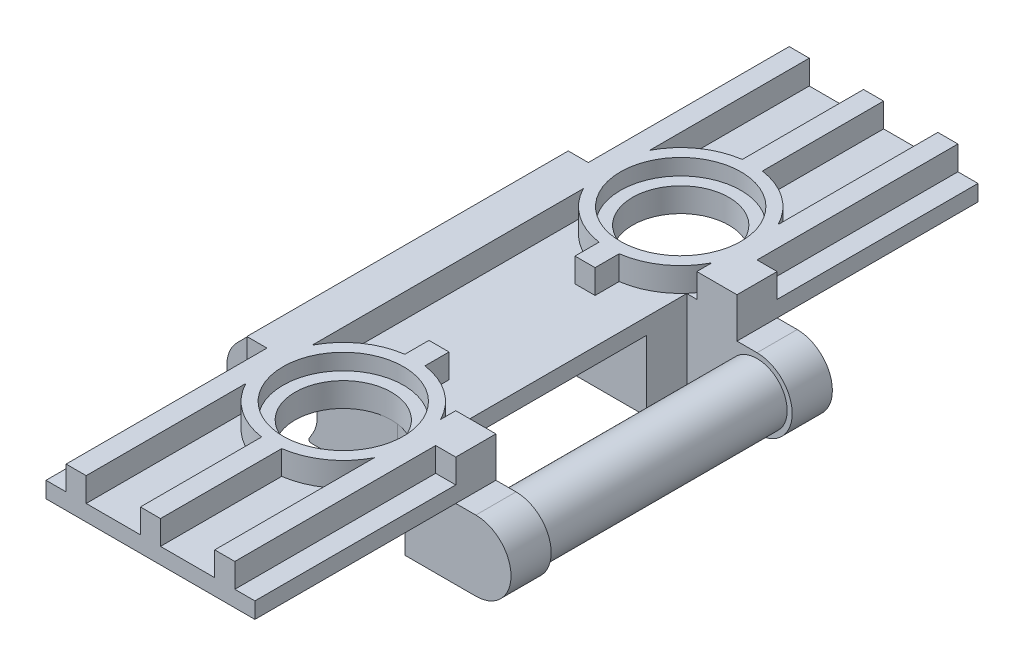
ISO-10303-21;
HEADER;
FILE_DESCRIPTION(('STEP AP214'),'2;1');
FILE_NAME('part.step','',(''),(''),'','','');
FILE_SCHEMA(('AUTOMOTIVE_DESIGN { 1 0 10303 214 1 1 1 1 }'));
ENDSEC;
DATA;
#1=APPLICATION_CONTEXT('core data for automotive mechanical design processes');
#2=APPLICATION_PROTOCOL_DEFINITION('international standard','automotive_design',2000,#1);
#3=PRODUCT_CONTEXT('',#1,'mechanical');
#4=PRODUCT('Part','Part','',(#3));
#5=PRODUCT_RELATED_PRODUCT_CATEGORY('part','',(#4));
#6=PRODUCT_DEFINITION_FORMATION('','',#4);
#7=PRODUCT_DEFINITION_CONTEXT('part definition',#1,'design');
#8=PRODUCT_DEFINITION('design','',#6,#7);
#9=PRODUCT_DEFINITION_SHAPE('','',#8);
#10=(LENGTH_UNIT() NAMED_UNIT(*) SI_UNIT(.MILLI.,.METRE.));
#11=(NAMED_UNIT(*) PLANE_ANGLE_UNIT() SI_UNIT($,.RADIAN.));
#12=(NAMED_UNIT(*) SI_UNIT($,.STERADIAN.) SOLID_ANGLE_UNIT());
#13=UNCERTAINTY_MEASURE_WITH_UNIT(LENGTH_MEASURE(1.E-05),#10,'distance_accuracy_value','');
#14=(GEOMETRIC_REPRESENTATION_CONTEXT(3) GLOBAL_UNCERTAINTY_ASSIGNED_CONTEXT((#13)) GLOBAL_UNIT_ASSIGNED_CONTEXT((#10,
#11,#12)) REPRESENTATION_CONTEXT('',''));
#15=CARTESIAN_POINT('',(0.,0.,0.));
#16=DIRECTION('',(0.,0.,1.));
#17=DIRECTION('',(1.,0.,0.));
#18=AXIS2_PLACEMENT_3D('',#15,#16,#17);
#19=CARTESIAN_POINT('',(-3.5,1.75,6.));
#20=DIRECTION('',(-1.,0.,0.));
#21=DIRECTION('',(0.,-1.,0.));
#22=AXIS2_PLACEMENT_3D('',#19,#20,#21);
#23=PLANE('',#22);
#24=DIRECTION('',(0.,0.,-1.));
#25=VECTOR('',#24,1.);
#26=CARTESIAN_POINT('',(-3.5,2.55,6.));
#27=LINE('',#26,#25);
#28=CARTESIAN_POINT('',(-3.5,2.55,6.));
#29=VERTEX_POINT('',#28);
#30=CARTESIAN_POINT('',(-3.5,2.55,-6.));
#31=VERTEX_POINT('',#30);
#32=EDGE_CURVE('E798',#29,#31,#27,.T.);
#33=ORIENTED_EDGE('',*,*,#32,.F.);
#34=DIRECTION('',(0.,1.,0.));
#35=VECTOR('',#34,1.);
#36=CARTESIAN_POINT('',(-3.5,1.75,6.));
#37=LINE('',#36,#35);
#38=CARTESIAN_POINT('',(-3.5,-1.75,6.));
#39=VERTEX_POINT('',#38);
#40=EDGE_CURVE('E1339',#39,#29,#37,.T.);
#41=ORIENTED_EDGE('',*,*,#40,.F.);
#42=DIRECTION('',(0.,0.,-1.));
#43=VECTOR('',#42,1.);
#44=CARTESIAN_POINT('',(-3.5,-1.75,6.));
#45=LINE('',#44,#43);
#46=CARTESIAN_POINT('',(-3.5,-1.75,4.));
#47=VERTEX_POINT('',#46);
#48=EDGE_CURVE('E1344',#39,#47,#45,.T.);
#49=ORIENTED_EDGE('',*,*,#48,.T.);
#50=DIRECTION('',(0.,1.,0.));
#51=VECTOR('',#50,1.);
#52=CARTESIAN_POINT('',(-3.5,1.75,4.));
#53=LINE('',#52,#51);
#54=CARTESIAN_POINT('',(-3.5,1.75,4.));
#55=VERTEX_POINT('',#54);
#56=EDGE_CURVE('E1333',#47,#55,#53,.T.);
#57=ORIENTED_EDGE('',*,*,#56,.T.);
#58=DIRECTION('',(0.,0.,-1.));
#59=VECTOR('',#58,1.);
#60=CARTESIAN_POINT('',(-3.5,1.75,-8.));
#61=LINE('',#60,#59);
#62=CARTESIAN_POINT('',(-3.5,1.75,-4.));
#63=VERTEX_POINT('',#62);
#64=EDGE_CURVE('E1204',#55,#63,#61,.T.);
#65=ORIENTED_EDGE('',*,*,#64,.T.);
#66=DIRECTION('',(0.,1.,0.));
#67=VECTOR('',#66,1.);
#68=CARTESIAN_POINT('',(-3.5,1.75,-4.));
#69=LINE('',#68,#67);
#70=CARTESIAN_POINT('',(-3.5,-1.75,-4.));
#71=VERTEX_POINT('',#70);
#72=EDGE_CURVE('E1056',#71,#63,#69,.T.);
#73=ORIENTED_EDGE('',*,*,#72,.F.);
#74=DIRECTION('',(0.,0.,1.));
#75=VECTOR('',#74,1.);
#76=CARTESIAN_POINT('',(-3.5,-1.75,-6.));
#77=LINE('',#76,#75);
#78=CARTESIAN_POINT('',(-3.5,-1.75,-6.));
#79=VERTEX_POINT('',#78);
#80=EDGE_CURVE('E1038',#79,#71,#77,.T.);
#81=ORIENTED_EDGE('',*,*,#80,.F.);
#82=DIRECTION('',(0.,1.,0.));
#83=VECTOR('',#82,1.);
#84=CARTESIAN_POINT('',(-3.5,1.75,-6.));
#85=LINE('',#84,#83);
#86=EDGE_CURVE('E1141',#79,#31,#85,.T.);
#87=ORIENTED_EDGE('',*,*,#86,.T.);
#88=EDGE_LOOP('',(#33,#41,#49,#57,#65,#73,#81,#87));
#89=FACE_BOUND('',#88,.T.);
#90=ADVANCED_FACE('F33',(#89),#23,.F.);
#91=CARTESIAN_POINT('',(-11.4,3.75,18.));
#92=DIRECTION('',(1.,0.,0.));
#93=DIRECTION('',(0.,1.,0.));
#94=AXIS2_PLACEMENT_3D('',#91,#92,#93);
#95=PLANE('',#94);
#96=DIRECTION('',(0.,0.,-1.));
#97=VECTOR('',#96,1.);
#98=CARTESIAN_POINT('',(-11.4,3.75,18.));
#99=LINE('',#98,#97);
#100=CARTESIAN_POINT('',(-11.4,3.75,-6.));
#101=VERTEX_POINT('',#100);
#102=CARTESIAN_POINT('',(-11.4,3.75,-8.));
#103=VERTEX_POINT('',#102);
#104=EDGE_CURVE('E1297',#101,#103,#99,.T.);
#105=ORIENTED_EDGE('',*,*,#104,.T.);
#106=DIRECTION('',(0.,1.,0.));
#107=VECTOR('',#106,1.);
#108=CARTESIAN_POINT('',(-11.4,2.55,-8.));
#109=LINE('',#108,#107);
#110=CARTESIAN_POINT('',(-11.4,2.55,-8.));
#111=VERTEX_POINT('',#110);
#112=EDGE_CURVE('E709',#111,#103,#109,.T.);
#113=ORIENTED_EDGE('',*,*,#112,.F.);
#114=DIRECTION('',(0.,0.,1.));
#115=VECTOR('',#114,1.);
#116=CARTESIAN_POINT('',(-11.4,2.55,-8.));
#117=LINE('',#116,#115);
#118=CARTESIAN_POINT('',(-11.4,2.55,-18.));
#119=VERTEX_POINT('',#118);
#120=EDGE_CURVE('E698',#119,#111,#117,.T.);
#121=ORIENTED_EDGE('',*,*,#120,.F.);
#122=DIRECTION('',(0.,-1.,0.));
#123=VECTOR('',#122,1.);
#124=CARTESIAN_POINT('',(-11.4,3.75,-18.));
#125=LINE('',#124,#123);
#126=CARTESIAN_POINT('',(-11.4,1.75,-18.));
#127=VERTEX_POINT('',#126);
#128=EDGE_CURVE('E1274',#119,#127,#125,.T.);
#129=ORIENTED_EDGE('',*,*,#128,.T.);
#130=DIRECTION('',(0.,0.,-1.));
#131=VECTOR('',#130,1.);
#132=CARTESIAN_POINT('',(-11.4,1.75,18.));
#133=LINE('',#132,#131);
#134=CARTESIAN_POINT('',(-11.4,1.75,-6.));
#135=VERTEX_POINT('',#134);
#136=EDGE_CURVE('E1284',#135,#127,#133,.T.);
#137=ORIENTED_EDGE('',*,*,#136,.F.);
#138=DIRECTION('',(0.,1.,0.));
#139=VECTOR('',#138,1.);
#140=CARTESIAN_POINT('',(-11.4,3.75,-6.));
#141=LINE('',#140,#139);
#142=EDGE_CURVE('E1084',#135,#101,#141,.T.);
#143=ORIENTED_EDGE('',*,*,#142,.T.);
#144=EDGE_LOOP('',(#105,#113,#121,#129,#137,#143));
#145=FACE_BOUND('',#144,.T.);
#146=ADVANCED_FACE('F1428',(#145),#95,.F.);
#147=CARTESIAN_POINT('',(-11.4,1.75,18.));
#148=DIRECTION('',(0.,1.,0.));
#149=DIRECTION('',(0.,0.,1.));
#150=AXIS2_PLACEMENT_3D('',#147,#148,#149);
#151=PLANE('',#150);
#152=DIRECTION('',(1.,0.,0.));
#153=VECTOR('',#152,1.);
#154=CARTESIAN_POINT('',(-11.4,1.75,-6.));
#155=LINE('',#154,#153);
#156=CARTESIAN_POINT('',(-6.2,1.75,-6.));
#157=VERTEX_POINT('',#156);
#158=CARTESIAN_POINT('',(-5.9,1.75,-6.));
#159=VERTEX_POINT('',#158);
#160=EDGE_CURVE('E1200',#157,#159,#155,.T.);
#161=ORIENTED_EDGE('',*,*,#160,.F.);
#162=CARTESIAN_POINT('',(-6.2,1.75,-8.4));
#163=DIRECTION('',(0.,1.,0.));
#164=DIRECTION('',(0.,0.,1.));
#165=AXIS2_PLACEMENT_3D('',#162,#163,#164);
#166=CIRCLE('',#165,2.4);
#167=EDGE_CURVE('E974',#157,#157,#166,.F.);
#168=ORIENTED_EDGE('',*,*,#167,.F.);
#169=EDGE_CURVE('E1205',#135,#157,#155,.T.);
#170=ORIENTED_EDGE('',*,*,#169,.F.);
#171=ORIENTED_EDGE('',*,*,#136,.T.);
#172=DIRECTION('',(1.,0.,0.));
#173=VECTOR('',#172,1.);
#174=CARTESIAN_POINT('',(-11.4,1.75,-18.));
#175=LINE('',#174,#173);
#176=CARTESIAN_POINT('',(-1.,1.75,-18.));
#177=VERTEX_POINT('',#176);
#178=EDGE_CURVE('E1269',#127,#177,#175,.T.);
#179=ORIENTED_EDGE('',*,*,#178,.T.);
#180=DIRECTION('',(0.,0.,-1.));
#181=VECTOR('',#180,1.);
#182=CARTESIAN_POINT('',(-1.,1.75,18.));
#183=LINE('',#182,#181);
#184=CARTESIAN_POINT('',(-1.,1.75,-8.));
#185=VERTEX_POINT('',#184);
#186=EDGE_CURVE('E1304',#185,#177,#183,.T.);
#187=ORIENTED_EDGE('',*,*,#186,.F.);
#188=DIRECTION('',(-1.,0.,0.));
#189=VECTOR('',#188,1.);
#190=CARTESIAN_POINT('',(0.,1.75,-8.));
#191=LINE('',#190,#189);
#192=CARTESIAN_POINT('',(-2.3,1.75,-8.));
#193=VERTEX_POINT('',#192);
#194=EDGE_CURVE('E995',#185,#193,#191,.T.);
#195=ORIENTED_EDGE('',*,*,#194,.T.);
#196=DIRECTION('',(0.,0.,-1.));
#197=VECTOR('',#196,1.);
#198=CARTESIAN_POINT('',(-2.3,1.75,-9.86602540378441));
#199=LINE('',#198,#197);
#200=CARTESIAN_POINT('',(-2.3,1.75,-9.86602540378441));
#201=VERTEX_POINT('',#200);
#202=EDGE_CURVE('E1125',#193,#201,#199,.T.);
#203=ORIENTED_EDGE('',*,*,#202,.T.);
#204=DIRECTION('',(-1.,0.,0.));
#205=VECTOR('',#204,1.);
#206=CARTESIAN_POINT('',(-2.3,1.75,-9.86602540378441));
#207=LINE('',#206,#205);
#208=CARTESIAN_POINT('',(-3.5,1.75,-9.86602540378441));
#209=VERTEX_POINT('',#208);
#210=EDGE_CURVE('E1132',#201,#209,#207,.T.);
#211=ORIENTED_EDGE('',*,*,#210,.T.);
#212=DIRECTION('',(0.,0.,-1.));
#213=VECTOR('',#212,1.);
#214=CARTESIAN_POINT('',(-3.5,1.75,-9.86602540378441));
#215=LINE('',#214,#213);
#216=CARTESIAN_POINT('',(-3.5,1.75,-8.));
#217=VERTEX_POINT('',#216);
#218=EDGE_CURVE('E1130',#217,#209,#215,.T.);
#219=ORIENTED_EDGE('',*,*,#218,.F.);
#220=CARTESIAN_POINT('',(-3.53356808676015,1.75,-8.));
#221=VERTEX_POINT('',#220);
#222=EDGE_CURVE('E999',#217,#221,#191,.T.);
#223=ORIENTED_EDGE('',*,*,#222,.T.);
#224=CARTESIAN_POINT('',(-5.9,1.75,-8.4));
#225=DIRECTION('',(0.,-1.,0.));
#226=DIRECTION('',(-1.,0.,0.));
#227=AXIS2_PLACEMENT_3D('',#224,#225,#226);
#228=CIRCLE('',#227,2.4);
#229=EDGE_CURVE('E1120',#221,#159,#228,.T.);
#230=ORIENTED_EDGE('',*,*,#229,.T.);
#231=EDGE_LOOP('',(#161,#168,#170,#171,#179,#187,#195,#203,#211,#219,#223,#230));
#232=FACE_BOUND('',#231,.T.);
#233=ADVANCED_FACE('F1406',(#232),#151,.F.);
#234=DIRECTION('',(0.,0.,1.));
#235=VECTOR('',#234,1.);
#236=CARTESIAN_POINT('',(-13.1403060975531,1.75,-8.));
#237=LINE('',#236,#235);
#238=CARTESIAN_POINT('',(-13.1403060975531,1.75,5.8));
#239=VERTEX_POINT('',#238);
#240=CARTESIAN_POINT('',(-13.1403060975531,1.75,-5.8));
#241=VERTEX_POINT('',#240);
#242=EDGE_CURVE('E1530',#239,#241,#237,.F.);
#243=ORIENTED_EDGE('',*,*,#242,.T.);
#244=DIRECTION('',(1.,0.,0.));
#245=VECTOR('',#244,1.);
#246=CARTESIAN_POINT('',(0.,1.75,-5.8));
#247=LINE('',#246,#245);
#248=CARTESIAN_POINT('',(-12.65,1.75,-5.8));
#249=VERTEX_POINT('',#248);
#250=EDGE_CURVE('E1152',#241,#249,#247,.T.);
#251=ORIENTED_EDGE('',*,*,#250,.T.);
#252=DIRECTION('',(0.,0.,-1.));
#253=VECTOR('',#252,1.);
#254=CARTESIAN_POINT('',(-12.65,1.75,-4.));
#255=LINE('',#254,#253);
#256=CARTESIAN_POINT('',(-12.65,1.75,-4.));
#257=VERTEX_POINT('',#256);
#258=EDGE_CURVE('E1079',#257,#249,#255,.T.);
#259=ORIENTED_EDGE('',*,*,#258,.F.);
#260=DIRECTION('',(-1.,0.,0.));
#261=VECTOR('',#260,1.);
#262=CARTESIAN_POINT('',(0.,1.75,-4.));
#263=LINE('',#262,#261);
#264=EDGE_CURVE('E1053',#63,#257,#263,.T.);
#265=ORIENTED_EDGE('',*,*,#264,.F.);
#266=ORIENTED_EDGE('',*,*,#64,.F.);
#267=DIRECTION('',(-1.,0.,0.));
#268=VECTOR('',#267,1.);
#269=CARTESIAN_POINT('',(0.,1.75,4.));
#270=LINE('',#269,#268);
#271=CARTESIAN_POINT('',(-12.65,1.75,4.));
#272=VERTEX_POINT('',#271);
#273=EDGE_CURVE('E1350',#55,#272,#270,.T.);
#274=ORIENTED_EDGE('',*,*,#273,.T.);
#275=DIRECTION('',(0.,0.,1.));
#276=VECTOR('',#275,1.);
#277=CARTESIAN_POINT('',(-12.65,1.75,4.));
#278=LINE('',#277,#276);
#279=CARTESIAN_POINT('',(-12.65,1.75,5.8));
#280=VERTEX_POINT('',#279);
#281=EDGE_CURVE('E1369',#272,#280,#278,.T.);
#282=ORIENTED_EDGE('',*,*,#281,.T.);
#283=DIRECTION('',(1.,0.,0.));
#284=VECTOR('',#283,1.);
#285=CARTESIAN_POINT('',(0.,1.75,5.8));
#286=LINE('',#285,#284);
#287=EDGE_CURVE('E1662',#239,#280,#286,.T.);
#288=ORIENTED_EDGE('',*,*,#287,.F.);
#289=EDGE_LOOP('',(#243,#251,#259,#265,#266,#274,#282,#288));
#290=FACE_BOUND('',#289,.T.);
#291=ADVANCED_FACE('F1654',(#290),#151,.F.);
#292=CARTESIAN_POINT('',(-11.4,3.75,5.8));
#293=VERTEX_POINT('',#292);
#294=CARTESIAN_POINT('',(-11.4,3.75,-5.8));
#295=VERTEX_POINT('',#294);
#296=EDGE_CURVE('E1301',#293,#295,#99,.T.);
#297=ORIENTED_EDGE('',*,*,#296,.T.);
#298=DIRECTION('',(0.,1.,0.));
#299=VECTOR('',#298,1.);
#300=CARTESIAN_POINT('',(-11.4,3.75,-5.8));
#301=LINE('',#300,#299);
#302=CARTESIAN_POINT('',(-11.4,2.25,-5.8));
#303=VERTEX_POINT('',#302);
#304=EDGE_CURVE('E1150',#303,#295,#301,.T.);
#305=ORIENTED_EDGE('',*,*,#304,.F.);
#306=DIRECTION('',(0.,0.,-1.));
#307=VECTOR('',#306,1.);
#308=CARTESIAN_POINT('',(-11.4,2.25,5.8));
#309=LINE('',#308,#307);
#310=CARTESIAN_POINT('',(-11.4,2.25,5.8));
#311=VERTEX_POINT('',#310);
#312=EDGE_CURVE('E1201',#311,#303,#309,.T.);
#313=ORIENTED_EDGE('',*,*,#312,.F.);
#314=DIRECTION('',(0.,1.,0.));
#315=VECTOR('',#314,1.);
#316=CARTESIAN_POINT('',(-11.4,3.75,5.8));
#317=LINE('',#316,#315);
#318=EDGE_CURVE('E1234',#311,#293,#317,.T.);
#319=ORIENTED_EDGE('',*,*,#318,.T.);
#320=EDGE_LOOP('',(#297,#305,#313,#319));
#321=FACE_BOUND('',#320,.T.);
#322=ADVANCED_FACE('F1437',(#321),#95,.F.);
#323=CARTESIAN_POINT('',(0.,0.,5.8));
#324=DIRECTION('',(0.,0.,-1.));
#325=DIRECTION('',(-1.,0.,0.));
#326=AXIS2_PLACEMENT_3D('',#323,#324,#325);
#327=PLANE('',#326);
#328=DIRECTION('',(-0.703548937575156,-0.71064681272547,0.));
#329=VECTOR('',#328,1.);
#330=CARTESIAN_POINT('',(-13.8936319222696,1.23121064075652,5.8));
#331=LINE('',#330,#329);
#332=CARTESIAN_POINT('',(-13.2113707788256,1.92035489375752,5.8));
#333=VERTEX_POINT('',#332);
#334=CARTESIAN_POINT('',(-13.8936319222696,1.23121064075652,5.8));
#335=VERTEX_POINT('',#334);
#336=EDGE_CURVE('E1236',#333,#335,#331,.T.);
#337=ORIENTED_EDGE('',*,*,#336,.F.);
#338=CARTESIAN_POINT('',(-13.1403060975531,1.85,5.8));
#339=DIRECTION('',(0.,0.,-1.));
#340=DIRECTION('',(-1.,0.,0.));
#341=AXIS2_PLACEMENT_3D('',#338,#339,#340);
#342=CIRCLE('',#341,0.1);
#343=EDGE_CURVE('E1393',#333,#239,#342,.F.);
#344=ORIENTED_EDGE('',*,*,#343,.T.);
#345=ORIENTED_EDGE('',*,*,#287,.T.);
#346=CARTESIAN_POINT('',(-12.65,0.,5.8));
#347=DIRECTION('',(0.,0.,-1.));
#348=DIRECTION('',(-1.,0.,0.));
#349=AXIS2_PLACEMENT_3D('',#346,#347,#348);
#350=CIRCLE('',#349,1.75);
#351=EDGE_CURVE('E1247',#280,#335,#350,.F.);
#352=ORIENTED_EDGE('',*,*,#351,.T.);
#353=EDGE_LOOP('',(#337,#344,#345,#352));
#354=FACE_BOUND('',#353,.T.);
#355=ADVANCED_FACE('F1661',(#354),#327,.T.);
#356=CARTESIAN_POINT('',(-1.,1.75,18.));
#357=DIRECTION('',(-1.,0.,0.));
#358=DIRECTION('',(0.,0.,1.));
#359=AXIS2_PLACEMENT_3D('',#356,#357,#358);
#360=PLANE('',#359);
#361=DIRECTION('',(0.,0.,-1.));
#362=VECTOR('',#361,1.);
#363=CARTESIAN_POINT('',(-1.,3.75,18.));
#364=LINE('',#363,#362);
#365=CARTESIAN_POINT('',(-1.,3.75,8.));
#366=VERTEX_POINT('',#365);
#367=CARTESIAN_POINT('',(-1.,3.75,6.));
#368=VERTEX_POINT('',#367);
#369=EDGE_CURVE('E1302',#366,#368,#364,.T.);
#370=ORIENTED_EDGE('',*,*,#369,.F.);
#371=DIRECTION('',(0.,1.,0.));
#372=VECTOR('',#371,1.);
#373=CARTESIAN_POINT('',(-1.,2.55,8.));
#374=LINE('',#373,#372);
#375=CARTESIAN_POINT('',(-1.,2.55,8.));
#376=VERTEX_POINT('',#375);
#377=EDGE_CURVE('E900',#376,#366,#374,.T.);
#378=ORIENTED_EDGE('',*,*,#377,.F.);
#379=DIRECTION('',(0.,0.,-1.));
#380=VECTOR('',#379,1.);
#381=CARTESIAN_POINT('',(-1.,2.55,8.));
#382=LINE('',#381,#380);
#383=CARTESIAN_POINT('',(-1.,2.55,18.));
#384=VERTEX_POINT('',#383);
#385=EDGE_CURVE('E891',#384,#376,#382,.T.);
#386=ORIENTED_EDGE('',*,*,#385,.F.);
#387=DIRECTION('',(0.,1.,0.));
#388=VECTOR('',#387,1.);
#389=CARTESIAN_POINT('',(-1.,1.75,18.));
#390=LINE('',#389,#388);
#391=CARTESIAN_POINT('',(-1.,1.75,18.));
#392=VERTEX_POINT('',#391);
#393=EDGE_CURVE('E1273',#392,#384,#390,.T.);
#394=ORIENTED_EDGE('',*,*,#393,.F.);
#395=CARTESIAN_POINT('',(-1.,1.75,8.));
#396=VERTEX_POINT('',#395);
#397=EDGE_CURVE('E1305',#392,#396,#183,.T.);
#398=ORIENTED_EDGE('',*,*,#397,.T.);
#399=CARTESIAN_POINT('',(-1.,1.75,6.));
#400=VERTEX_POINT('',#399);
#401=EDGE_CURVE('E1309',#396,#400,#183,.T.);
#402=ORIENTED_EDGE('',*,*,#401,.T.);
#403=DIRECTION('',(0.,-1.,0.));
#404=VECTOR('',#403,1.);
#405=CARTESIAN_POINT('',(-1.,3.75,6.));
#406=LINE('',#405,#404);
#407=EDGE_CURVE('E1209',#368,#400,#406,.T.);
#408=ORIENTED_EDGE('',*,*,#407,.F.);
#409=EDGE_LOOP('',(#370,#378,#386,#394,#398,#402,#408));
#410=FACE_BOUND('',#409,.T.);
#411=ADVANCED_FACE('F1467',(#410),#360,.F.);
#412=CARTESIAN_POINT('',(0.,0.,8.));
#413=DIRECTION('',(0.,0.,1.));
#414=DIRECTION('',(1.,0.,0.));
#415=AXIS2_PLACEMENT_3D('',#412,#413,#414);
#416=PLANE('',#415);
#417=DIRECTION('',(-1.,0.,0.));
#418=VECTOR('',#417,1.);
#419=CARTESIAN_POINT('',(0.,1.75,8.));
#420=LINE('',#419,#418);
#421=CARTESIAN_POINT('',(-2.3,1.75,8.));
#422=VERTEX_POINT('',#421);
#423=EDGE_CURVE('E1310',#396,#422,#420,.T.);
#424=ORIENTED_EDGE('',*,*,#423,.T.);
#425=DIRECTION('',(0.,1.,0.));
#426=VECTOR('',#425,1.);
#427=CARTESIAN_POINT('',(-2.3,1.75,8.));
#428=LINE('',#427,#426);
#429=CARTESIAN_POINT('',(-2.3,1.25,8.));
#430=VERTEX_POINT('',#429);
#431=EDGE_CURVE('E1220',#430,#422,#428,.T.);
#432=ORIENTED_EDGE('',*,*,#431,.F.);
#433=DIRECTION('',(-1.,0.,0.));
#434=VECTOR('',#433,1.);
#435=CARTESIAN_POINT('',(-2.3,1.25,8.));
#436=LINE('',#435,#434);
#437=CARTESIAN_POINT('',(-3.5,1.25,8.));
#438=VERTEX_POINT('',#437);
#439=EDGE_CURVE('E1222',#430,#438,#436,.T.);
#440=ORIENTED_EDGE('',*,*,#439,.T.);
#441=DIRECTION('',(0.,1.,0.));
#442=VECTOR('',#441,1.);
#443=CARTESIAN_POINT('',(-3.5,1.75,8.));
#444=LINE('',#443,#442);
#445=CARTESIAN_POINT('',(-3.5,1.75,8.));
#446=VERTEX_POINT('',#445);
#447=EDGE_CURVE('E1218',#438,#446,#444,.T.);
#448=ORIENTED_EDGE('',*,*,#447,.T.);
#449=CARTESIAN_POINT('',(-3.53356808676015,1.75,8.));
#450=VERTEX_POINT('',#449);
#451=EDGE_CURVE('E1308',#446,#450,#420,.T.);
#452=ORIENTED_EDGE('',*,*,#451,.T.);
#453=DIRECTION('',(0.,1.,0.));
#454=VECTOR('',#453,1.);
#455=CARTESIAN_POINT('',(-3.53356808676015,-1.75,8.));
#456=LINE('',#455,#454);
#457=CARTESIAN_POINT('',(-3.53356808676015,-1.75,8.));
#458=VERTEX_POINT('',#457);
#459=EDGE_CURVE('E1368',#458,#450,#456,.T.);
#460=ORIENTED_EDGE('',*,*,#459,.F.);
#461=DIRECTION('',(1.,0.,0.));
#462=VECTOR('',#461,1.);
#463=CARTESIAN_POINT('',(-12.65,-1.75,8.));
#464=LINE('',#463,#462);
#465=CARTESIAN_POINT('',(0.,-1.75,8.));
#466=VERTEX_POINT('',#465);
#467=EDGE_CURVE('E1353',#458,#466,#464,.T.);
#468=ORIENTED_EDGE('',*,*,#467,.T.);
#469=CARTESIAN_POINT('',(0.,0.,8.));
#470=DIRECTION('',(0.,0.,1.));
#471=DIRECTION('',(1.,0.,0.));
#472=AXIS2_PLACEMENT_3D('',#469,#470,#471);
#473=CIRCLE('',#472,1.75);
#474=CARTESIAN_POINT('',(0.,1.75,8.));
#475=VERTEX_POINT('',#474);
#476=EDGE_CURVE('E1349',#466,#475,#473,.T.);
#477=ORIENTED_EDGE('',*,*,#476,.T.);
#478=DIRECTION('',(-1.,0.,0.));
#479=VECTOR('',#478,1.);
#480=CARTESIAN_POINT('',(0.,1.75,8.));
#481=LINE('',#480,#479);
#482=EDGE_CURVE('E1361',#475,#396,#481,.T.);
#483=ORIENTED_EDGE('',*,*,#482,.T.);
#484=EDGE_LOOP('',(#424,#432,#440,#448,#452,#460,#468,#477,#483));
#485=FACE_BOUND('',#484,.T.);
#486=ADVANCED_FACE('F1464',(#485),#416,.T.);
#487=DIRECTION('',(-1.,0.,0.));
#488=VECTOR('',#487,1.);
#489=CARTESIAN_POINT('',(0.,1.75,6.));
#490=LINE('',#489,#488);
#491=CARTESIAN_POINT('',(-6.2,1.75,6.));
#492=VERTEX_POINT('',#491);
#493=CARTESIAN_POINT('',(-11.4,1.75,6.));
#494=VERTEX_POINT('',#493);
#495=EDGE_CURVE('E1375',#492,#494,#490,.T.);
#496=ORIENTED_EDGE('',*,*,#495,.F.);
#497=CARTESIAN_POINT('',(-6.2,1.75,8.4));
#498=DIRECTION('',(0.,1.,0.));
#499=DIRECTION('',(0.,0.,1.));
#500=AXIS2_PLACEMENT_3D('',#497,#498,#499);
#501=CIRCLE('',#500,2.4);
#502=EDGE_CURVE('E983',#492,#492,#501,.T.);
#503=ORIENTED_EDGE('',*,*,#502,.T.);
#504=CARTESIAN_POINT('',(-5.9,1.75,6.));
#505=VERTEX_POINT('',#504);
#506=EDGE_CURVE('E1376',#505,#492,#490,.T.);
#507=ORIENTED_EDGE('',*,*,#506,.F.);
#508=CARTESIAN_POINT('',(-5.9,1.75,8.4));
#509=DIRECTION('',(0.,1.,0.));
#510=DIRECTION('',(-1.,0.,0.));
#511=AXIS2_PLACEMENT_3D('',#508,#509,#510);
#512=CIRCLE('',#511,2.4);
#513=EDGE_CURVE('E1321',#450,#505,#512,.T.);
#514=ORIENTED_EDGE('',*,*,#513,.F.);
#515=ORIENTED_EDGE('',*,*,#451,.F.);
#516=DIRECTION('',(0.,0.,1.));
#517=VECTOR('',#516,1.);
#518=CARTESIAN_POINT('',(-3.5,1.75,9.86602540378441));
#519=LINE('',#518,#517);
#520=CARTESIAN_POINT('',(-3.5,1.75,9.86602540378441));
#521=VERTEX_POINT('',#520);
#522=EDGE_CURVE('E1213',#446,#521,#519,.T.);
#523=ORIENTED_EDGE('',*,*,#522,.T.);
#524=DIRECTION('',(-1.,0.,0.));
#525=VECTOR('',#524,1.);
#526=CARTESIAN_POINT('',(-2.3,1.75,9.86602540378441));
#527=LINE('',#526,#525);
#528=CARTESIAN_POINT('',(-2.3,1.75,9.86602540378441));
#529=VERTEX_POINT('',#528);
#530=EDGE_CURVE('E1231',#529,#521,#527,.T.);
#531=ORIENTED_EDGE('',*,*,#530,.F.);
#532=DIRECTION('',(0.,0.,1.));
#533=VECTOR('',#532,1.);
#534=CARTESIAN_POINT('',(-2.3,1.75,9.86602540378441));
#535=LINE('',#534,#533);
#536=EDGE_CURVE('E1214',#422,#529,#535,.T.);
#537=ORIENTED_EDGE('',*,*,#536,.F.);
#538=ORIENTED_EDGE('',*,*,#423,.F.);
#539=ORIENTED_EDGE('',*,*,#397,.F.);
#540=DIRECTION('',(1.,0.,0.));
#541=VECTOR('',#540,1.);
#542=CARTESIAN_POINT('',(-11.4,1.75,18.));
#543=LINE('',#542,#541);
#544=CARTESIAN_POINT('',(-11.4,1.75,18.));
#545=VERTEX_POINT('',#544);
#546=EDGE_CURVE('E1270',#545,#392,#543,.T.);
#547=ORIENTED_EDGE('',*,*,#546,.F.);
#548=EDGE_CURVE('E1294',#545,#494,#133,.T.);
#549=ORIENTED_EDGE('',*,*,#548,.T.);
#550=EDGE_LOOP('',(#496,#503,#507,#514,#515,#523,#531,#537,#538,#539,#547,#549));
#551=FACE_BOUND('',#550,.T.);
#552=ADVANCED_FACE('F1455',(#551),#151,.F.);
#553=CARTESIAN_POINT('',(-12.65,0.,4.));
#554=DIRECTION('',(0.,0.,1.));
#555=DIRECTION('',(1.,0.,0.));
#556=AXIS2_PLACEMENT_3D('',#553,#554,#555);
#557=CYLINDRICAL_SURFACE('',#556,1.75);
#558=CARTESIAN_POINT('',(-12.65,0.,6.));
#559=DIRECTION('',(0.,0.,-1.));
#560=DIRECTION('',(-1.,0.,0.));
#561=AXIS2_PLACEMENT_3D('',#558,#559,#560);
#562=CIRCLE('',#561,1.75);
#563=CARTESIAN_POINT('',(-13.8936319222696,1.23121064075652,6.));
#564=VERTEX_POINT('',#563);
#565=CARTESIAN_POINT('',(-14.05,-1.05,6.));
#566=VERTEX_POINT('',#565);
#567=EDGE_CURVE('E1326',#564,#566,#562,.F.);
#568=ORIENTED_EDGE('',*,*,#567,.F.);
#569=DIRECTION('',(0.,0.,1.));
#570=VECTOR('',#569,1.);
#571=CARTESIAN_POINT('',(-13.8936319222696,1.23121064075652,5.8));
#572=LINE('',#571,#570);
#573=EDGE_CURVE('E1244',#335,#564,#572,.T.);
#574=ORIENTED_EDGE('',*,*,#573,.F.);
#575=ORIENTED_EDGE('',*,*,#351,.F.);
#576=ORIENTED_EDGE('',*,*,#281,.F.);
#577=CARTESIAN_POINT('',(-12.65,0.,4.));
#578=DIRECTION('',(0.,0.,1.));
#579=DIRECTION('',(1.,0.,0.));
#580=AXIS2_PLACEMENT_3D('',#577,#578,#579);
#581=CIRCLE('',#580,1.75);
#582=CARTESIAN_POINT('',(-14.05,-1.05,4.));
#583=VERTEX_POINT('',#582);
#584=EDGE_CURVE('E1352',#272,#583,#581,.T.);
#585=ORIENTED_EDGE('',*,*,#584,.T.);
#586=DIRECTION('',(0.,0.,1.));
#587=VECTOR('',#586,1.);
#588=CARTESIAN_POINT('',(-14.05,-1.05,4.));
#589=LINE('',#588,#587);
#590=EDGE_CURVE('E1681',#583,#566,#589,.T.);
#591=ORIENTED_EDGE('',*,*,#590,.T.);
#592=EDGE_LOOP('',(#568,#574,#575,#576,#585,#591));
#593=FACE_BOUND('',#592,.T.);
#594=ADVANCED_FACE('F1452',(#593),#557,.T.);
#595=DIRECTION('',(0.,0.,1.));
#596=VECTOR('',#595,1.);
#597=CARTESIAN_POINT('',(-11.4,2.55,8.));
#598=LINE('',#597,#596);
#599=CARTESIAN_POINT('',(-11.4,2.55,8.));
#600=VERTEX_POINT('',#599);
#601=CARTESIAN_POINT('',(-11.4,2.55,18.));
#602=VERTEX_POINT('',#601);
#603=EDGE_CURVE('E850',#600,#602,#598,.T.);
#604=ORIENTED_EDGE('',*,*,#603,.F.);
#605=DIRECTION('',(0.,1.,0.));
#606=VECTOR('',#605,1.);
#607=CARTESIAN_POINT('',(-11.4,2.55,8.));
#608=LINE('',#607,#606);
#609=CARTESIAN_POINT('',(-11.4,3.75,8.));
#610=VERTEX_POINT('',#609);
#611=EDGE_CURVE('E862',#600,#610,#608,.T.);
#612=ORIENTED_EDGE('',*,*,#611,.T.);
#613=CARTESIAN_POINT('',(-11.4,3.75,6.));
#614=VERTEX_POINT('',#613);
#615=EDGE_CURVE('E1298',#610,#614,#99,.T.);
#616=ORIENTED_EDGE('',*,*,#615,.T.);
#617=DIRECTION('',(0.,1.,0.));
#618=VECTOR('',#617,1.);
#619=CARTESIAN_POINT('',(-11.4,3.75,6.));
#620=LINE('',#619,#618);
#621=EDGE_CURVE('E1233',#494,#614,#620,.T.);
#622=ORIENTED_EDGE('',*,*,#621,.F.);
#623=ORIENTED_EDGE('',*,*,#548,.F.);
#624=DIRECTION('',(0.,-1.,0.));
#625=VECTOR('',#624,1.);
#626=CARTESIAN_POINT('',(-11.4,3.75,18.));
#627=LINE('',#626,#625);
#628=EDGE_CURVE('E1282',#602,#545,#627,.T.);
#629=ORIENTED_EDGE('',*,*,#628,.F.);
#630=EDGE_LOOP('',(#604,#612,#616,#622,#623,#629));
#631=FACE_BOUND('',#630,.T.);
#632=ADVANCED_FACE('F1436',(#631),#95,.F.);
#633=CARTESIAN_POINT('',(0.,1.75,4.));
#634=DIRECTION('',(0.,1.,0.));
#635=DIRECTION('',(-1.,0.,0.));
#636=AXIS2_PLACEMENT_3D('',#633,#634,#635);
#637=PLANE('',#636);
#638=DIRECTION('',(1.,0.,0.));
#639=VECTOR('',#638,1.);
#640=CARTESIAN_POINT('',(0.,1.75,6.));
#641=LINE('',#640,#639);
#642=CARTESIAN_POINT('',(0.,1.75,6.));
#643=VERTEX_POINT('',#642);
#644=EDGE_CURVE('E1342',#400,#643,#641,.T.);
#645=ORIENTED_EDGE('',*,*,#644,.F.);
#646=ORIENTED_EDGE('',*,*,#401,.F.);
#647=ORIENTED_EDGE('',*,*,#482,.F.);
#648=DIRECTION('',(0.,0.,1.));
#649=VECTOR('',#648,1.);
#650=CARTESIAN_POINT('',(0.,1.75,4.));
#651=LINE('',#650,#649);
#652=EDGE_CURVE('E1358',#643,#475,#651,.T.);
#653=ORIENTED_EDGE('',*,*,#652,.F.);
#654=EDGE_LOOP('',(#645,#646,#647,#653));
#655=FACE_BOUND('',#654,.T.);
#656=ADVANCED_FACE('F1457',(#655),#637,.T.);
#657=CARTESIAN_POINT('',(0.,0.,4.));
#658=DIRECTION('',(0.,0.,1.));
#659=DIRECTION('',(1.,0.,0.));
#660=AXIS2_PLACEMENT_3D('',#657,#658,#659);
#661=CYLINDRICAL_SURFACE('',#660,1.75);
#662=DIRECTION('',(0.,0.,1.));
#663=VECTOR('',#662,1.);
#664=CARTESIAN_POINT('',(0.,-1.75,4.));
#665=LINE('',#664,#663);
#666=CARTESIAN_POINT('',(0.,-1.75,6.));
#667=VERTEX_POINT('',#666);
#668=EDGE_CURVE('E1365',#667,#466,#665,.T.);
#669=ORIENTED_EDGE('',*,*,#668,.F.);
#670=CARTESIAN_POINT('',(0.,0.,6.));
#671=DIRECTION('',(0.,0.,-1.));
#672=DIRECTION('',(-1.,0.,0.));
#673=AXIS2_PLACEMENT_3D('',#670,#671,#672);
#674=CIRCLE('',#673,1.75);
#675=EDGE_CURVE('E1334',#643,#667,#674,.T.);
#676=ORIENTED_EDGE('',*,*,#675,.F.);
#677=ORIENTED_EDGE('',*,*,#652,.T.);
#678=ORIENTED_EDGE('',*,*,#476,.F.);
#679=EDGE_LOOP('',(#669,#676,#677,#678));
#680=FACE_BOUND('',#679,.T.);
#681=ADVANCED_FACE('F1450',(#680),#661,.T.);
#682=CARTESIAN_POINT('',(-12.65,-1.75,4.));
#683=DIRECTION('',(0.,-1.,0.));
#684=DIRECTION('',(1.,0.,0.));
#685=AXIS2_PLACEMENT_3D('',#682,#683,#684);
#686=PLANE('',#685);
#687=DIRECTION('',(-1.,0.,0.));
#688=VECTOR('',#687,1.);
#689=CARTESIAN_POINT('',(-14.4,-1.75,6.));
#690=LINE('',#689,#688);
#691=CARTESIAN_POINT('',(-5.9,-1.75,6.));
#692=VERTEX_POINT('',#691);
#693=CARTESIAN_POINT('',(-9.175,-1.75,6.));
#694=VERTEX_POINT('',#693);
#695=EDGE_CURVE('E1316',#692,#694,#690,.T.);
#696=ORIENTED_EDGE('',*,*,#695,.T.);
#697=DIRECTION('',(0.,0.,1.));
#698=VECTOR('',#697,1.);
#699=CARTESIAN_POINT('',(-9.175,-1.75,4.));
#700=LINE('',#699,#698);
#701=CARTESIAN_POINT('',(-9.175,-1.75,4.));
#702=VERTEX_POINT('',#701);
#703=EDGE_CURVE('E1699',#694,#702,#700,.F.);
#704=ORIENTED_EDGE('',*,*,#703,.T.);
#705=DIRECTION('',(1.,0.,0.));
#706=VECTOR('',#705,1.);
#707=CARTESIAN_POINT('',(-12.65,-1.75,4.));
#708=LINE('',#707,#706);
#709=EDGE_CURVE('E1356',#702,#47,#708,.T.);
#710=ORIENTED_EDGE('',*,*,#709,.T.);
#711=ORIENTED_EDGE('',*,*,#48,.F.);
#712=DIRECTION('',(-1.,0.,0.));
#713=VECTOR('',#712,1.);
#714=CARTESIAN_POINT('',(-3.5,-1.75,6.));
#715=LINE('',#714,#713);
#716=EDGE_CURVE('E1336',#667,#39,#715,.T.);
#717=ORIENTED_EDGE('',*,*,#716,.F.);
#718=ORIENTED_EDGE('',*,*,#668,.T.);
#719=ORIENTED_EDGE('',*,*,#467,.F.);
#720=CARTESIAN_POINT('',(-5.9,-1.75,8.4));
#721=DIRECTION('',(0.,1.,0.));
#722=DIRECTION('',(-1.,0.,0.));
#723=AXIS2_PLACEMENT_3D('',#720,#721,#722);
#724=CIRCLE('',#723,2.4);
#725=EDGE_CURVE('E1313',#458,#692,#724,.T.);
#726=ORIENTED_EDGE('',*,*,#725,.T.);
#727=EDGE_LOOP('',(#696,#704,#710,#711,#717,#718,#719,#726));
#728=FACE_BOUND('',#727,.T.);
#729=ADVANCED_FACE('F1446',(#728),#686,.T.);
#730=CARTESIAN_POINT('',(0.,0.,4.));
#731=DIRECTION('',(0.,0.,1.));
#732=DIRECTION('',(1.,0.,0.));
#733=AXIS2_PLACEMENT_3D('',#730,#731,#732);
#734=PLANE('',#733);
#735=DIRECTION('',(-1.,0.,0.));
#736=VECTOR('',#735,1.);
#737=CARTESIAN_POINT('',(0.,-1.25,4.));
#738=LINE('',#737,#736);
#739=CARTESIAN_POINT('',(-13.2540496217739,-1.25,4.));
#740=VERTEX_POINT('',#739);
#741=CARTESIAN_POINT('',(-13.65,-1.25,4.));
#742=VERTEX_POINT('',#741);
#743=EDGE_CURVE('E1266',#740,#742,#738,.T.);
#744=ORIENTED_EDGE('',*,*,#743,.T.);
#745=CARTESIAN_POINT('',(-13.65,-0.750000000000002,4.));
#746=DIRECTION('',(0.,0.,1.));
#747=DIRECTION('',(1.,0.,0.));
#748=AXIS2_PLACEMENT_3D('',#745,#746,#747);
#749=CIRCLE('',#748,0.5);
#750=EDGE_CURVE('E1666',#742,#583,#749,.F.);
#751=ORIENTED_EDGE('',*,*,#750,.T.);
#752=ORIENTED_EDGE('',*,*,#584,.F.);
#753=ORIENTED_EDGE('',*,*,#273,.F.);
#754=ORIENTED_EDGE('',*,*,#56,.F.);
#755=ORIENTED_EDGE('',*,*,#709,.F.);
#756=CARTESIAN_POINT('',(-9.175,-1.65,4.));
#757=DIRECTION('',(0.,0.,1.));
#758=DIRECTION('',(1.,0.,0.));
#759=AXIS2_PLACEMENT_3D('',#756,#757,#758);
#760=CIRCLE('',#759,0.1);
#761=CARTESIAN_POINT('',(-9.275,-1.65,4.));
#762=VERTEX_POINT('',#761);
#763=EDGE_CURVE('E1695',#702,#762,#760,.F.);
#764=ORIENTED_EDGE('',*,*,#763,.T.);
#765=DIRECTION('',(0.,1.,0.));
#766=VECTOR('',#765,1.);
#767=CARTESIAN_POINT('',(-9.275,0.,4.));
#768=LINE('',#767,#766);
#769=CARTESIAN_POINT('',(-9.275,-1.35,4.));
#770=VERTEX_POINT('',#769);
#771=EDGE_CURVE('E1255',#762,#770,#768,.T.);
#772=ORIENTED_EDGE('',*,*,#771,.T.);
#773=CARTESIAN_POINT('',(-9.375,-1.35,4.));
#774=DIRECTION('',(0.,0.,1.));
#775=DIRECTION('',(1.,0.,0.));
#776=AXIS2_PLACEMENT_3D('',#773,#774,#775);
#777=CIRCLE('',#776,0.1);
#778=CARTESIAN_POINT('',(-9.375,-1.25,4.));
#779=VERTEX_POINT('',#778);
#780=EDGE_CURVE('E1683',#770,#779,#777,.T.);
#781=ORIENTED_EDGE('',*,*,#780,.T.);
#782=DIRECTION('',(-1.,0.,0.));
#783=VECTOR('',#782,1.);
#784=CARTESIAN_POINT('',(0.,-1.25,4.));
#785=LINE('',#784,#783);
#786=CARTESIAN_POINT('',(-10.2164319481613,-1.25,4.));
#787=VERTEX_POINT('',#786);
#788=EDGE_CURVE('E1258',#779,#787,#785,.T.);
#789=ORIENTED_EDGE('',*,*,#788,.T.);
#790=CARTESIAN_POINT('',(-10.2164319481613,-1.15,4.));
#791=DIRECTION('',(0.,0.,1.));
#792=DIRECTION('',(1.,0.,0.));
#793=AXIS2_PLACEMENT_3D('',#790,#791,#792);
#794=CIRCLE('',#793,0.1);
#795=CARTESIAN_POINT('',(-10.3030344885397,-1.1,4.));
#796=VERTEX_POINT('',#795);
#797=EDGE_CURVE('E1697',#787,#796,#794,.F.);
#798=ORIENTED_EDGE('',*,*,#797,.T.);
#799=DIRECTION('',(0.500000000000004,0.866025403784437,0.));
#800=VECTOR('',#799,1.);
#801=CARTESIAN_POINT('',(-7.2509618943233,4.18634480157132,4.));
#802=LINE('',#801,#800);
#803=CARTESIAN_POINT('',(-10.1009618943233,-0.750000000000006,4.));
#804=VERTEX_POINT('',#803);
#805=EDGE_CURVE('E1261',#796,#804,#802,.T.);
#806=ORIENTED_EDGE('',*,*,#805,.T.);
#807=CARTESIAN_POINT('',(-11.4,0.,4.));
#808=DIRECTION('',(0.,0.,1.));
#809=DIRECTION('',(1.,0.,0.));
#810=AXIS2_PLACEMENT_3D('',#807,#808,#809);
#811=CIRCLE('',#810,1.5);
#812=CARTESIAN_POINT('',(-12.7905372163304,-0.562500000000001,4.));
#813=VERTEX_POINT('',#812);
#814=EDGE_CURVE('E1263',#804,#813,#811,.T.);
#815=ORIENTED_EDGE('',*,*,#814,.T.);
#816=CARTESIAN_POINT('',(-13.2540496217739,-0.750000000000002,4.));
#817=DIRECTION('',(0.,0.,1.));
#818=DIRECTION('',(1.,0.,0.));
#819=AXIS2_PLACEMENT_3D('',#816,#817,#818);
#820=CIRCLE('',#819,0.5);
#821=EDGE_CURVE('E1670',#813,#740,#820,.F.);
#822=ORIENTED_EDGE('',*,*,#821,.T.);
#823=EDGE_LOOP('',(#744,#751,#752,#753,#754,#755,#764,#772,#781,#789,#798,#806,#815,#822));
#824=FACE_BOUND('',#823,.T.);
#825=ADVANCED_FACE('F1443',(#824),#734,.F.);
#826=CARTESIAN_POINT('',(0.,0.,6.));
#827=DIRECTION('',(0.,0.,-1.));
#828=DIRECTION('',(-1.,0.,0.));
#829=AXIS2_PLACEMENT_3D('',#826,#827,#828);
#830=PLANE('',#829);
#831=DIRECTION('',(0.,-1.,0.));
#832=VECTOR('',#831,1.);
#833=CARTESIAN_POINT('',(-3.,0.,6.));
#834=LINE('',#833,#832);
#835=CARTESIAN_POINT('',(-3.,3.75,6.));
#836=VERTEX_POINT('',#835);
#837=CARTESIAN_POINT('',(-3.,2.55,6.));
#838=VERTEX_POINT('',#837);
#839=EDGE_CURVE('E942',#836,#838,#834,.T.);
#840=ORIENTED_EDGE('',*,*,#839,.F.);
#841=DIRECTION('',(-1.,0.,0.));
#842=VECTOR('',#841,1.);
#843=CARTESIAN_POINT('',(-3.5,3.75,6.));
#844=LINE('',#843,#842);
#845=EDGE_CURVE('E1206',#368,#836,#844,.T.);
#846=ORIENTED_EDGE('',*,*,#845,.F.);
#847=ORIENTED_EDGE('',*,*,#407,.T.);
#848=ORIENTED_EDGE('',*,*,#644,.T.);
#849=ORIENTED_EDGE('',*,*,#675,.T.);
#850=ORIENTED_EDGE('',*,*,#716,.T.);
#851=ORIENTED_EDGE('',*,*,#40,.T.);
#852=DIRECTION('',(1.,0.,0.));
#853=VECTOR('',#852,1.);
#854=CARTESIAN_POINT('',(0.,2.55,6.));
#855=LINE('',#854,#853);
#856=EDGE_CURVE('E939',#29,#838,#855,.T.);
#857=ORIENTED_EDGE('',*,*,#856,.T.);
#858=EDGE_LOOP('',(#840,#846,#847,#848,#849,#850,#851,#857));
#859=FACE_BOUND('',#858,.T.);
#860=CARTESIAN_POINT('',(0.,0.,6.));
#861=DIRECTION('',(0.,0.,-1.));
#862=DIRECTION('',(-1.,0.,0.));
#863=AXIS2_PLACEMENT_3D('',#860,#861,#862);
#864=CIRCLE('',#863,1.5);
#865=CARTESIAN_POINT('',(-1.5,0.,6.));
#866=VERTEX_POINT('',#865);
#867=EDGE_CURVE('E1330',#866,#866,#864,.T.);
#868=ORIENTED_EDGE('',*,*,#867,.F.);
#869=EDGE_LOOP('',(#868));
#870=FACE_BOUND('',#869,.T.);
#871=ADVANCED_FACE('F1441',(#859,#870),#830,.T.);
#872=CARTESIAN_POINT('',(0.,0.,8.));
#873=DIRECTION('',(0.,0.,-1.));
#874=DIRECTION('',(-1.,0.,0.));
#875=AXIS2_PLACEMENT_3D('',#872,#873,#874);
#876=CYLINDRICAL_SURFACE('',#875,1.5);
#877=CARTESIAN_POINT('',(0.,0.,-6.));
#878=DIRECTION('',(0.,0.,-1.));
#879=DIRECTION('',(-1.,0.,0.));
#880=AXIS2_PLACEMENT_3D('',#877,#878,#879);
#881=CIRCLE('',#880,1.5);
#882=CARTESIAN_POINT('',(-1.5,0.,-6.));
#883=VERTEX_POINT('',#882);
#884=EDGE_CURVE('E1138',#883,#883,#881,.T.);
#885=ORIENTED_EDGE('',*,*,#884,.F.);
#886=EDGE_LOOP('',(#885));
#887=FACE_BOUND('',#886,.T.);
#888=ORIENTED_EDGE('',*,*,#867,.T.);
#889=EDGE_LOOP('',(#888));
#890=FACE_BOUND('',#889,.T.);
#891=ADVANCED_FACE('F1475',(#887,#890),#876,.T.);
#892=CARTESIAN_POINT('',(-14.4,-1.75,6.));
#893=DIRECTION('',(0.,0.,-1.));
#894=DIRECTION('',(-1.,0.,0.));
#895=AXIS2_PLACEMENT_3D('',#892,#893,#894);
#896=PLANE('',#895);
#897=ORIENTED_EDGE('',*,*,#506,.T.);
#898=ORIENTED_EDGE('',*,*,#495,.T.);
#899=ORIENTED_EDGE('',*,*,#621,.T.);
#900=DIRECTION('',(-0.703548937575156,-0.71064681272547,0.));
#901=VECTOR('',#900,1.);
#902=CARTESIAN_POINT('',(-13.8936319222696,1.23121064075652,6.));
#903=LINE('',#902,#901);
#904=EDGE_CURVE('E1237',#614,#564,#903,.T.);
#905=ORIENTED_EDGE('',*,*,#904,.T.);
#906=ORIENTED_EDGE('',*,*,#567,.T.);
#907=CARTESIAN_POINT('',(-13.65,-0.750000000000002,6.));
#908=DIRECTION('',(0.,0.,-1.));
#909=DIRECTION('',(-1.,0.,0.));
#910=AXIS2_PLACEMENT_3D('',#907,#908,#909);
#911=CIRCLE('',#910,0.5);
#912=CARTESIAN_POINT('',(-13.65,-1.25,6.));
#913=VERTEX_POINT('',#912);
#914=EDGE_CURVE('E1677',#566,#913,#911,.F.);
#915=ORIENTED_EDGE('',*,*,#914,.T.);
#916=DIRECTION('',(1.,0.,0.));
#917=VECTOR('',#916,1.);
#918=CARTESIAN_POINT('',(-14.4,-1.25,6.));
#919=LINE('',#918,#917);
#920=CARTESIAN_POINT('',(-13.2540496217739,-1.25,6.));
#921=VERTEX_POINT('',#920);
#922=EDGE_CURVE('E1711',#913,#921,#919,.T.);
#923=ORIENTED_EDGE('',*,*,#922,.T.);
#924=CARTESIAN_POINT('',(-13.2540496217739,-0.750000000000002,6.));
#925=DIRECTION('',(0.,0.,-1.));
#926=DIRECTION('',(-1.,0.,0.));
#927=AXIS2_PLACEMENT_3D('',#924,#925,#926);
#928=CIRCLE('',#927,0.5);
#929=CARTESIAN_POINT('',(-12.7905372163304,-0.562500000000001,6.));
#930=VERTEX_POINT('',#929);
#931=EDGE_CURVE('E1679',#921,#930,#928,.F.);
#932=ORIENTED_EDGE('',*,*,#931,.T.);
#933=CARTESIAN_POINT('',(-11.4,0.,6.));
#934=DIRECTION('',(0.,0.,-1.));
#935=DIRECTION('',(-1.,0.,0.));
#936=AXIS2_PLACEMENT_3D('',#933,#934,#935);
#937=CIRCLE('',#936,1.5);
#938=CARTESIAN_POINT('',(-10.1009618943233,-0.750000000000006,6.));
#939=VERTEX_POINT('',#938);
#940=EDGE_CURVE('E1714',#930,#939,#937,.T.);
#941=ORIENTED_EDGE('',*,*,#940,.T.);
#942=DIRECTION('',(-0.500000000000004,-0.866025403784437,0.));
#943=VECTOR('',#942,1.);
#944=CARTESIAN_POINT('',(-11.6087341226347,-3.36153810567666,6.));
#945=LINE('',#944,#943);
#946=CARTESIAN_POINT('',(-10.3030344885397,-1.1,6.));
#947=VERTEX_POINT('',#946);
#948=EDGE_CURVE('E1716',#939,#947,#945,.T.);
#949=ORIENTED_EDGE('',*,*,#948,.T.);
#950=CARTESIAN_POINT('',(-10.2164319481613,-1.15,6.));
#951=DIRECTION('',(0.,0.,-1.));
#952=DIRECTION('',(-1.,0.,0.));
#953=AXIS2_PLACEMENT_3D('',#950,#951,#952);
#954=CIRCLE('',#953,0.1);
#955=CARTESIAN_POINT('',(-10.2164319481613,-1.25,6.));
#956=VERTEX_POINT('',#955);
#957=EDGE_CURVE('E1704',#947,#956,#954,.F.);
#958=ORIENTED_EDGE('',*,*,#957,.T.);
#959=DIRECTION('',(1.,0.,0.));
#960=VECTOR('',#959,1.);
#961=CARTESIAN_POINT('',(-14.4,-1.25,6.));
#962=LINE('',#961,#960);
#963=CARTESIAN_POINT('',(-9.375,-1.25,6.));
#964=VERTEX_POINT('',#963);
#965=EDGE_CURVE('E1718',#956,#964,#962,.T.);
#966=ORIENTED_EDGE('',*,*,#965,.T.);
#967=CARTESIAN_POINT('',(-9.375,-1.35,6.));
#968=DIRECTION('',(0.,0.,-1.));
#969=DIRECTION('',(-1.,0.,0.));
#970=AXIS2_PLACEMENT_3D('',#967,#968,#969);
#971=CIRCLE('',#970,0.1);
#972=CARTESIAN_POINT('',(-9.275,-1.35,6.));
#973=VERTEX_POINT('',#972);
#974=EDGE_CURVE('E1685',#964,#973,#971,.T.);
#975=ORIENTED_EDGE('',*,*,#974,.T.);
#976=DIRECTION('',(0.,-1.,0.));
#977=VECTOR('',#976,1.);
#978=CARTESIAN_POINT('',(-9.275,-1.75,6.));
#979=LINE('',#978,#977);
#980=CARTESIAN_POINT('',(-9.275,-1.65,6.));
#981=VERTEX_POINT('',#980);
#982=EDGE_CURVE('E1379',#973,#981,#979,.T.);
#983=ORIENTED_EDGE('',*,*,#982,.T.);
#984=CARTESIAN_POINT('',(-9.175,-1.65,6.));
#985=DIRECTION('',(0.,0.,-1.));
#986=DIRECTION('',(-1.,0.,0.));
#987=AXIS2_PLACEMENT_3D('',#984,#985,#986);
#988=CIRCLE('',#987,0.1);
#989=EDGE_CURVE('E1701',#981,#694,#988,.F.);
#990=ORIENTED_EDGE('',*,*,#989,.T.);
#991=ORIENTED_EDGE('',*,*,#695,.F.);
#992=DIRECTION('',(0.,1.,0.));
#993=VECTOR('',#992,1.);
#994=CARTESIAN_POINT('',(-5.9,-1.75,6.));
#995=LINE('',#994,#993);
#996=EDGE_CURVE('E1318',#692,#505,#995,.T.);
#997=ORIENTED_EDGE('',*,*,#996,.T.);
#998=EDGE_LOOP('',(#897,#898,#899,#905,#906,#915,#923,#932,#941,#949,#958,#966,#975,#983,#990,
#991,#997));
#999=FACE_BOUND('',#998,.T.);
#1000=ADVANCED_FACE('F1478',(#999),#896,.F.);
#1001=CARTESIAN_POINT('',(-5.9,-1.75,8.4));
#1002=DIRECTION('',(0.,1.,0.));
#1003=DIRECTION('',(-1.,0.,0.));
#1004=AXIS2_PLACEMENT_3D('',#1001,#1002,#1003);
#1005=CYLINDRICAL_SURFACE('',#1004,2.4);
#1006=ORIENTED_EDGE('',*,*,#513,.T.);
#1007=ORIENTED_EDGE('',*,*,#996,.F.);
#1008=ORIENTED_EDGE('',*,*,#725,.F.);
#1009=ORIENTED_EDGE('',*,*,#459,.T.);
#1010=EDGE_LOOP('',(#1006,#1007,#1008,#1009));
#1011=FACE_BOUND('',#1010,.T.);
#1012=ADVANCED_FACE('F2257',(#1011),#1005,.F.);
#1013=DIRECTION('',(0.,0.,-1.));
#1014=VECTOR('',#1013,1.);
#1015=CARTESIAN_POINT('',(-1.,2.55,-8.));
#1016=LINE('',#1015,#1014);
#1017=CARTESIAN_POINT('',(-1.,2.55,-8.));
#1018=VERTEX_POINT('',#1017);
#1019=CARTESIAN_POINT('',(-1.,2.55,-18.));
#1020=VERTEX_POINT('',#1019);
#1021=EDGE_CURVE('E824',#1018,#1020,#1016,.T.);
#1022=ORIENTED_EDGE('',*,*,#1021,.F.);
#1023=DIRECTION('',(0.,1.,0.));
#1024=VECTOR('',#1023,1.);
#1025=CARTESIAN_POINT('',(-1.,2.55,-8.));
#1026=LINE('',#1025,#1024);
#1027=CARTESIAN_POINT('',(-1.,3.75,-8.));
#1028=VERTEX_POINT('',#1027);
#1029=EDGE_CURVE('E832',#1018,#1028,#1026,.T.);
#1030=ORIENTED_EDGE('',*,*,#1029,.T.);
#1031=CARTESIAN_POINT('',(-1.,3.75,-6.));
#1032=VERTEX_POINT('',#1031);
#1033=EDGE_CURVE('E1300',#1032,#1028,#364,.T.);
#1034=ORIENTED_EDGE('',*,*,#1033,.F.);
#1035=DIRECTION('',(0.,-1.,0.));
#1036=VECTOR('',#1035,1.);
#1037=CARTESIAN_POINT('',(-1.,3.75,-6.));
#1038=LINE('',#1037,#1036);
#1039=CARTESIAN_POINT('',(-1.,1.75,-6.));
#1040=VERTEX_POINT('',#1039);
#1041=EDGE_CURVE('E1135',#1032,#1040,#1038,.T.);
#1042=ORIENTED_EDGE('',*,*,#1041,.T.);
#1043=DIRECTION('',(0.,0.,1.));
#1044=VECTOR('',#1043,1.);
#1045=CARTESIAN_POINT('',(-1.,1.75,-18.));
#1046=LINE('',#1045,#1044);
#1047=EDGE_CURVE('E1020',#185,#1040,#1046,.T.);
#1048=ORIENTED_EDGE('',*,*,#1047,.F.);
#1049=ORIENTED_EDGE('',*,*,#186,.T.);
#1050=DIRECTION('',(0.,1.,0.));
#1051=VECTOR('',#1050,1.);
#1052=CARTESIAN_POINT('',(-1.,1.75,-18.));
#1053=LINE('',#1052,#1051);
#1054=EDGE_CURVE('E1287',#177,#1020,#1053,.T.);
#1055=ORIENTED_EDGE('',*,*,#1054,.T.);
#1056=EDGE_LOOP('',(#1022,#1030,#1034,#1042,#1048,#1049,#1055));
#1057=FACE_BOUND('',#1056,.T.);
#1058=ADVANCED_FACE('F1789',(#1057),#360,.F.);
#1059=CARTESIAN_POINT('',(-1.,3.75,18.));
#1060=DIRECTION('',(0.,-1.,0.));
#1061=DIRECTION('',(1.,0.,0.));
#1062=AXIS2_PLACEMENT_3D('',#1059,#1060,#1061);
#1063=PLANE('',#1062);
#1064=CARTESIAN_POINT('',(-6.2,3.75,-8.4));
#1065=DIRECTION('',(0.,-1.,0.));
#1066=DIRECTION('',(-1.,0.,0.));
#1067=AXIS2_PLACEMENT_3D('',#1064,#1065,#1066);
#1068=CIRCLE('',#1067,3.);
#1069=CARTESIAN_POINT('',(-9.2,3.75,-8.4));
#1070=VERTEX_POINT('',#1069);
#1071=EDGE_CURVE('E976',#1070,#1070,#1068,.T.);
#1072=ORIENTED_EDGE('',*,*,#1071,.T.);
#1073=EDGE_LOOP('',(#1072));
#1074=FACE_BOUND('',#1073,.T.);
#1075=CARTESIAN_POINT('',(-6.2,3.75,8.4));
#1076=DIRECTION('',(0.,1.,0.));
#1077=DIRECTION('',(-1.,0.,0.));
#1078=AXIS2_PLACEMENT_3D('',#1075,#1076,#1077);
#1079=CIRCLE('',#1078,3.);
#1080=CARTESIAN_POINT('',(-9.2,3.75,8.4));
#1081=VERTEX_POINT('',#1080);
#1082=EDGE_CURVE('E986',#1081,#1081,#1079,.T.);
#1083=ORIENTED_EDGE('',*,*,#1082,.F.);
#1084=EDGE_LOOP('',(#1083));
#1085=FACE_BOUND('',#1084,.T.);
#1086=DIRECTION('',(-1.,0.,0.));
#1087=VECTOR('',#1086,1.);
#1088=CARTESIAN_POINT('',(-1.,3.75,-18.));
#1089=LINE('',#1088,#1087);
#1090=CARTESIAN_POINT('',(-9.4,3.75,-18.));
#1091=VERTEX_POINT('',#1090);
#1092=CARTESIAN_POINT('',(-10.4,3.75,-18.));
#1093=VERTEX_POINT('',#1092);
#1094=EDGE_CURVE('E691',#1091,#1093,#1089,.T.);
#1095=ORIENTED_EDGE('',*,*,#1094,.T.);
#1096=DIRECTION('',(0.,0.,-1.));
#1097=VECTOR('',#1096,1.);
#1098=CARTESIAN_POINT('',(-10.4,3.75,-18.));
#1099=LINE('',#1098,#1097);
#1100=CARTESIAN_POINT('',(-10.4,3.75,-8.));
#1101=VERTEX_POINT('',#1100);
#1102=EDGE_CURVE('E702',#1101,#1093,#1099,.T.);
#1103=ORIENTED_EDGE('',*,*,#1102,.F.);
#1104=DIRECTION('',(1.,0.,0.));
#1105=VECTOR('',#1104,1.);
#1106=CARTESIAN_POINT('',(-10.4,3.75,-8.));
#1107=LINE('',#1106,#1105);
#1108=EDGE_CURVE('E710',#103,#1101,#1107,.T.);
#1109=ORIENTED_EDGE('',*,*,#1108,.F.);
#1110=ORIENTED_EDGE('',*,*,#104,.F.);
#1111=DIRECTION('',(0.,0.,-1.));
#1112=VECTOR('',#1111,1.);
#1113=CARTESIAN_POINT('',(-11.4,3.75,-5.8));
#1114=LINE('',#1113,#1112);
#1115=EDGE_CURVE('E1147',#295,#101,#1114,.T.);
#1116=ORIENTED_EDGE('',*,*,#1115,.F.);
#1117=ORIENTED_EDGE('',*,*,#296,.F.);
#1118=DIRECTION('',(0.,0.,1.));
#1119=VECTOR('',#1118,1.);
#1120=CARTESIAN_POINT('',(-11.4,3.75,5.8));
#1121=LINE('',#1120,#1119);
#1122=EDGE_CURVE('E1240',#293,#614,#1121,.T.);
#1123=ORIENTED_EDGE('',*,*,#1122,.T.);
#1124=ORIENTED_EDGE('',*,*,#615,.F.);
#1125=DIRECTION('',(-1.,0.,0.));
#1126=VECTOR('',#1125,1.);
#1127=CARTESIAN_POINT('',(-10.4,3.75,8.));
#1128=LINE('',#1127,#1126);
#1129=CARTESIAN_POINT('',(-10.4,3.75,8.));
#1130=VERTEX_POINT('',#1129);
#1131=EDGE_CURVE('E847',#1130,#610,#1128,.T.);
#1132=ORIENTED_EDGE('',*,*,#1131,.F.);
#1133=DIRECTION('',(0.,0.,-1.));
#1134=VECTOR('',#1133,1.);
#1135=CARTESIAN_POINT('',(-10.4,3.75,18.));
#1136=LINE('',#1135,#1134);
#1137=CARTESIAN_POINT('',(-10.4,3.75,18.));
#1138=VERTEX_POINT('',#1137);
#1139=EDGE_CURVE('E856',#1138,#1130,#1136,.T.);
#1140=ORIENTED_EDGE('',*,*,#1139,.F.);
#1141=DIRECTION('',(-1.,0.,0.));
#1142=VECTOR('',#1141,1.);
#1143=CARTESIAN_POINT('',(-1.,3.75,18.));
#1144=LINE('',#1143,#1142);
#1145=CARTESIAN_POINT('',(-9.4,3.75,18.));
#1146=VERTEX_POINT('',#1145);
#1147=EDGE_CURVE('E1277',#1146,#1138,#1144,.T.);
#1148=ORIENTED_EDGE('',*,*,#1147,.F.);
#1149=DIRECTION('',(0.,0.,1.));
#1150=VECTOR('',#1149,1.);
#1151=CARTESIAN_POINT('',(-9.4,3.75,18.));
#1152=LINE('',#1151,#1150);
#1153=CARTESIAN_POINT('',(-9.4,3.75,10.0492422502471));
#1154=VERTEX_POINT('',#1153);
#1155=EDGE_CURVE('E869',#1154,#1146,#1152,.T.);
#1156=ORIENTED_EDGE('',*,*,#1155,.F.);
#1157=CARTESIAN_POINT('',(-6.2,3.75,8.4));
#1158=DIRECTION('',(0.,-1.,0.));
#1159=DIRECTION('',(1.,0.,0.));
#1160=AXIS2_PLACEMENT_3D('',#1157,#1158,#1159);
#1161=CIRCLE('',#1160,3.6);
#1162=CARTESIAN_POINT('',(-6.7,3.75,11.9651086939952));
#1163=VERTEX_POINT('',#1162);
#1164=EDGE_CURVE('E879',#1163,#1154,#1161,.T.);
#1165=ORIENTED_EDGE('',*,*,#1164,.F.);
#1166=DIRECTION('',(0.,0.,-1.));
#1167=VECTOR('',#1166,1.);
#1168=CARTESIAN_POINT('',(-6.7,3.75,18.));
#1169=LINE('',#1168,#1167);
#1170=CARTESIAN_POINT('',(-6.7,3.75,18.));
#1171=VERTEX_POINT('',#1170);
#1172=EDGE_CURVE('E876',#1171,#1163,#1169,.T.);
#1173=ORIENTED_EDGE('',*,*,#1172,.F.);
#1174=CARTESIAN_POINT('',(-5.7,3.75,18.));
#1175=VERTEX_POINT('',#1174);
#1176=EDGE_CURVE('E1280',#1175,#1171,#1144,.T.);
#1177=ORIENTED_EDGE('',*,*,#1176,.F.);
#1178=DIRECTION('',(0.,0.,1.));
#1179=VECTOR('',#1178,1.);
#1180=CARTESIAN_POINT('',(-5.7,3.75,18.));
#1181=LINE('',#1180,#1179);
#1182=CARTESIAN_POINT('',(-5.7,3.75,11.9651086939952));
#1183=VERTEX_POINT('',#1182);
#1184=EDGE_CURVE('E924',#1183,#1175,#1181,.T.);
#1185=ORIENTED_EDGE('',*,*,#1184,.F.);
#1186=CARTESIAN_POINT('',(-6.2,3.75,8.4));
#1187=DIRECTION('',(0.,-1.,0.));
#1188=DIRECTION('',(1.,0.,0.));
#1189=AXIS2_PLACEMENT_3D('',#1186,#1187,#1188);
#1190=CIRCLE('',#1189,3.6);
#1191=CARTESIAN_POINT('',(-3.,3.75,10.0492422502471));
#1192=VERTEX_POINT('',#1191);
#1193=EDGE_CURVE('E914',#1192,#1183,#1190,.T.);
#1194=ORIENTED_EDGE('',*,*,#1193,.F.);
#1195=DIRECTION('',(0.,0.,-1.));
#1196=VECTOR('',#1195,1.);
#1197=CARTESIAN_POINT('',(-3.,3.75,18.));
#1198=LINE('',#1197,#1196);
#1199=CARTESIAN_POINT('',(-3.,3.75,18.));
#1200=VERTEX_POINT('',#1199);
#1201=EDGE_CURVE('E926',#1200,#1192,#1198,.T.);
#1202=ORIENTED_EDGE('',*,*,#1201,.F.);
#1203=CARTESIAN_POINT('',(-2.,3.75,18.));
#1204=VERTEX_POINT('',#1203);
#1205=EDGE_CURVE('E1281',#1204,#1200,#1144,.T.);
#1206=ORIENTED_EDGE('',*,*,#1205,.F.);
#1207=DIRECTION('',(0.,0.,1.));
#1208=VECTOR('',#1207,1.);
#1209=CARTESIAN_POINT('',(-2.,3.75,18.));
#1210=LINE('',#1209,#1208);
#1211=CARTESIAN_POINT('',(-2.,3.75,8.));
#1212=VERTEX_POINT('',#1211);
#1213=EDGE_CURVE('E895',#1212,#1204,#1210,.T.);
#1214=ORIENTED_EDGE('',*,*,#1213,.F.);
#1215=DIRECTION('',(-1.,0.,0.));
#1216=VECTOR('',#1215,1.);
#1217=CARTESIAN_POINT('',(-2.,3.75,8.));
#1218=LINE('',#1217,#1216);
#1219=EDGE_CURVE('E901',#366,#1212,#1218,.T.);
#1220=ORIENTED_EDGE('',*,*,#1219,.F.);
#1221=ORIENTED_EDGE('',*,*,#369,.T.);
#1222=ORIENTED_EDGE('',*,*,#845,.T.);
#1223=DIRECTION('',(0.,0.,-1.));
#1224=VECTOR('',#1223,1.);
#1225=CARTESIAN_POINT('',(-3.,3.75,-6.75075774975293));
#1226=LINE('',#1225,#1224);
#1227=CARTESIAN_POINT('',(-3.,3.75,6.75075774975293));
#1228=VERTEX_POINT('',#1227);
#1229=EDGE_CURVE('E783',#1228,#836,#1226,.T.);
#1230=ORIENTED_EDGE('',*,*,#1229,.F.);
#1231=CARTESIAN_POINT('',(-6.2,3.75,8.4));
#1232=DIRECTION('',(0.,-1.,0.));
#1233=DIRECTION('',(1.,0.,0.));
#1234=AXIS2_PLACEMENT_3D('',#1231,#1232,#1233);
#1235=CIRCLE('',#1234,3.6);
#1236=CARTESIAN_POINT('',(-5.7,3.75,4.83489130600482));
#1237=VERTEX_POINT('',#1236);
#1238=EDGE_CURVE('E779',#1237,#1228,#1235,.T.);
#1239=ORIENTED_EDGE('',*,*,#1238,.F.);
#1240=DIRECTION('',(0.,0.,1.));
#1241=VECTOR('',#1240,1.);
#1242=CARTESIAN_POINT('',(-5.7,3.75,4.83489130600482));
#1243=LINE('',#1242,#1241);
#1244=CARTESIAN_POINT('',(-5.7,3.75,3.63489130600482));
#1245=VERTEX_POINT('',#1244);
#1246=EDGE_CURVE('E776',#1245,#1237,#1243,.T.);
#1247=ORIENTED_EDGE('',*,*,#1246,.F.);
#1248=DIRECTION('',(1.,0.,0.));
#1249=VECTOR('',#1248,1.);
#1250=CARTESIAN_POINT('',(-5.7,3.75,3.63489130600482));
#1251=LINE('',#1250,#1249);
#1252=CARTESIAN_POINT('',(-6.7,3.75,3.63489130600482));
#1253=VERTEX_POINT('',#1252);
#1254=EDGE_CURVE('E773',#1253,#1245,#1251,.T.);
#1255=ORIENTED_EDGE('',*,*,#1254,.F.);
#1256=DIRECTION('',(0.,0.,-1.));
#1257=VECTOR('',#1256,1.);
#1258=CARTESIAN_POINT('',(-6.7,3.75,4.83489130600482));
#1259=LINE('',#1258,#1257);
#1260=CARTESIAN_POINT('',(-6.7,3.75,4.83489130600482));
#1261=VERTEX_POINT('',#1260);
#1262=EDGE_CURVE('E770',#1261,#1253,#1259,.T.);
#1263=ORIENTED_EDGE('',*,*,#1262,.F.);
#1264=CARTESIAN_POINT('',(-6.2,3.75,8.4));
#1265=DIRECTION('',(0.,-1.,0.));
#1266=DIRECTION('',(1.,0.,0.));
#1267=AXIS2_PLACEMENT_3D('',#1264,#1265,#1266);
#1268=CIRCLE('',#1267,3.6);
#1269=CARTESIAN_POINT('',(-9.4,3.75,6.75075774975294));
#1270=VERTEX_POINT('',#1269);
#1271=EDGE_CURVE('E767',#1270,#1261,#1268,.T.);
#1272=ORIENTED_EDGE('',*,*,#1271,.F.);
#1273=DIRECTION('',(0.,0.,1.));
#1274=VECTOR('',#1273,1.);
#1275=CARTESIAN_POINT('',(-9.4,3.75,-6.75075774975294));
#1276=LINE('',#1275,#1274);
#1277=CARTESIAN_POINT('',(-9.4,3.75,-6.75075774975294));
#1278=VERTEX_POINT('',#1277);
#1279=EDGE_CURVE('E763',#1278,#1270,#1276,.T.);
#1280=ORIENTED_EDGE('',*,*,#1279,.F.);
#1281=CARTESIAN_POINT('',(-6.2,3.75,-8.4));
#1282=DIRECTION('',(0.,-1.,0.));
#1283=DIRECTION('',(-1.,0.,0.));
#1284=AXIS2_PLACEMENT_3D('',#1281,#1282,#1283);
#1285=CIRCLE('',#1284,3.6);
#1286=CARTESIAN_POINT('',(-6.7,3.75,-4.83489130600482));
#1287=VERTEX_POINT('',#1286);
#1288=EDGE_CURVE('E760',#1287,#1278,#1285,.T.);
#1289=ORIENTED_EDGE('',*,*,#1288,.F.);
#1290=DIRECTION('',(0.,0.,-1.));
#1291=VECTOR('',#1290,1.);
#1292=CARTESIAN_POINT('',(-6.7,3.75,-4.83489130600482));
#1293=LINE('',#1292,#1291);
#1294=CARTESIAN_POINT('',(-6.7,3.75,-3.63489130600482));
#1295=VERTEX_POINT('',#1294);
#1296=EDGE_CURVE('E725',#1295,#1287,#1293,.T.);
#1297=ORIENTED_EDGE('',*,*,#1296,.F.);
#1298=DIRECTION('',(-1.,0.,0.));
#1299=VECTOR('',#1298,1.);
#1300=CARTESIAN_POINT('',(-5.7,3.75,-3.63489130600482));
#1301=LINE('',#1300,#1299);
#1302=CARTESIAN_POINT('',(-5.7,3.75,-3.63489130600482));
#1303=VERTEX_POINT('',#1302);
#1304=EDGE_CURVE('E791',#1303,#1295,#1301,.T.);
#1305=ORIENTED_EDGE('',*,*,#1304,.F.);
#1306=DIRECTION('',(0.,0.,1.));
#1307=VECTOR('',#1306,1.);
#1308=CARTESIAN_POINT('',(-5.7,3.75,-4.83489130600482));
#1309=LINE('',#1308,#1307);
#1310=CARTESIAN_POINT('',(-5.7,3.75,-4.83489130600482));
#1311=VERTEX_POINT('',#1310);
#1312=EDGE_CURVE('E788',#1311,#1303,#1309,.T.);
#1313=ORIENTED_EDGE('',*,*,#1312,.F.);
#1314=CARTESIAN_POINT('',(-6.2,3.75,-8.4));
#1315=DIRECTION('',(0.,-1.,0.));
#1316=DIRECTION('',(-1.,0.,0.));
#1317=AXIS2_PLACEMENT_3D('',#1314,#1315,#1316);
#1318=CIRCLE('',#1317,3.6);
#1319=CARTESIAN_POINT('',(-3.,3.75,-6.75075774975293));
#1320=VERTEX_POINT('',#1319);
#1321=EDGE_CURVE('E785',#1320,#1311,#1318,.T.);
#1322=ORIENTED_EDGE('',*,*,#1321,.F.);
#1323=CARTESIAN_POINT('',(-3.,3.75,-6.));
#1324=VERTEX_POINT('',#1323);
#1325=EDGE_CURVE('E782',#1324,#1320,#1226,.T.);
#1326=ORIENTED_EDGE('',*,*,#1325,.F.);
#1327=DIRECTION('',(-1.,0.,0.));
#1328=VECTOR('',#1327,1.);
#1329=CARTESIAN_POINT('',(-3.5,3.75,-6.));
#1330=LINE('',#1329,#1328);
#1331=EDGE_CURVE('E1144',#1032,#1324,#1330,.T.);
#1332=ORIENTED_EDGE('',*,*,#1331,.F.);
#1333=ORIENTED_EDGE('',*,*,#1033,.T.);
#1334=DIRECTION('',(1.,0.,0.));
#1335=VECTOR('',#1334,1.);
#1336=CARTESIAN_POINT('',(-2.,3.75,-8.));
#1337=LINE('',#1336,#1335);
#1338=CARTESIAN_POINT('',(-2.,3.75,-8.));
#1339=VERTEX_POINT('',#1338);
#1340=EDGE_CURVE('E833',#1339,#1028,#1337,.T.);
#1341=ORIENTED_EDGE('',*,*,#1340,.F.);
#1342=DIRECTION('',(0.,0.,1.));
#1343=VECTOR('',#1342,1.);
#1344=CARTESIAN_POINT('',(-2.,3.75,-18.));
#1345=LINE('',#1344,#1343);
#1346=CARTESIAN_POINT('',(-2.,3.75,-18.));
#1347=VERTEX_POINT('',#1346);
#1348=EDGE_CURVE('E825',#1347,#1339,#1345,.T.);
#1349=ORIENTED_EDGE('',*,*,#1348,.F.);
#1350=CARTESIAN_POINT('',(-3.,3.75,-18.));
#1351=VERTEX_POINT('',#1350);
#1352=EDGE_CURVE('E1292',#1347,#1351,#1089,.T.);
#1353=ORIENTED_EDGE('',*,*,#1352,.T.);
#1354=DIRECTION('',(0.,0.,-1.));
#1355=VECTOR('',#1354,1.);
#1356=CARTESIAN_POINT('',(-3.,3.75,-18.));
#1357=LINE('',#1356,#1355);
#1358=CARTESIAN_POINT('',(-3.,3.75,-10.0492422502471));
#1359=VERTEX_POINT('',#1358);
#1360=EDGE_CURVE('E949',#1359,#1351,#1357,.T.);
#1361=ORIENTED_EDGE('',*,*,#1360,.F.);
#1362=CARTESIAN_POINT('',(-6.2,3.75,-8.4));
#1363=DIRECTION('',(0.,-1.,0.));
#1364=DIRECTION('',(-1.,0.,0.));
#1365=AXIS2_PLACEMENT_3D('',#1362,#1363,#1364);
#1366=CIRCLE('',#1365,3.6);
#1367=CARTESIAN_POINT('',(-5.7,3.75,-11.9651086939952));
#1368=VERTEX_POINT('',#1367);
#1369=EDGE_CURVE('E960',#1368,#1359,#1366,.T.);
#1370=ORIENTED_EDGE('',*,*,#1369,.F.);
#1371=DIRECTION('',(0.,0.,1.));
#1372=VECTOR('',#1371,1.);
#1373=CARTESIAN_POINT('',(-5.7,3.75,-18.));
#1374=LINE('',#1373,#1372);
#1375=CARTESIAN_POINT('',(-5.7,3.75,-18.));
#1376=VERTEX_POINT('',#1375);
#1377=EDGE_CURVE('E944',#1376,#1368,#1374,.T.);
#1378=ORIENTED_EDGE('',*,*,#1377,.F.);
#1379=CARTESIAN_POINT('',(-6.7,3.75,-18.));
#1380=VERTEX_POINT('',#1379);
#1381=EDGE_CURVE('E1291',#1376,#1380,#1089,.T.);
#1382=ORIENTED_EDGE('',*,*,#1381,.T.);
#1383=DIRECTION('',(0.,0.,-1.));
#1384=VECTOR('',#1383,1.);
#1385=CARTESIAN_POINT('',(-6.7,3.75,-18.));
#1386=LINE('',#1385,#1384);
#1387=CARTESIAN_POINT('',(-6.7,3.75,-11.9651086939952));
#1388=VERTEX_POINT('',#1387);
#1389=EDGE_CURVE('E684',#1388,#1380,#1386,.T.);
#1390=ORIENTED_EDGE('',*,*,#1389,.F.);
#1391=CARTESIAN_POINT('',(-6.2,3.75,-8.4));
#1392=DIRECTION('',(0.,-1.,0.));
#1393=DIRECTION('',(-1.,0.,0.));
#1394=AXIS2_PLACEMENT_3D('',#1391,#1392,#1393);
#1395=CIRCLE('',#1394,3.6);
#1396=CARTESIAN_POINT('',(-9.4,3.75,-10.0492422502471));
#1397=VERTEX_POINT('',#1396);
#1398=EDGE_CURVE('E1817',#1397,#1388,#1395,.T.);
#1399=ORIENTED_EDGE('',*,*,#1398,.F.);
#1400=DIRECTION('',(0.,0.,1.));
#1401=VECTOR('',#1400,1.);
#1402=CARTESIAN_POINT('',(-9.4,3.75,-18.));
#1403=LINE('',#1402,#1401);
#1404=EDGE_CURVE('E717',#1091,#1397,#1403,.T.);
#1405=ORIENTED_EDGE('',*,*,#1404,.F.);
#1406=EDGE_LOOP('',(#1095,#1103,#1109,#1110,#1116,#1117,#1123,#1124,#1132,#1140,#1148,#1156,
#1165,#1173,#1177,#1185,#1194,#1202,#1206,#1214,#1220,#1221,#1222,#1230,#1239,#1247,#1255,#1263,
#1272,#1280,#1289,#1297,#1305,#1313,#1322,#1326,#1332,#1333,#1341,#1349,#1353,#1361,#1370,#1378,
#1382,#1390,#1399,#1405));
#1407=FACE_BOUND('',#1406,.T.);
#1408=ADVANCED_FACE('F1570',(#1074,#1085,#1407),#1063,.F.);
#1409=CARTESIAN_POINT('',(0.,0.,18.));
#1410=DIRECTION('',(0.,0.,1.));
#1411=DIRECTION('',(1.,0.,0.));
#1412=AXIS2_PLACEMENT_3D('',#1409,#1410,#1411);
#1413=PLANE('',#1412);
#1414=DIRECTION('',(0.,1.,0.));
#1415=VECTOR('',#1414,1.);
#1416=CARTESIAN_POINT('',(-10.4,2.55,18.));
#1417=LINE('',#1416,#1415);
#1418=CARTESIAN_POINT('',(-10.4,2.55,18.));
#1419=VERTEX_POINT('',#1418);
#1420=EDGE_CURVE('E713',#1419,#1138,#1417,.T.);
#1421=ORIENTED_EDGE('',*,*,#1420,.F.);
#1422=DIRECTION('',(1.,0.,0.));
#1423=VECTOR('',#1422,1.);
#1424=CARTESIAN_POINT('',(-11.4,2.55,18.));
#1425=LINE('',#1424,#1423);
#1426=EDGE_CURVE('E852',#602,#1419,#1425,.T.);
#1427=ORIENTED_EDGE('',*,*,#1426,.F.);
#1428=ORIENTED_EDGE('',*,*,#628,.T.);
#1429=ORIENTED_EDGE('',*,*,#546,.T.);
#1430=ORIENTED_EDGE('',*,*,#393,.T.);
#1431=DIRECTION('',(1.,0.,0.));
#1432=VECTOR('',#1431,1.);
#1433=CARTESIAN_POINT('',(-1.,2.55,18.));
#1434=LINE('',#1433,#1432);
#1435=CARTESIAN_POINT('',(-2.,2.55,18.));
#1436=VERTEX_POINT('',#1435);
#1437=EDGE_CURVE('E898',#1436,#384,#1434,.T.);
#1438=ORIENTED_EDGE('',*,*,#1437,.F.);
#1439=DIRECTION('',(0.,1.,0.));
#1440=VECTOR('',#1439,1.);
#1441=CARTESIAN_POINT('',(-2.,2.55,18.));
#1442=LINE('',#1441,#1440);
#1443=EDGE_CURVE('E880',#1436,#1204,#1442,.T.);
#1444=ORIENTED_EDGE('',*,*,#1443,.T.);
#1445=ORIENTED_EDGE('',*,*,#1205,.T.);
#1446=DIRECTION('',(0.,1.,0.));
#1447=VECTOR('',#1446,1.);
#1448=CARTESIAN_POINT('',(-3.,2.55,18.));
#1449=LINE('',#1448,#1447);
#1450=CARTESIAN_POINT('',(-3.,2.55,18.));
#1451=VERTEX_POINT('',#1450);
#1452=EDGE_CURVE('E934',#1451,#1200,#1449,.T.);
#1453=ORIENTED_EDGE('',*,*,#1452,.F.);
#1454=DIRECTION('',(1.,0.,0.));
#1455=VECTOR('',#1454,1.);
#1456=CARTESIAN_POINT('',(-5.7,2.55,18.));
#1457=LINE('',#1456,#1455);
#1458=CARTESIAN_POINT('',(-5.7,2.55,18.));
#1459=VERTEX_POINT('',#1458);
#1460=EDGE_CURVE('E913',#1459,#1451,#1457,.T.);
#1461=ORIENTED_EDGE('',*,*,#1460,.F.);
#1462=DIRECTION('',(0.,1.,0.));
#1463=VECTOR('',#1462,1.);
#1464=CARTESIAN_POINT('',(-5.7,2.55,18.));
#1465=LINE('',#1464,#1463);
#1466=EDGE_CURVE('E923',#1459,#1175,#1465,.T.);
#1467=ORIENTED_EDGE('',*,*,#1466,.T.);
#1468=ORIENTED_EDGE('',*,*,#1176,.T.);
#1469=DIRECTION('',(0.,1.,0.));
#1470=VECTOR('',#1469,1.);
#1471=CARTESIAN_POINT('',(-6.7,2.55,18.));
#1472=LINE('',#1471,#1470);
#1473=CARTESIAN_POINT('',(-6.7,2.55,18.));
#1474=VERTEX_POINT('',#1473);
#1475=EDGE_CURVE('E875',#1474,#1171,#1472,.T.);
#1476=ORIENTED_EDGE('',*,*,#1475,.F.);
#1477=DIRECTION('',(1.,0.,0.));
#1478=VECTOR('',#1477,1.);
#1479=CARTESIAN_POINT('',(-9.4,2.55,18.));
#1480=LINE('',#1479,#1478);
#1481=CARTESIAN_POINT('',(-9.4,2.55,18.));
#1482=VERTEX_POINT('',#1481);
#1483=EDGE_CURVE('E866',#1482,#1474,#1480,.T.);
#1484=ORIENTED_EDGE('',*,*,#1483,.F.);
#1485=DIRECTION('',(0.,1.,0.));
#1486=VECTOR('',#1485,1.);
#1487=CARTESIAN_POINT('',(-9.4,2.55,18.));
#1488=LINE('',#1487,#1486);
#1489=EDGE_CURVE('E859',#1482,#1146,#1488,.T.);
#1490=ORIENTED_EDGE('',*,*,#1489,.T.);
#1491=ORIENTED_EDGE('',*,*,#1147,.T.);
#1492=EDGE_LOOP('',(#1421,#1427,#1428,#1429,#1430,#1438,#1444,#1445,#1453,#1461,#1467,#1468,
#1476,#1484,#1490,#1491));
#1493=FACE_BOUND('',#1492,.T.);
#1494=ADVANCED_FACE('F2267',(#1493),#1413,.T.);
#1495=CARTESIAN_POINT('',(0.,0.,-18.));
#1496=DIRECTION('',(0.,0.,1.));
#1497=DIRECTION('',(1.,0.,0.));
#1498=AXIS2_PLACEMENT_3D('',#1495,#1496,#1497);
#1499=PLANE('',#1498);
#1500=DIRECTION('',(-1.,0.,0.));
#1501=VECTOR('',#1500,1.);
#1502=CARTESIAN_POINT('',(-11.4,2.55,-18.));
#1503=LINE('',#1502,#1501);
#1504=CARTESIAN_POINT('',(-10.4,2.55,-18.));
#1505=VERTEX_POINT('',#1504);
#1506=EDGE_CURVE('E707',#1505,#119,#1503,.T.);
#1507=ORIENTED_EDGE('',*,*,#1506,.F.);
#1508=DIRECTION('',(0.,1.,0.));
#1509=VECTOR('',#1508,1.);
#1510=CARTESIAN_POINT('',(-10.4,2.55,-18.));
#1511=LINE('',#1510,#1509);
#1512=EDGE_CURVE('E715',#1505,#1093,#1511,.T.);
#1513=ORIENTED_EDGE('',*,*,#1512,.T.);
#1514=ORIENTED_EDGE('',*,*,#1094,.F.);
#1515=DIRECTION('',(0.,1.,0.));
#1516=VECTOR('',#1515,1.);
#1517=CARTESIAN_POINT('',(-9.4,2.55,-18.));
#1518=LINE('',#1517,#1516);
#1519=CARTESIAN_POINT('',(-9.4,2.55,-18.));
#1520=VERTEX_POINT('',#1519);
#1521=EDGE_CURVE('E668',#1520,#1091,#1518,.T.);
#1522=ORIENTED_EDGE('',*,*,#1521,.F.);
#1523=DIRECTION('',(-1.,0.,0.));
#1524=VECTOR('',#1523,1.);
#1525=CARTESIAN_POINT('',(-9.4,2.55,-18.));
#1526=LINE('',#1525,#1524);
#1527=CARTESIAN_POINT('',(-6.7,2.55,-18.));
#1528=VERTEX_POINT('',#1527);
#1529=EDGE_CURVE('E675',#1528,#1520,#1526,.T.);
#1530=ORIENTED_EDGE('',*,*,#1529,.F.);
#1531=DIRECTION('',(0.,1.,0.));
#1532=VECTOR('',#1531,1.);
#1533=CARTESIAN_POINT('',(-6.7,2.55,-18.));
#1534=LINE('',#1533,#1532);
#1535=EDGE_CURVE('E835',#1528,#1380,#1534,.T.);
#1536=ORIENTED_EDGE('',*,*,#1535,.T.);
#1537=ORIENTED_EDGE('',*,*,#1381,.F.);
#1538=DIRECTION('',(0.,1.,0.));
#1539=VECTOR('',#1538,1.);
#1540=CARTESIAN_POINT('',(-5.7,2.55,-18.));
#1541=LINE('',#1540,#1539);
#1542=CARTESIAN_POINT('',(-5.7,2.55,-18.));
#1543=VERTEX_POINT('',#1542);
#1544=EDGE_CURVE('E957',#1543,#1376,#1541,.T.);
#1545=ORIENTED_EDGE('',*,*,#1544,.F.);
#1546=DIRECTION('',(-1.,0.,0.));
#1547=VECTOR('',#1546,1.);
#1548=CARTESIAN_POINT('',(-5.7,2.55,-18.));
#1549=LINE('',#1548,#1547);
#1550=CARTESIAN_POINT('',(-3.,2.55,-18.));
#1551=VERTEX_POINT('',#1550);
#1552=EDGE_CURVE('E945',#1551,#1543,#1549,.T.);
#1553=ORIENTED_EDGE('',*,*,#1552,.F.);
#1554=DIRECTION('',(0.,1.,0.));
#1555=VECTOR('',#1554,1.);
#1556=CARTESIAN_POINT('',(-3.,2.55,-18.));
#1557=LINE('',#1556,#1555);
#1558=EDGE_CURVE('E965',#1551,#1351,#1557,.T.);
#1559=ORIENTED_EDGE('',*,*,#1558,.T.);
#1560=ORIENTED_EDGE('',*,*,#1352,.F.);
#1561=DIRECTION('',(0.,1.,0.));
#1562=VECTOR('',#1561,1.);
#1563=CARTESIAN_POINT('',(-2.,2.55,-18.));
#1564=LINE('',#1563,#1562);
#1565=CARTESIAN_POINT('',(-2.,2.55,-18.));
#1566=VERTEX_POINT('',#1565);
#1567=EDGE_CURVE('E839',#1566,#1347,#1564,.T.);
#1568=ORIENTED_EDGE('',*,*,#1567,.F.);
#1569=DIRECTION('',(-1.,0.,0.));
#1570=VECTOR('',#1569,1.);
#1571=CARTESIAN_POINT('',(-1.,2.55,-18.));
#1572=LINE('',#1571,#1570);
#1573=EDGE_CURVE('E827',#1020,#1566,#1572,.T.);
#1574=ORIENTED_EDGE('',*,*,#1573,.F.);
#1575=ORIENTED_EDGE('',*,*,#1054,.F.);
#1576=ORIENTED_EDGE('',*,*,#178,.F.);
#1577=ORIENTED_EDGE('',*,*,#128,.F.);
#1578=EDGE_LOOP('',(#1507,#1513,#1514,#1522,#1530,#1536,#1537,#1545,#1553,#1559,#1560,#1568,
#1574,#1575,#1576,#1577));
#1579=FACE_BOUND('',#1578,.T.);
#1580=ADVANCED_FACE('F688',(#1579),#1499,.F.);
#1581=CARTESIAN_POINT('',(-12.4103629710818,-1.25,-18.));
#1582=DIRECTION('',(0.,1.,0.));
#1583=DIRECTION('',(0.,0.,1.));
#1584=AXIS2_PLACEMENT_3D('',#1581,#1582,#1583);
#1585=PLANE('',#1584);
#1586=ORIENTED_EDGE('',*,*,#922,.F.);
#1587=DIRECTION('',(0.,0.,-1.));
#1588=VECTOR('',#1587,1.);
#1589=CARTESIAN_POINT('',(-13.65,-1.25,4.));
#1590=LINE('',#1589,#1588);
#1591=EDGE_CURVE('E1672',#913,#742,#1590,.T.);
#1592=ORIENTED_EDGE('',*,*,#1591,.T.);
#1593=ORIENTED_EDGE('',*,*,#743,.F.);
#1594=DIRECTION('',(0.,0.,1.));
#1595=VECTOR('',#1594,1.);
#1596=CARTESIAN_POINT('',(-13.2540496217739,-1.25,-18.));
#1597=LINE('',#1596,#1595);
#1598=EDGE_CURVE('E1674',#740,#921,#1597,.T.);
#1599=ORIENTED_EDGE('',*,*,#1598,.T.);
#1600=EDGE_LOOP('',(#1586,#1592,#1593,#1599));
#1601=FACE_BOUND('',#1600,.T.);
#1602=ADVANCED_FACE('F1753',(#1601),#1585,.F.);
#1603=CARTESIAN_POINT('',(-11.4,0.,-18.));
#1604=DIRECTION('',(0.,0.,1.));
#1605=DIRECTION('',(1.,0.,0.));
#1606=AXIS2_PLACEMENT_3D('',#1603,#1604,#1605);
#1607=CYLINDRICAL_SURFACE('',#1606,1.5);
#1608=ORIENTED_EDGE('',*,*,#940,.F.);
#1609=DIRECTION('',(0.,0.,1.));
#1610=VECTOR('',#1609,1.);
#1611=CARTESIAN_POINT('',(-12.7905372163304,-0.562500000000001,-18.));
#1612=LINE('',#1611,#1610);
#1613=EDGE_CURVE('E1664',#930,#813,#1612,.F.);
#1614=ORIENTED_EDGE('',*,*,#1613,.T.);
#1615=ORIENTED_EDGE('',*,*,#814,.F.);
#1616=DIRECTION('',(0.,0.,1.));
#1617=VECTOR('',#1616,1.);
#1618=CARTESIAN_POINT('',(-10.1009618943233,-0.750000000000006,-18.));
#1619=LINE('',#1618,#1617);
#1620=EDGE_CURVE('E1252',#804,#939,#1619,.T.);
#1621=ORIENTED_EDGE('',*,*,#1620,.T.);
#1622=EDGE_LOOP('',(#1608,#1614,#1615,#1621));
#1623=FACE_BOUND('',#1622,.T.);
#1624=ADVANCED_FACE('F1746',(#1623),#1607,.F.);
#1625=CARTESIAN_POINT('',(-10.3896370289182,-1.25,-18.));
#1626=DIRECTION('',(0.866025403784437,-0.500000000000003,0.));
#1627=DIRECTION('',(0.500000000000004,0.866025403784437,0.));
#1628=AXIS2_PLACEMENT_3D('',#1625,#1626,#1627);
#1629=PLANE('',#1628);
#1630=ORIENTED_EDGE('',*,*,#805,.F.);
#1631=DIRECTION('',(0.,0.,1.));
#1632=VECTOR('',#1631,1.);
#1633=CARTESIAN_POINT('',(-10.3030344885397,-1.1,-18.));
#1634=LINE('',#1633,#1632);
#1635=EDGE_CURVE('E1687',#796,#947,#1634,.T.);
#1636=ORIENTED_EDGE('',*,*,#1635,.T.);
#1637=ORIENTED_EDGE('',*,*,#948,.F.);
#1638=ORIENTED_EDGE('',*,*,#1620,.F.);
#1639=EDGE_LOOP('',(#1630,#1636,#1637,#1638));
#1640=FACE_BOUND('',#1639,.T.);
#1641=ADVANCED_FACE('F1742',(#1640),#1629,.F.);
#1642=CARTESIAN_POINT('',(-9.275,-1.25,-18.));
#1643=DIRECTION('',(0.,1.,0.));
#1644=DIRECTION('',(-1.,0.,0.));
#1645=AXIS2_PLACEMENT_3D('',#1642,#1643,#1644);
#1646=PLANE('',#1645);
#1647=ORIENTED_EDGE('',*,*,#788,.F.);
#1648=DIRECTION('',(0.,0.,1.));
#1649=VECTOR('',#1648,1.);
#1650=CARTESIAN_POINT('',(-9.375,-1.25,6.));
#1651=LINE('',#1650,#1649);
#1652=EDGE_CURVE('E1690',#779,#964,#1651,.T.);
#1653=ORIENTED_EDGE('',*,*,#1652,.T.);
#1654=ORIENTED_EDGE('',*,*,#965,.F.);
#1655=DIRECTION('',(0.,0.,1.));
#1656=VECTOR('',#1655,1.);
#1657=CARTESIAN_POINT('',(-10.2164319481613,-1.25,-18.));
#1658=LINE('',#1657,#1656);
#1659=EDGE_CURVE('E1693',#956,#787,#1658,.F.);
#1660=ORIENTED_EDGE('',*,*,#1659,.T.);
#1661=EDGE_LOOP('',(#1647,#1653,#1654,#1660));
#1662=FACE_BOUND('',#1661,.T.);
#1663=ADVANCED_FACE('F1735',(#1662),#1646,.F.);
#1664=CARTESIAN_POINT('',(-9.275,-1.75,-18.));
#1665=DIRECTION('',(1.,0.,0.));
#1666=DIRECTION('',(0.,0.,-1.));
#1667=AXIS2_PLACEMENT_3D('',#1664,#1665,#1666);
#1668=PLANE('',#1667);
#1669=ORIENTED_EDGE('',*,*,#771,.F.);
#1670=DIRECTION('',(0.,0.,1.));
#1671=VECTOR('',#1670,1.);
#1672=CARTESIAN_POINT('',(-9.275,-1.65,6.));
#1673=LINE('',#1672,#1671);
#1674=EDGE_CURVE('E1706',#762,#981,#1673,.T.);
#1675=ORIENTED_EDGE('',*,*,#1674,.T.);
#1676=ORIENTED_EDGE('',*,*,#982,.F.);
#1677=DIRECTION('',(0.,0.,1.));
#1678=VECTOR('',#1677,1.);
#1679=CARTESIAN_POINT('',(-9.275,-1.35,4.));
#1680=LINE('',#1679,#1678);
#1681=EDGE_CURVE('E1709',#973,#770,#1680,.F.);
#1682=ORIENTED_EDGE('',*,*,#1681,.T.);
#1683=EDGE_LOOP('',(#1669,#1675,#1676,#1682));
#1684=FACE_BOUND('',#1683,.T.);
#1685=ADVANCED_FACE('F1484',(#1684),#1668,.F.);
#1686=CARTESIAN_POINT('',(-9.175,-1.65,-18.));
#1687=DIRECTION('',(0.,0.,-1.));
#1688=DIRECTION('',(-1.,0.,0.));
#1689=AXIS2_PLACEMENT_3D('',#1686,#1687,#1688);
#1690=CYLINDRICAL_SURFACE('',#1689,0.1);
#1691=ORIENTED_EDGE('',*,*,#763,.F.);
#1692=ORIENTED_EDGE('',*,*,#703,.F.);
#1693=ORIENTED_EDGE('',*,*,#989,.F.);
#1694=ORIENTED_EDGE('',*,*,#1674,.F.);
#1695=EDGE_LOOP('',(#1691,#1692,#1693,#1694));
#1696=FACE_BOUND('',#1695,.T.);
#1697=ADVANCED_FACE('F1480',(#1696),#1690,.T.);
#1698=CARTESIAN_POINT('',(-9.375,-1.35,-18.));
#1699=DIRECTION('',(0.,0.,-1.));
#1700=DIRECTION('',(-1.,0.,0.));
#1701=AXIS2_PLACEMENT_3D('',#1698,#1699,#1700);
#1702=CYLINDRICAL_SURFACE('',#1701,0.1);
#1703=ORIENTED_EDGE('',*,*,#780,.F.);
#1704=ORIENTED_EDGE('',*,*,#1681,.F.);
#1705=ORIENTED_EDGE('',*,*,#974,.F.);
#1706=ORIENTED_EDGE('',*,*,#1652,.F.);
#1707=EDGE_LOOP('',(#1703,#1704,#1705,#1706));
#1708=FACE_BOUND('',#1707,.T.);
#1709=ADVANCED_FACE('F1483',(#1708),#1702,.F.);
#1710=CARTESIAN_POINT('',(-10.2164319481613,-1.15,-18.));
#1711=DIRECTION('',(0.,0.,1.));
#1712=DIRECTION('',(1.,0.,0.));
#1713=AXIS2_PLACEMENT_3D('',#1710,#1711,#1712);
#1714=CYLINDRICAL_SURFACE('',#1713,0.1);
#1715=ORIENTED_EDGE('',*,*,#797,.F.);
#1716=ORIENTED_EDGE('',*,*,#1659,.F.);
#1717=ORIENTED_EDGE('',*,*,#957,.F.);
#1718=ORIENTED_EDGE('',*,*,#1635,.F.);
#1719=EDGE_LOOP('',(#1715,#1716,#1717,#1718));
#1720=FACE_BOUND('',#1719,.T.);
#1721=ADVANCED_FACE('F1488',(#1720),#1714,.T.);
#1722=CARTESIAN_POINT('',(-13.65,-0.750000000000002,4.));
#1723=DIRECTION('',(0.,0.,1.));
#1724=DIRECTION('',(1.,0.,0.));
#1725=AXIS2_PLACEMENT_3D('',#1722,#1723,#1724);
#1726=CYLINDRICAL_SURFACE('',#1725,0.5);
#1727=ORIENTED_EDGE('',*,*,#750,.F.);
#1728=ORIENTED_EDGE('',*,*,#1591,.F.);
#1729=ORIENTED_EDGE('',*,*,#914,.F.);
#1730=ORIENTED_EDGE('',*,*,#590,.F.);
#1731=EDGE_LOOP('',(#1727,#1728,#1729,#1730));
#1732=FACE_BOUND('',#1731,.T.);
#1733=ADVANCED_FACE('F1492',(#1732),#1726,.T.);
#1734=CARTESIAN_POINT('',(-13.2540496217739,-0.750000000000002,-18.));
#1735=DIRECTION('',(0.,0.,1.));
#1736=DIRECTION('',(1.,0.,0.));
#1737=AXIS2_PLACEMENT_3D('',#1734,#1735,#1736);
#1738=CYLINDRICAL_SURFACE('',#1737,0.5);
#1739=ORIENTED_EDGE('',*,*,#821,.F.);
#1740=ORIENTED_EDGE('',*,*,#1613,.F.);
#1741=ORIENTED_EDGE('',*,*,#931,.F.);
#1742=ORIENTED_EDGE('',*,*,#1598,.F.);
#1743=EDGE_LOOP('',(#1739,#1740,#1741,#1742));
#1744=FACE_BOUND('',#1743,.T.);
#1745=ADVANCED_FACE('F1496',(#1744),#1738,.T.);
#1746=CARTESIAN_POINT('',(-13.8936319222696,1.23121064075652,5.8));
#1747=DIRECTION('',(-0.71064681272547,0.703548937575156,0.));
#1748=DIRECTION('',(-0.703548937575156,-0.71064681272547,0.));
#1749=AXIS2_PLACEMENT_3D('',#1746,#1747,#1748);
#1750=PLANE('',#1749);
#1751=ORIENTED_EDGE('',*,*,#573,.T.);
#1752=ORIENTED_EDGE('',*,*,#904,.F.);
#1753=ORIENTED_EDGE('',*,*,#1122,.F.);
#1754=CARTESIAN_POINT('',(-12.914367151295,2.22035489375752,5.8));
#1755=VERTEX_POINT('',#1754);
#1756=EDGE_CURVE('E1238',#293,#1755,#331,.T.);
#1757=ORIENTED_EDGE('',*,*,#1756,.T.);
#1758=DIRECTION('',(0.,0.,-1.));
#1759=VECTOR('',#1758,1.);
#1760=CARTESIAN_POINT('',(-12.914367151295,2.22035489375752,5.8));
#1761=LINE('',#1760,#1759);
#1762=CARTESIAN_POINT('',(-12.914367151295,2.22035489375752,-5.8));
#1763=VERTEX_POINT('',#1762);
#1764=EDGE_CURVE('E1518',#1755,#1763,#1761,.T.);
#1765=ORIENTED_EDGE('',*,*,#1764,.T.);
#1766=DIRECTION('',(-0.703548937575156,-0.71064681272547,0.));
#1767=VECTOR('',#1766,1.);
#1768=CARTESIAN_POINT('',(-13.8936319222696,1.23121064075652,-5.8));
#1769=LINE('',#1768,#1767);
#1770=EDGE_CURVE('E1159',#295,#1763,#1769,.T.);
#1771=ORIENTED_EDGE('',*,*,#1770,.F.);
#1772=ORIENTED_EDGE('',*,*,#1115,.T.);
#1773=DIRECTION('',(-0.703548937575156,-0.71064681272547,0.));
#1774=VECTOR('',#1773,1.);
#1775=CARTESIAN_POINT('',(-13.8936319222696,1.23121064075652,-6.));
#1776=LINE('',#1775,#1774);
#1777=CARTESIAN_POINT('',(-13.8936319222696,1.23121064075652,-6.));
#1778=VERTEX_POINT('',#1777);
#1779=EDGE_CURVE('E1087',#101,#1778,#1776,.T.);
#1780=ORIENTED_EDGE('',*,*,#1779,.T.);
#1781=DIRECTION('',(0.,0.,-1.));
#1782=VECTOR('',#1781,1.);
#1783=CARTESIAN_POINT('',(-13.8936319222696,1.23121064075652,-5.8));
#1784=LINE('',#1783,#1782);
#1785=CARTESIAN_POINT('',(-13.8936319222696,1.23121064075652,-5.8));
#1786=VERTEX_POINT('',#1785);
#1787=EDGE_CURVE('E990',#1786,#1778,#1784,.T.);
#1788=ORIENTED_EDGE('',*,*,#1787,.F.);
#1789=CARTESIAN_POINT('',(-13.2113707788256,1.92035489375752,-5.8));
#1790=VERTEX_POINT('',#1789);
#1791=EDGE_CURVE('E1155',#1790,#1786,#1769,.T.);
#1792=ORIENTED_EDGE('',*,*,#1791,.F.);
#1793=DIRECTION('',(0.,0.,1.));
#1794=VECTOR('',#1793,1.);
#1795=CARTESIAN_POINT('',(-13.2113707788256,1.92035489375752,5.8));
#1796=LINE('',#1795,#1794);
#1797=EDGE_CURVE('E1528',#1790,#333,#1796,.T.);
#1798=ORIENTED_EDGE('',*,*,#1797,.T.);
#1799=ORIENTED_EDGE('',*,*,#336,.T.);
#1800=EDGE_LOOP('',(#1751,#1752,#1753,#1757,#1765,#1771,#1772,#1780,#1788,#1792,#1798,#1799));
#1801=FACE_BOUND('',#1800,.T.);
#1802=ADVANCED_FACE('F1499',(#1801),#1750,.T.);
#1803=DIRECTION('',(1.,0.,0.));
#1804=VECTOR('',#1803,1.);
#1805=CARTESIAN_POINT('',(0.,2.25,5.8));
#1806=LINE('',#1805,#1804);
#1807=CARTESIAN_POINT('',(-12.8433024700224,2.25,5.8));
#1808=VERTEX_POINT('',#1807);
#1809=EDGE_CURVE('E1532',#1808,#311,#1806,.T.);
#1810=ORIENTED_EDGE('',*,*,#1809,.F.);
#1811=CARTESIAN_POINT('',(-12.8433024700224,2.15,5.8));
#1812=DIRECTION('',(0.,0.,-1.));
#1813=DIRECTION('',(-1.,0.,0.));
#1814=AXIS2_PLACEMENT_3D('',#1811,#1812,#1813);
#1815=CIRCLE('',#1814,0.1);
#1816=EDGE_CURVE('E1537',#1808,#1755,#1815,.F.);
#1817=ORIENTED_EDGE('',*,*,#1816,.T.);
#1818=ORIENTED_EDGE('',*,*,#1756,.F.);
#1819=ORIENTED_EDGE('',*,*,#318,.F.);
#1820=EDGE_LOOP('',(#1810,#1817,#1818,#1819));
#1821=FACE_BOUND('',#1820,.T.);
#1822=ADVANCED_FACE('F2426',(#1821),#327,.T.);
#1823=CARTESIAN_POINT('',(-2.3,1.25,8.));
#1824=DIRECTION('',(0.,0.965925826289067,-0.258819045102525));
#1825=DIRECTION('',(0.,0.258819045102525,0.965925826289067));
#1826=AXIS2_PLACEMENT_3D('',#1823,#1824,#1825);
#1827=PLANE('',#1826);
#1828=DIRECTION('',(0.,-0.258819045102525,-0.965925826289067));
#1829=VECTOR('',#1828,1.);
#1830=CARTESIAN_POINT('',(-3.5,1.25,8.));
#1831=LINE('',#1830,#1829);
#1832=EDGE_CURVE('E1225',#521,#438,#1831,.T.);
#1833=ORIENTED_EDGE('',*,*,#1832,.T.);
#1834=ORIENTED_EDGE('',*,*,#439,.F.);
#1835=DIRECTION('',(0.,-0.258819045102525,-0.965925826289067));
#1836=VECTOR('',#1835,1.);
#1837=CARTESIAN_POINT('',(-2.3,1.25,8.));
#1838=LINE('',#1837,#1836);
#1839=EDGE_CURVE('E1217',#529,#430,#1838,.T.);
#1840=ORIENTED_EDGE('',*,*,#1839,.F.);
#1841=ORIENTED_EDGE('',*,*,#530,.T.);
#1842=EDGE_LOOP('',(#1833,#1834,#1840,#1841));
#1843=FACE_BOUND('',#1842,.T.);
#1844=ADVANCED_FACE('F2525',(#1843),#1827,.F.);
#1845=CARTESIAN_POINT('',(-2.3,0.,0.));
#1846=DIRECTION('',(-1.,0.,0.));
#1847=DIRECTION('',(0.,0.,1.));
#1848=AXIS2_PLACEMENT_3D('',#1845,#1846,#1847);
#1849=PLANE('',#1848);
#1850=ORIENTED_EDGE('',*,*,#536,.T.);
#1851=ORIENTED_EDGE('',*,*,#1839,.T.);
#1852=ORIENTED_EDGE('',*,*,#431,.T.);
#1853=EDGE_LOOP('',(#1850,#1851,#1852));
#1854=FACE_BOUND('',#1853,.T.);
#1855=ADVANCED_FACE('F2522',(#1854),#1849,.F.);
#1856=CARTESIAN_POINT('',(-3.5,0.,0.));
#1857=DIRECTION('',(-1.,0.,0.));
#1858=DIRECTION('',(0.,0.,1.));
#1859=AXIS2_PLACEMENT_3D('',#1856,#1857,#1858);
#1860=PLANE('',#1859);
#1861=ORIENTED_EDGE('',*,*,#522,.F.);
#1862=ORIENTED_EDGE('',*,*,#447,.F.);
#1863=ORIENTED_EDGE('',*,*,#1832,.F.);
#1864=EDGE_LOOP('',(#1861,#1862,#1863));
#1865=FACE_BOUND('',#1864,.T.);
#1866=ADVANCED_FACE('F1511',(#1865),#1860,.T.);
#1867=CARTESIAN_POINT('',(0.,2.25,0.));
#1868=DIRECTION('',(0.,1.,0.));
#1869=DIRECTION('',(-1.,0.,0.));
#1870=AXIS2_PLACEMENT_3D('',#1867,#1868,#1869);
#1871=PLANE('',#1870);
#1872=DIRECTION('',(1.,0.,0.));
#1873=VECTOR('',#1872,1.);
#1874=CARTESIAN_POINT('',(0.,2.25,-5.8));
#1875=LINE('',#1874,#1873);
#1876=CARTESIAN_POINT('',(-12.8433024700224,2.25,-5.8));
#1877=VERTEX_POINT('',#1876);
#1878=EDGE_CURVE('E1162',#1877,#303,#1875,.T.);
#1879=ORIENTED_EDGE('',*,*,#1878,.F.);
#1880=DIRECTION('',(0.,0.,-1.));
#1881=VECTOR('',#1880,1.);
#1882=CARTESIAN_POINT('',(-12.8433024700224,2.25,0.));
#1883=LINE('',#1882,#1881);
#1884=EDGE_CURVE('E1519',#1877,#1808,#1883,.F.);
#1885=ORIENTED_EDGE('',*,*,#1884,.T.);
#1886=ORIENTED_EDGE('',*,*,#1809,.T.);
#1887=ORIENTED_EDGE('',*,*,#312,.T.);
#1888=EDGE_LOOP('',(#1879,#1885,#1886,#1887));
#1889=FACE_BOUND('',#1888,.T.);
#1890=ADVANCED_FACE('F1503',(#1889),#1871,.T.);
#1891=CARTESIAN_POINT('',(-12.8433024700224,2.15,5.8));
#1892=DIRECTION('',(0.,0.,-1.));
#1893=DIRECTION('',(-1.,0.,0.));
#1894=AXIS2_PLACEMENT_3D('',#1891,#1892,#1893);
#1895=CYLINDRICAL_SURFACE('',#1894,0.1);
#1896=CARTESIAN_POINT('',(-12.8433024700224,2.15,-5.8));
#1897=DIRECTION('',(0.,0.,-1.));
#1898=DIRECTION('',(-1.,0.,0.));
#1899=AXIS2_PLACEMENT_3D('',#1896,#1897,#1898);
#1900=CIRCLE('',#1899,0.1);
#1901=EDGE_CURVE('E1164',#1877,#1763,#1900,.F.);
#1902=ORIENTED_EDGE('',*,*,#1901,.T.);
#1903=ORIENTED_EDGE('',*,*,#1764,.F.);
#1904=ORIENTED_EDGE('',*,*,#1816,.F.);
#1905=ORIENTED_EDGE('',*,*,#1884,.F.);
#1906=EDGE_LOOP('',(#1902,#1903,#1904,#1905));
#1907=FACE_BOUND('',#1906,.T.);
#1908=ADVANCED_FACE('F1501',(#1907),#1895,.T.);
#1909=CARTESIAN_POINT('',(-13.1403060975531,1.85,5.8));
#1910=DIRECTION('',(0.,0.,-1.));
#1911=DIRECTION('',(-1.,0.,0.));
#1912=AXIS2_PLACEMENT_3D('',#1909,#1910,#1911);
#1913=CYLINDRICAL_SURFACE('',#1912,0.1);
#1914=CARTESIAN_POINT('',(-13.1403060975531,1.85,-5.8));
#1915=DIRECTION('',(0.,0.,-1.));
#1916=DIRECTION('',(-1.,0.,0.));
#1917=AXIS2_PLACEMENT_3D('',#1914,#1915,#1916);
#1918=CIRCLE('',#1917,0.1);
#1919=EDGE_CURVE('E1158',#1790,#241,#1918,.F.);
#1920=ORIENTED_EDGE('',*,*,#1919,.T.);
#1921=ORIENTED_EDGE('',*,*,#242,.F.);
#1922=ORIENTED_EDGE('',*,*,#343,.F.);
#1923=ORIENTED_EDGE('',*,*,#1797,.F.);
#1924=EDGE_LOOP('',(#1920,#1921,#1922,#1923));
#1925=FACE_BOUND('',#1924,.T.);
#1926=ADVANCED_FACE('F35',(#1925),#1913,.T.);
#1927=CARTESIAN_POINT('',(0.,0.,-4.));
#1928=DIRECTION('',(0.,0.,-1.));
#1929=DIRECTION('',(1.,0.,0.));
#1930=AXIS2_PLACEMENT_3D('',#1927,#1928,#1929);
#1931=CYLINDRICAL_SURFACE('',#1930,1.75);
#1932=DIRECTION('',(0.,0.,-1.));
#1933=VECTOR('',#1932,1.);
#1934=CARTESIAN_POINT('',(0.,-1.75,-4.));
#1935=LINE('',#1934,#1933);
#1936=CARTESIAN_POINT('',(0.,-1.75,-6.));
#1937=VERTEX_POINT('',#1936);
#1938=CARTESIAN_POINT('',(0.,-1.75,-8.));
#1939=VERTEX_POINT('',#1938);
#1940=EDGE_CURVE('E1025',#1937,#1939,#1935,.T.);
#1941=ORIENTED_EDGE('',*,*,#1940,.T.);
#1942=CARTESIAN_POINT('',(0.,0.,-8.));
#1943=DIRECTION('',(0.,0.,1.));
#1944=DIRECTION('',(1.,0.,0.));
#1945=AXIS2_PLACEMENT_3D('',#1942,#1943,#1944);
#1946=CIRCLE('',#1945,1.75);
#1947=CARTESIAN_POINT('',(0.,1.75,-8.));
#1948=VERTEX_POINT('',#1947);
#1949=EDGE_CURVE('E1012',#1939,#1948,#1946,.T.);
#1950=ORIENTED_EDGE('',*,*,#1949,.T.);
#1951=DIRECTION('',(0.,0.,-1.));
#1952=VECTOR('',#1951,1.);
#1953=CARTESIAN_POINT('',(0.,1.75,-4.));
#1954=LINE('',#1953,#1952);
#1955=CARTESIAN_POINT('',(0.,1.75,-6.));
#1956=VERTEX_POINT('',#1955);
#1957=EDGE_CURVE('E1022',#1956,#1948,#1954,.T.);
#1958=ORIENTED_EDGE('',*,*,#1957,.F.);
#1959=CARTESIAN_POINT('',(0.,0.,-6.));
#1960=DIRECTION('',(0.,0.,-1.));
#1961=DIRECTION('',(-1.,0.,0.));
#1962=AXIS2_PLACEMENT_3D('',#1959,#1960,#1961);
#1963=CIRCLE('',#1962,1.75);
#1964=EDGE_CURVE('E1028',#1956,#1937,#1963,.T.);
#1965=ORIENTED_EDGE('',*,*,#1964,.T.);
#1966=EDGE_LOOP('',(#1941,#1950,#1958,#1965));
#1967=FACE_BOUND('',#1966,.T.);
#1968=ADVANCED_FACE('F1509',(#1967),#1931,.T.);
#1969=CARTESIAN_POINT('',(0.,1.75,-4.));
#1970=DIRECTION('',(0.,1.,0.));
#1971=DIRECTION('',(-1.,0.,0.));
#1972=AXIS2_PLACEMENT_3D('',#1969,#1970,#1971);
#1973=PLANE('',#1972);
#1974=DIRECTION('',(1.,0.,0.));
#1975=VECTOR('',#1974,1.);
#1976=CARTESIAN_POINT('',(0.,1.75,-6.));
#1977=LINE('',#1976,#1975);
#1978=EDGE_CURVE('E1017',#1040,#1956,#1977,.T.);
#1979=ORIENTED_EDGE('',*,*,#1978,.T.);
#1980=ORIENTED_EDGE('',*,*,#1957,.T.);
#1981=DIRECTION('',(-1.,0.,0.));
#1982=VECTOR('',#1981,1.);
#1983=CARTESIAN_POINT('',(0.,1.75,-8.));
#1984=LINE('',#1983,#1982);
#1985=EDGE_CURVE('E1015',#1948,#185,#1984,.T.);
#1986=ORIENTED_EDGE('',*,*,#1985,.T.);
#1987=ORIENTED_EDGE('',*,*,#1047,.T.);
#1988=EDGE_LOOP('',(#1979,#1980,#1986,#1987));
#1989=FACE_BOUND('',#1988,.T.);
#1990=ADVANCED_FACE('F1562',(#1989),#1973,.T.);
#1991=CARTESIAN_POINT('',(-13.65,-0.750000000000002,-4.));
#1992=DIRECTION('',(0.,0.,-1.));
#1993=DIRECTION('',(1.,0.,0.));
#1994=AXIS2_PLACEMENT_3D('',#1991,#1992,#1993);
#1995=CYLINDRICAL_SURFACE('',#1994,0.5);
#1996=CARTESIAN_POINT('',(-13.65,-0.750000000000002,-4.));
#1997=DIRECTION('',(0.,0.,1.));
#1998=DIRECTION('',(1.,0.,0.));
#1999=AXIS2_PLACEMENT_3D('',#1996,#1997,#1998);
#2000=CIRCLE('',#1999,0.5);
#2001=CARTESIAN_POINT('',(-13.65,-1.25,-4.));
#2002=VERTEX_POINT('',#2001);
#2003=CARTESIAN_POINT('',(-14.05,-1.05,-4.));
#2004=VERTEX_POINT('',#2003);
#2005=EDGE_CURVE('E1048',#2002,#2004,#2000,.F.);
#2006=ORIENTED_EDGE('',*,*,#2005,.T.);
#2007=DIRECTION('',(0.,0.,-1.));
#2008=VECTOR('',#2007,1.);
#2009=CARTESIAN_POINT('',(-14.05,-1.05,-4.));
#2010=LINE('',#2009,#2008);
#2011=CARTESIAN_POINT('',(-14.05,-1.05,-6.));
#2012=VERTEX_POINT('',#2011);
#2013=EDGE_CURVE('E1081',#2004,#2012,#2010,.T.);
#2014=ORIENTED_EDGE('',*,*,#2013,.T.);
#2015=CARTESIAN_POINT('',(-13.65,-0.750000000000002,-6.));
#2016=DIRECTION('',(0.,0.,-1.));
#2017=DIRECTION('',(-1.,0.,0.));
#2018=AXIS2_PLACEMENT_3D('',#2015,#2016,#2017);
#2019=CIRCLE('',#2018,0.5);
#2020=CARTESIAN_POINT('',(-13.65,-1.25,-6.));
#2021=VERTEX_POINT('',#2020);
#2022=EDGE_CURVE('E1089',#2012,#2021,#2019,.F.);
#2023=ORIENTED_EDGE('',*,*,#2022,.T.);
#2024=DIRECTION('',(0.,0.,1.));
#2025=VECTOR('',#2024,1.);
#2026=CARTESIAN_POINT('',(-13.65,-1.25,-4.));
#2027=LINE('',#2026,#2025);
#2028=EDGE_CURVE('E1197',#2021,#2002,#2027,.T.);
#2029=ORIENTED_EDGE('',*,*,#2028,.T.);
#2030=EDGE_LOOP('',(#2006,#2014,#2023,#2029));
#2031=FACE_BOUND('',#2030,.T.);
#2032=ADVANCED_FACE('F2515',(#2031),#1995,.T.);
#2033=CARTESIAN_POINT('',(-12.4103629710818,-1.25,18.));
#2034=DIRECTION('',(0.,1.,0.));
#2035=DIRECTION('',(0.,0.,-1.));
#2036=AXIS2_PLACEMENT_3D('',#2033,#2034,#2035);
#2037=PLANE('',#2036);
#2038=DIRECTION('',(1.,0.,0.));
#2039=VECTOR('',#2038,1.);
#2040=CARTESIAN_POINT('',(-14.4,-1.25,-6.));
#2041=LINE('',#2040,#2039);
#2042=CARTESIAN_POINT('',(-13.2540496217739,-1.25,-6.));
#2043=VERTEX_POINT('',#2042);
#2044=EDGE_CURVE('E1092',#2021,#2043,#2041,.T.);
#2045=ORIENTED_EDGE('',*,*,#2044,.T.);
#2046=DIRECTION('',(0.,0.,-1.));
#2047=VECTOR('',#2046,1.);
#2048=CARTESIAN_POINT('',(-13.2540496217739,-1.25,18.));
#2049=LINE('',#2048,#2047);
#2050=CARTESIAN_POINT('',(-13.2540496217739,-1.25,-4.));
#2051=VERTEX_POINT('',#2050);
#2052=EDGE_CURVE('E1194',#2051,#2043,#2049,.T.);
#2053=ORIENTED_EDGE('',*,*,#2052,.F.);
#2054=DIRECTION('',(-1.,0.,0.));
#2055=VECTOR('',#2054,1.);
#2056=CARTESIAN_POINT('',(0.,-1.25,-4.));
#2057=LINE('',#2056,#2055);
#2058=EDGE_CURVE('E1046',#2051,#2002,#2057,.T.);
#2059=ORIENTED_EDGE('',*,*,#2058,.T.);
#2060=ORIENTED_EDGE('',*,*,#2028,.F.);
#2061=EDGE_LOOP('',(#2045,#2053,#2059,#2060));
#2062=FACE_BOUND('',#2061,.T.);
#2063=ADVANCED_FACE('F2511',(#2062),#2037,.F.);
#2064=CARTESIAN_POINT('',(-13.2540496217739,-0.750000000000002,18.));
#2065=DIRECTION('',(0.,0.,-1.));
#2066=DIRECTION('',(1.,0.,0.));
#2067=AXIS2_PLACEMENT_3D('',#2064,#2065,#2066);
#2068=CYLINDRICAL_SURFACE('',#2067,0.5);
#2069=CARTESIAN_POINT('',(-13.2540496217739,-0.750000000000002,-4.));
#2070=DIRECTION('',(0.,0.,1.));
#2071=DIRECTION('',(1.,0.,0.));
#2072=AXIS2_PLACEMENT_3D('',#2069,#2070,#2071);
#2073=CIRCLE('',#2072,0.5);
#2074=CARTESIAN_POINT('',(-12.7905372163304,-0.562500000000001,-4.));
#2075=VERTEX_POINT('',#2074);
#2076=EDGE_CURVE('E1073',#2075,#2051,#2073,.F.);
#2077=ORIENTED_EDGE('',*,*,#2076,.T.);
#2078=ORIENTED_EDGE('',*,*,#2052,.T.);
#2079=CARTESIAN_POINT('',(-13.2540496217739,-0.750000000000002,-6.));
#2080=DIRECTION('',(0.,0.,-1.));
#2081=DIRECTION('',(-1.,0.,0.));
#2082=AXIS2_PLACEMENT_3D('',#2079,#2080,#2081);
#2083=CIRCLE('',#2082,0.5);
#2084=CARTESIAN_POINT('',(-12.7905372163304,-0.562500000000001,-6.));
#2085=VERTEX_POINT('',#2084);
#2086=EDGE_CURVE('E1095',#2043,#2085,#2083,.F.);
#2087=ORIENTED_EDGE('',*,*,#2086,.T.);
#2088=DIRECTION('',(0.,0.,-1.));
#2089=VECTOR('',#2088,1.);
#2090=CARTESIAN_POINT('',(-12.7905372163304,-0.562500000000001,18.));
#2091=LINE('',#2090,#2089);
#2092=EDGE_CURVE('E1191',#2085,#2075,#2091,.F.);
#2093=ORIENTED_EDGE('',*,*,#2092,.T.);
#2094=EDGE_LOOP('',(#2077,#2078,#2087,#2093));
#2095=FACE_BOUND('',#2094,.T.);
#2096=ADVANCED_FACE('F2439',(#2095),#2068,.T.);
#2097=CARTESIAN_POINT('',(-11.4,0.,18.));
#2098=DIRECTION('',(0.,0.,-1.));
#2099=DIRECTION('',(1.,0.,0.));
#2100=AXIS2_PLACEMENT_3D('',#2097,#2098,#2099);
#2101=CYLINDRICAL_SURFACE('',#2100,1.5);
#2102=CARTESIAN_POINT('',(-11.4,0.,-6.));
#2103=DIRECTION('',(0.,0.,-1.));
#2104=DIRECTION('',(-1.,0.,0.));
#2105=AXIS2_PLACEMENT_3D('',#2102,#2103,#2104);
#2106=CIRCLE('',#2105,1.5);
#2107=CARTESIAN_POINT('',(-10.1009618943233,-0.750000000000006,-6.));
#2108=VERTEX_POINT('',#2107);
#2109=EDGE_CURVE('E1098',#2085,#2108,#2106,.T.);
#2110=ORIENTED_EDGE('',*,*,#2109,.T.);
#2111=DIRECTION('',(0.,0.,-1.));
#2112=VECTOR('',#2111,1.);
#2113=CARTESIAN_POINT('',(-10.1009618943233,-0.750000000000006,18.));
#2114=LINE('',#2113,#2112);
#2115=CARTESIAN_POINT('',(-10.1009618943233,-0.750000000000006,-4.));
#2116=VERTEX_POINT('',#2115);
#2117=EDGE_CURVE('E1188',#2116,#2108,#2114,.T.);
#2118=ORIENTED_EDGE('',*,*,#2117,.F.);
#2119=CARTESIAN_POINT('',(-11.4,0.,-4.));
#2120=DIRECTION('',(0.,0.,1.));
#2121=DIRECTION('',(1.,0.,0.));
#2122=AXIS2_PLACEMENT_3D('',#2119,#2120,#2121);
#2123=CIRCLE('',#2122,1.5);
#2124=EDGE_CURVE('E1071',#2116,#2075,#2123,.T.);
#2125=ORIENTED_EDGE('',*,*,#2124,.T.);
#2126=ORIENTED_EDGE('',*,*,#2092,.F.);
#2127=EDGE_LOOP('',(#2110,#2118,#2125,#2126));
#2128=FACE_BOUND('',#2127,.T.);
#2129=ADVANCED_FACE('F2434',(#2128),#2101,.F.);
#2130=CARTESIAN_POINT('',(-10.3896370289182,-1.25,18.));
#2131=DIRECTION('',(0.866025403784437,-0.500000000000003,0.));
#2132=DIRECTION('',(0.500000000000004,0.866025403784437,0.));
#2133=AXIS2_PLACEMENT_3D('',#2130,#2131,#2132);
#2134=PLANE('',#2133);
#2135=DIRECTION('',(0.500000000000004,0.866025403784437,0.));
#2136=VECTOR('',#2135,1.);
#2137=CARTESIAN_POINT('',(-7.2509618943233,4.18634480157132,-4.));
#2138=LINE('',#2137,#2136);
#2139=CARTESIAN_POINT('',(-10.3030344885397,-1.1,-4.));
#2140=VERTEX_POINT('',#2139);
#2141=EDGE_CURVE('E1069',#2140,#2116,#2138,.T.);
#2142=ORIENTED_EDGE('',*,*,#2141,.T.);
#2143=ORIENTED_EDGE('',*,*,#2117,.T.);
#2144=DIRECTION('',(-0.500000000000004,-0.866025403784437,0.));
#2145=VECTOR('',#2144,1.);
#2146=CARTESIAN_POINT('',(-11.6087341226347,-3.36153810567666,-6.));
#2147=LINE('',#2146,#2145);
#2148=CARTESIAN_POINT('',(-10.3030344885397,-1.1,-6.));
#2149=VERTEX_POINT('',#2148);
#2150=EDGE_CURVE('E1100',#2108,#2149,#2147,.T.);
#2151=ORIENTED_EDGE('',*,*,#2150,.T.);
#2152=DIRECTION('',(0.,0.,-1.));
#2153=VECTOR('',#2152,1.);
#2154=CARTESIAN_POINT('',(-10.3030344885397,-1.1,18.));
#2155=LINE('',#2154,#2153);
#2156=EDGE_CURVE('E1185',#2140,#2149,#2155,.T.);
#2157=ORIENTED_EDGE('',*,*,#2156,.F.);
#2158=EDGE_LOOP('',(#2142,#2143,#2151,#2157));
#2159=FACE_BOUND('',#2158,.T.);
#2160=ADVANCED_FACE('F2438',(#2159),#2134,.F.);
#2161=CARTESIAN_POINT('',(-10.2164319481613,-1.15,18.));
#2162=DIRECTION('',(0.,0.,-1.));
#2163=DIRECTION('',(1.,0.,0.));
#2164=AXIS2_PLACEMENT_3D('',#2161,#2162,#2163);
#2165=CYLINDRICAL_SURFACE('',#2164,0.1);
#2166=CARTESIAN_POINT('',(-10.2164319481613,-1.15,-4.));
#2167=DIRECTION('',(0.,0.,1.));
#2168=DIRECTION('',(1.,0.,0.));
#2169=AXIS2_PLACEMENT_3D('',#2166,#2167,#2168);
#2170=CIRCLE('',#2169,0.1);
#2171=CARTESIAN_POINT('',(-10.2164319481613,-1.25,-4.));
#2172=VERTEX_POINT('',#2171);
#2173=EDGE_CURVE('E1067',#2172,#2140,#2170,.F.);
#2174=ORIENTED_EDGE('',*,*,#2173,.T.);
#2175=ORIENTED_EDGE('',*,*,#2156,.T.);
#2176=CARTESIAN_POINT('',(-10.2164319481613,-1.15,-6.));
#2177=DIRECTION('',(0.,0.,-1.));
#2178=DIRECTION('',(-1.,0.,0.));
#2179=AXIS2_PLACEMENT_3D('',#2176,#2177,#2178);
#2180=CIRCLE('',#2179,0.1);
#2181=CARTESIAN_POINT('',(-10.2164319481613,-1.25,-6.));
#2182=VERTEX_POINT('',#2181);
#2183=EDGE_CURVE('E1103',#2149,#2182,#2180,.F.);
#2184=ORIENTED_EDGE('',*,*,#2183,.T.);
#2185=DIRECTION('',(0.,0.,-1.));
#2186=VECTOR('',#2185,1.);
#2187=CARTESIAN_POINT('',(-10.2164319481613,-1.25,18.));
#2188=LINE('',#2187,#2186);
#2189=EDGE_CURVE('E1182',#2182,#2172,#2188,.F.);
#2190=ORIENTED_EDGE('',*,*,#2189,.T.);
#2191=EDGE_LOOP('',(#2174,#2175,#2184,#2190));
#2192=FACE_BOUND('',#2191,.T.);
#2193=ADVANCED_FACE('F2503',(#2192),#2165,.T.);
#2194=CARTESIAN_POINT('',(-9.275,-1.25,18.));
#2195=DIRECTION('',(0.,1.,0.));
#2196=DIRECTION('',(-1.,0.,0.));
#2197=AXIS2_PLACEMENT_3D('',#2194,#2195,#2196);
#2198=PLANE('',#2197);
#2199=DIRECTION('',(-1.,0.,0.));
#2200=VECTOR('',#2199,1.);
#2201=CARTESIAN_POINT('',(0.,-1.25,-4.));
#2202=LINE('',#2201,#2200);
#2203=CARTESIAN_POINT('',(-9.375,-1.25,-4.));
#2204=VERTEX_POINT('',#2203);
#2205=EDGE_CURVE('E1065',#2204,#2172,#2202,.T.);
#2206=ORIENTED_EDGE('',*,*,#2205,.T.);
#2207=ORIENTED_EDGE('',*,*,#2189,.F.);
#2208=DIRECTION('',(1.,0.,0.));
#2209=VECTOR('',#2208,1.);
#2210=CARTESIAN_POINT('',(-14.4,-1.25,-6.));
#2211=LINE('',#2210,#2209);
#2212=CARTESIAN_POINT('',(-9.375,-1.25,-6.));
#2213=VERTEX_POINT('',#2212);
#2214=EDGE_CURVE('E1106',#2182,#2213,#2211,.T.);
#2215=ORIENTED_EDGE('',*,*,#2214,.T.);
#2216=DIRECTION('',(0.,0.,-1.));
#2217=VECTOR('',#2216,1.);
#2218=CARTESIAN_POINT('',(-9.375,-1.25,-6.));
#2219=LINE('',#2218,#2217);
#2220=EDGE_CURVE('E1179',#2204,#2213,#2219,.T.);
#2221=ORIENTED_EDGE('',*,*,#2220,.F.);
#2222=EDGE_LOOP('',(#2206,#2207,#2215,#2221));
#2223=FACE_BOUND('',#2222,.T.);
#2224=ADVANCED_FACE('F2499',(#2223),#2198,.F.);
#2225=CARTESIAN_POINT('',(-9.375,-1.35,18.));
#2226=DIRECTION('',(0.,0.,1.));
#2227=DIRECTION('',(-1.,0.,0.));
#2228=AXIS2_PLACEMENT_3D('',#2225,#2226,#2227);
#2229=CYLINDRICAL_SURFACE('',#2228,0.1);
#2230=CARTESIAN_POINT('',(-9.375,-1.35,-4.));
#2231=DIRECTION('',(0.,0.,1.));
#2232=DIRECTION('',(1.,0.,0.));
#2233=AXIS2_PLACEMENT_3D('',#2230,#2231,#2232);
#2234=CIRCLE('',#2233,0.1);
#2235=CARTESIAN_POINT('',(-9.275,-1.35,-4.));
#2236=VERTEX_POINT('',#2235);
#2237=EDGE_CURVE('E1063',#2236,#2204,#2234,.T.);
#2238=ORIENTED_EDGE('',*,*,#2237,.T.);
#2239=ORIENTED_EDGE('',*,*,#2220,.T.);
#2240=CARTESIAN_POINT('',(-9.375,-1.35,-6.));
#2241=DIRECTION('',(0.,0.,-1.));
#2242=DIRECTION('',(-1.,0.,0.));
#2243=AXIS2_PLACEMENT_3D('',#2240,#2241,#2242);
#2244=CIRCLE('',#2243,0.1);
#2245=CARTESIAN_POINT('',(-9.275,-1.35,-6.));
#2246=VERTEX_POINT('',#2245);
#2247=EDGE_CURVE('E1109',#2213,#2246,#2244,.T.);
#2248=ORIENTED_EDGE('',*,*,#2247,.T.);
#2249=DIRECTION('',(0.,0.,-1.));
#2250=VECTOR('',#2249,1.);
#2251=CARTESIAN_POINT('',(-9.275,-1.35,-4.));
#2252=LINE('',#2251,#2250);
#2253=EDGE_CURVE('E1176',#2246,#2236,#2252,.F.);
#2254=ORIENTED_EDGE('',*,*,#2253,.T.);
#2255=EDGE_LOOP('',(#2238,#2239,#2248,#2254));
#2256=FACE_BOUND('',#2255,.T.);
#2257=ADVANCED_FACE('F2495',(#2256),#2229,.F.);
#2258=CARTESIAN_POINT('',(-9.275,-1.75,18.));
#2259=DIRECTION('',(1.,0.,0.));
#2260=DIRECTION('',(0.,0.,1.));
#2261=AXIS2_PLACEMENT_3D('',#2258,#2259,#2260);
#2262=PLANE('',#2261);
#2263=DIRECTION('',(0.,1.,0.));
#2264=VECTOR('',#2263,1.);
#2265=CARTESIAN_POINT('',(-9.275,0.,-4.));
#2266=LINE('',#2265,#2264);
#2267=CARTESIAN_POINT('',(-9.275,-1.65,-4.));
#2268=VERTEX_POINT('',#2267);
#2269=EDGE_CURVE('E1061',#2268,#2236,#2266,.T.);
#2270=ORIENTED_EDGE('',*,*,#2269,.T.);
#2271=ORIENTED_EDGE('',*,*,#2253,.F.);
#2272=DIRECTION('',(0.,-1.,0.));
#2273=VECTOR('',#2272,1.);
#2274=CARTESIAN_POINT('',(-9.275,-1.75,-6.));
#2275=LINE('',#2274,#2273);
#2276=CARTESIAN_POINT('',(-9.275,-1.65,-6.));
#2277=VERTEX_POINT('',#2276);
#2278=EDGE_CURVE('E1112',#2246,#2277,#2275,.T.);
#2279=ORIENTED_EDGE('',*,*,#2278,.T.);
#2280=DIRECTION('',(0.,0.,-1.));
#2281=VECTOR('',#2280,1.);
#2282=CARTESIAN_POINT('',(-9.275,-1.65,-6.));
#2283=LINE('',#2282,#2281);
#2284=EDGE_CURVE('E1173',#2268,#2277,#2283,.T.);
#2285=ORIENTED_EDGE('',*,*,#2284,.F.);
#2286=EDGE_LOOP('',(#2270,#2271,#2279,#2285));
#2287=FACE_BOUND('',#2286,.T.);
#2288=ADVANCED_FACE('F2492',(#2287),#2262,.F.);
#2289=CARTESIAN_POINT('',(-9.175,-1.65,18.));
#2290=DIRECTION('',(0.,0.,1.));
#2291=DIRECTION('',(-1.,0.,0.));
#2292=AXIS2_PLACEMENT_3D('',#2289,#2290,#2291);
#2293=CYLINDRICAL_SURFACE('',#2292,0.1);
#2294=CARTESIAN_POINT('',(-9.175,-1.65,-4.));
#2295=DIRECTION('',(0.,0.,1.));
#2296=DIRECTION('',(1.,0.,0.));
#2297=AXIS2_PLACEMENT_3D('',#2294,#2295,#2296);
#2298=CIRCLE('',#2297,0.1);
#2299=CARTESIAN_POINT('',(-9.175,-1.75,-4.));
#2300=VERTEX_POINT('',#2299);
#2301=EDGE_CURVE('E1058',#2300,#2268,#2298,.F.);
#2302=ORIENTED_EDGE('',*,*,#2301,.T.);
#2303=ORIENTED_EDGE('',*,*,#2284,.T.);
#2304=CARTESIAN_POINT('',(-9.175,-1.65,-6.));
#2305=DIRECTION('',(0.,0.,-1.));
#2306=DIRECTION('',(-1.,0.,0.));
#2307=AXIS2_PLACEMENT_3D('',#2304,#2305,#2306);
#2308=CIRCLE('',#2307,0.1);
#2309=CARTESIAN_POINT('',(-9.175,-1.75,-6.));
#2310=VERTEX_POINT('',#2309);
#2311=EDGE_CURVE('E1114',#2277,#2310,#2308,.F.);
#2312=ORIENTED_EDGE('',*,*,#2311,.T.);
#2313=DIRECTION('',(0.,0.,-1.));
#2314=VECTOR('',#2313,1.);
#2315=CARTESIAN_POINT('',(-9.175,-1.75,-4.));
#2316=LINE('',#2315,#2314);
#2317=EDGE_CURVE('E1033',#2310,#2300,#2316,.F.);
#2318=ORIENTED_EDGE('',*,*,#2317,.T.);
#2319=EDGE_LOOP('',(#2302,#2303,#2312,#2318));
#2320=FACE_BOUND('',#2319,.T.);
#2321=ADVANCED_FACE('F1776',(#2320),#2293,.T.);
#2322=CARTESIAN_POINT('',(-12.65,-1.75,-4.));
#2323=DIRECTION('',(0.,-1.,0.));
#2324=DIRECTION('',(1.,0.,0.));
#2325=AXIS2_PLACEMENT_3D('',#2322,#2323,#2324);
#2326=PLANE('',#2325);
#2327=DIRECTION('',(-1.,0.,0.));
#2328=VECTOR('',#2327,1.);
#2329=CARTESIAN_POINT('',(-14.4,-1.75,-6.));
#2330=LINE('',#2329,#2328);
#2331=CARTESIAN_POINT('',(-5.9,-1.75,-6.));
#2332=VERTEX_POINT('',#2331);
#2333=EDGE_CURVE('E1031',#2332,#2310,#2330,.T.);
#2334=ORIENTED_EDGE('',*,*,#2333,.F.);
#2335=CARTESIAN_POINT('',(-5.9,-1.75,-8.4));
#2336=DIRECTION('',(0.,-1.,0.));
#2337=DIRECTION('',(-1.,0.,0.));
#2338=AXIS2_PLACEMENT_3D('',#2335,#2336,#2337);
#2339=CIRCLE('',#2338,2.4);
#2340=CARTESIAN_POINT('',(-3.53356808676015,-1.75,-8.));
#2341=VERTEX_POINT('',#2340);
#2342=EDGE_CURVE('E1043',#2341,#2332,#2339,.T.);
#2343=ORIENTED_EDGE('',*,*,#2342,.F.);
#2344=DIRECTION('',(1.,0.,0.));
#2345=VECTOR('',#2344,1.);
#2346=CARTESIAN_POINT('',(-12.65,-1.75,-8.));
#2347=LINE('',#2346,#2345);
#2348=EDGE_CURVE('E1009',#2341,#1939,#2347,.T.);
#2349=ORIENTED_EDGE('',*,*,#2348,.T.);
#2350=ORIENTED_EDGE('',*,*,#1940,.F.);
#2351=DIRECTION('',(-1.,0.,0.));
#2352=VECTOR('',#2351,1.);
#2353=CARTESIAN_POINT('',(-3.5,-1.75,-6.));
#2354=LINE('',#2353,#2352);
#2355=EDGE_CURVE('E1041',#1937,#79,#2354,.T.);
#2356=ORIENTED_EDGE('',*,*,#2355,.T.);
#2357=ORIENTED_EDGE('',*,*,#80,.T.);
#2358=DIRECTION('',(1.,0.,0.));
#2359=VECTOR('',#2358,1.);
#2360=CARTESIAN_POINT('',(-12.65,-1.75,-4.));
#2361=LINE('',#2360,#2359);
#2362=EDGE_CURVE('E1036',#2300,#71,#2361,.T.);
#2363=ORIENTED_EDGE('',*,*,#2362,.F.);
#2364=ORIENTED_EDGE('',*,*,#2317,.F.);
#2365=EDGE_LOOP('',(#2334,#2343,#2349,#2350,#2356,#2357,#2363,#2364));
#2366=FACE_BOUND('',#2365,.T.);
#2367=ADVANCED_FACE('F1556',(#2366),#2326,.T.);
#2368=CARTESIAN_POINT('',(0.,0.,-4.));
#2369=DIRECTION('',(0.,0.,-1.));
#2370=DIRECTION('',(1.,0.,0.));
#2371=AXIS2_PLACEMENT_3D('',#2368,#2369,#2370);
#2372=PLANE('',#2371);
#2373=ORIENTED_EDGE('',*,*,#2058,.F.);
#2374=ORIENTED_EDGE('',*,*,#2076,.F.);
#2375=ORIENTED_EDGE('',*,*,#2124,.F.);
#2376=ORIENTED_EDGE('',*,*,#2141,.F.);
#2377=ORIENTED_EDGE('',*,*,#2173,.F.);
#2378=ORIENTED_EDGE('',*,*,#2205,.F.);
#2379=ORIENTED_EDGE('',*,*,#2237,.F.);
#2380=ORIENTED_EDGE('',*,*,#2269,.F.);
#2381=ORIENTED_EDGE('',*,*,#2301,.F.);
#2382=ORIENTED_EDGE('',*,*,#2362,.T.);
#2383=ORIENTED_EDGE('',*,*,#72,.T.);
#2384=ORIENTED_EDGE('',*,*,#264,.T.);
#2385=CARTESIAN_POINT('',(-12.65,0.,-4.));
#2386=DIRECTION('',(0.,0.,1.));
#2387=DIRECTION('',(1.,0.,0.));
#2388=AXIS2_PLACEMENT_3D('',#2385,#2386,#2387);
#2389=CIRCLE('',#2388,1.75);
#2390=EDGE_CURVE('E1051',#257,#2004,#2389,.T.);
#2391=ORIENTED_EDGE('',*,*,#2390,.T.);
#2392=ORIENTED_EDGE('',*,*,#2005,.F.);
#2393=EDGE_LOOP('',(#2373,#2374,#2375,#2376,#2377,#2378,#2379,#2380,#2381,#2382,#2383,#2384,
#2391,#2392));
#2394=FACE_BOUND('',#2393,.T.);
#2395=ADVANCED_FACE('F1771',(#2394),#2372,.F.);
#2396=CARTESIAN_POINT('',(0.,0.,-5.8));
#2397=DIRECTION('',(0.,0.,1.));
#2398=DIRECTION('',(-1.,0.,0.));
#2399=AXIS2_PLACEMENT_3D('',#2396,#2397,#2398);
#2400=PLANE('',#2399);
#2401=ORIENTED_EDGE('',*,*,#1791,.T.);
#2402=CARTESIAN_POINT('',(-12.65,0.,-5.8));
#2403=DIRECTION('',(0.,0.,-1.));
#2404=DIRECTION('',(-1.,0.,0.));
#2405=AXIS2_PLACEMENT_3D('',#2402,#2403,#2404);
#2406=CIRCLE('',#2405,1.75);
#2407=EDGE_CURVE('E1077',#249,#1786,#2406,.F.);
#2408=ORIENTED_EDGE('',*,*,#2407,.F.);
#2409=ORIENTED_EDGE('',*,*,#250,.F.);
#2410=ORIENTED_EDGE('',*,*,#1919,.F.);
#2411=EDGE_LOOP('',(#2401,#2408,#2409,#2410));
#2412=FACE_BOUND('',#2411,.T.);
#2413=ADVANCED_FACE('F1764',(#2412),#2400,.T.);
#2414=CARTESIAN_POINT('',(-14.4,-1.75,-6.));
#2415=DIRECTION('',(0.,0.,1.));
#2416=DIRECTION('',(-1.,0.,0.));
#2417=AXIS2_PLACEMENT_3D('',#2414,#2415,#2416);
#2418=PLANE('',#2417);
#2419=ORIENTED_EDGE('',*,*,#2333,.T.);
#2420=ORIENTED_EDGE('',*,*,#2311,.F.);
#2421=ORIENTED_EDGE('',*,*,#2278,.F.);
#2422=ORIENTED_EDGE('',*,*,#2247,.F.);
#2423=ORIENTED_EDGE('',*,*,#2214,.F.);
#2424=ORIENTED_EDGE('',*,*,#2183,.F.);
#2425=ORIENTED_EDGE('',*,*,#2150,.F.);
#2426=ORIENTED_EDGE('',*,*,#2109,.F.);
#2427=ORIENTED_EDGE('',*,*,#2086,.F.);
#2428=ORIENTED_EDGE('',*,*,#2044,.F.);
#2429=ORIENTED_EDGE('',*,*,#2022,.F.);
#2430=CARTESIAN_POINT('',(-12.65,0.,-6.));
#2431=DIRECTION('',(0.,0.,-1.));
#2432=DIRECTION('',(-1.,0.,0.));
#2433=AXIS2_PLACEMENT_3D('',#2430,#2431,#2432);
#2434=CIRCLE('',#2433,1.75);
#2435=EDGE_CURVE('E1075',#1778,#2012,#2434,.F.);
#2436=ORIENTED_EDGE('',*,*,#2435,.F.);
#2437=ORIENTED_EDGE('',*,*,#1779,.F.);
#2438=ORIENTED_EDGE('',*,*,#142,.F.);
#2439=ORIENTED_EDGE('',*,*,#169,.T.);
#2440=ORIENTED_EDGE('',*,*,#160,.T.);
#2441=DIRECTION('',(0.,1.,0.));
#2442=VECTOR('',#2441,1.);
#2443=CARTESIAN_POINT('',(-5.9,-1.75,-6.));
#2444=LINE('',#2443,#2442);
#2445=EDGE_CURVE('E1117',#2332,#159,#2444,.T.);
#2446=ORIENTED_EDGE('',*,*,#2445,.F.);
#2447=EDGE_LOOP('',(#2419,#2420,#2421,#2422,#2423,#2424,#2425,#2426,#2427,#2428,#2429,#2436,
#2437,#2438,#2439,#2440,#2446));
#2448=FACE_BOUND('',#2447,.T.);
#2449=ADVANCED_FACE('F1400',(#2448),#2418,.F.);
#2450=CARTESIAN_POINT('',(-12.65,0.,-4.));
#2451=DIRECTION('',(0.,0.,-1.));
#2452=DIRECTION('',(1.,0.,0.));
#2453=AXIS2_PLACEMENT_3D('',#2450,#2451,#2452);
#2454=CYLINDRICAL_SURFACE('',#2453,1.75);
#2455=ORIENTED_EDGE('',*,*,#2435,.T.);
#2456=ORIENTED_EDGE('',*,*,#2013,.F.);
#2457=ORIENTED_EDGE('',*,*,#2390,.F.);
#2458=ORIENTED_EDGE('',*,*,#258,.T.);
#2459=ORIENTED_EDGE('',*,*,#2407,.T.);
#2460=ORIENTED_EDGE('',*,*,#1787,.T.);
#2461=EDGE_LOOP('',(#2455,#2456,#2457,#2458,#2459,#2460));
#2462=FACE_BOUND('',#2461,.T.);
#2463=ADVANCED_FACE('F1766',(#2462),#2454,.T.);
#2464=CARTESIAN_POINT('',(-5.9,-1.75,-8.4));
#2465=DIRECTION('',(0.,1.,0.));
#2466=DIRECTION('',(-1.,0.,0.));
#2467=AXIS2_PLACEMENT_3D('',#2464,#2465,#2466);
#2468=CYLINDRICAL_SURFACE('',#2467,2.4);
#2469=ORIENTED_EDGE('',*,*,#229,.F.);
#2470=DIRECTION('',(0.,1.,0.));
#2471=VECTOR('',#2470,1.);
#2472=CARTESIAN_POINT('',(-3.53356808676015,-1.75,-8.));
#2473=LINE('',#2472,#2471);
#2474=EDGE_CURVE('E1007',#2341,#221,#2473,.T.);
#2475=ORIENTED_EDGE('',*,*,#2474,.F.);
#2476=ORIENTED_EDGE('',*,*,#2342,.T.);
#2477=ORIENTED_EDGE('',*,*,#2445,.T.);
#2478=EDGE_LOOP('',(#2469,#2475,#2476,#2477));
#2479=FACE_BOUND('',#2478,.T.);
#2480=ADVANCED_FACE('F1782',(#2479),#2468,.F.);
#2481=CARTESIAN_POINT('',(-3.5,0.,0.));
#2482=DIRECTION('',(-1.,0.,0.));
#2483=DIRECTION('',(0.,0.,-1.));
#2484=AXIS2_PLACEMENT_3D('',#2481,#2482,#2483);
#2485=PLANE('',#2484);
#2486=ORIENTED_EDGE('',*,*,#218,.T.);
#2487=DIRECTION('',(0.,-0.258819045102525,0.965925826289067));
#2488=VECTOR('',#2487,1.);
#2489=CARTESIAN_POINT('',(-3.5,1.25,-8.));
#2490=LINE('',#2489,#2488);
#2491=CARTESIAN_POINT('',(-3.5,1.25,-8.));
#2492=VERTEX_POINT('',#2491);
#2493=EDGE_CURVE('E1167',#209,#2492,#2490,.T.);
#2494=ORIENTED_EDGE('',*,*,#2493,.T.);
#2495=DIRECTION('',(0.,1.,0.));
#2496=VECTOR('',#2495,1.);
#2497=CARTESIAN_POINT('',(-3.5,1.75,-8.));
#2498=LINE('',#2497,#2496);
#2499=EDGE_CURVE('E1004',#2492,#217,#2498,.T.);
#2500=ORIENTED_EDGE('',*,*,#2499,.T.);
#2501=EDGE_LOOP('',(#2486,#2494,#2500));
#2502=FACE_BOUND('',#2501,.T.);
#2503=ADVANCED_FACE('F2464',(#2502),#2485,.T.);
#2504=CARTESIAN_POINT('',(-2.3,1.25,-8.));
#2505=DIRECTION('',(0.,0.965925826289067,0.258819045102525));
#2506=DIRECTION('',(0.,0.258819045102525,-0.965925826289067));
#2507=AXIS2_PLACEMENT_3D('',#2504,#2505,#2506);
#2508=PLANE('',#2507);
#2509=ORIENTED_EDGE('',*,*,#2493,.F.);
#2510=ORIENTED_EDGE('',*,*,#210,.F.);
#2511=DIRECTION('',(0.,-0.258819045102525,0.965925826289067));
#2512=VECTOR('',#2511,1.);
#2513=CARTESIAN_POINT('',(-2.3,1.25,-8.));
#2514=LINE('',#2513,#2512);
#2515=CARTESIAN_POINT('',(-2.3,1.25,-8.));
#2516=VERTEX_POINT('',#2515);
#2517=EDGE_CURVE('E1170',#201,#2516,#2514,.T.);
#2518=ORIENTED_EDGE('',*,*,#2517,.T.);
#2519=DIRECTION('',(-1.,0.,0.));
#2520=VECTOR('',#2519,1.);
#2521=CARTESIAN_POINT('',(-2.3,1.25,-8.));
#2522=LINE('',#2521,#2520);
#2523=EDGE_CURVE('E1001',#2516,#2492,#2522,.T.);
#2524=ORIENTED_EDGE('',*,*,#2523,.T.);
#2525=EDGE_LOOP('',(#2509,#2510,#2518,#2524));
#2526=FACE_BOUND('',#2525,.T.);
#2527=ADVANCED_FACE('F2470',(#2526),#2508,.F.);
#2528=CARTESIAN_POINT('',(-2.3,0.,0.));
#2529=DIRECTION('',(-1.,0.,0.));
#2530=DIRECTION('',(0.,0.,-1.));
#2531=AXIS2_PLACEMENT_3D('',#2528,#2529,#2530);
#2532=PLANE('',#2531);
#2533=ORIENTED_EDGE('',*,*,#202,.F.);
#2534=DIRECTION('',(0.,1.,0.));
#2535=VECTOR('',#2534,1.);
#2536=CARTESIAN_POINT('',(-2.3,1.75,-8.));
#2537=LINE('',#2536,#2535);
#2538=EDGE_CURVE('E998',#2516,#193,#2537,.T.);
#2539=ORIENTED_EDGE('',*,*,#2538,.F.);
#2540=ORIENTED_EDGE('',*,*,#2517,.F.);
#2541=EDGE_LOOP('',(#2533,#2539,#2540));
#2542=FACE_BOUND('',#2541,.T.);
#2543=ADVANCED_FACE('F2294',(#2542),#2532,.F.);
#2544=CARTESIAN_POINT('',(0.,0.,-6.));
#2545=DIRECTION('',(0.,0.,1.));
#2546=DIRECTION('',(-1.,0.,0.));
#2547=AXIS2_PLACEMENT_3D('',#2544,#2545,#2546);
#2548=PLANE('',#2547);
#2549=DIRECTION('',(0.,1.,0.));
#2550=VECTOR('',#2549,1.);
#2551=CARTESIAN_POINT('',(-3.,0.,-6.));
#2552=LINE('',#2551,#2550);
#2553=CARTESIAN_POINT('',(-3.,2.55,-6.));
#2554=VERTEX_POINT('',#2553);
#2555=EDGE_CURVE('E11',#2554,#1324,#2552,.T.);
#2556=ORIENTED_EDGE('',*,*,#2555,.F.);
#2557=DIRECTION('',(-1.,0.,0.));
#2558=VECTOR('',#2557,1.);
#2559=CARTESIAN_POINT('',(0.,2.55,-6.));
#2560=LINE('',#2559,#2558);
#2561=EDGE_CURVE('E41',#2554,#31,#2560,.T.);
#2562=ORIENTED_EDGE('',*,*,#2561,.T.);
#2563=ORIENTED_EDGE('',*,*,#86,.F.);
#2564=ORIENTED_EDGE('',*,*,#2355,.F.);
#2565=ORIENTED_EDGE('',*,*,#1964,.F.);
#2566=ORIENTED_EDGE('',*,*,#1978,.F.);
#2567=ORIENTED_EDGE('',*,*,#1041,.F.);
#2568=ORIENTED_EDGE('',*,*,#1331,.T.);
#2569=EDGE_LOOP('',(#2556,#2562,#2563,#2564,#2565,#2566,#2567,#2568));
#2570=FACE_BOUND('',#2569,.T.);
#2571=ORIENTED_EDGE('',*,*,#884,.T.);
#2572=EDGE_LOOP('',(#2571));
#2573=FACE_BOUND('',#2572,.T.);
#2574=ADVANCED_FACE('F1548',(#2570,#2573),#2548,.T.);
#2575=ORIENTED_EDGE('',*,*,#1878,.T.);
#2576=ORIENTED_EDGE('',*,*,#304,.T.);
#2577=ORIENTED_EDGE('',*,*,#1770,.T.);
#2578=ORIENTED_EDGE('',*,*,#1901,.F.);
#2579=EDGE_LOOP('',(#2575,#2576,#2577,#2578));
#2580=FACE_BOUND('',#2579,.T.);
#2581=ADVANCED_FACE('F1473',(#2580),#2400,.T.);
#2582=CARTESIAN_POINT('',(0.,0.,-8.));
#2583=DIRECTION('',(0.,0.,1.));
#2584=DIRECTION('',(1.,0.,0.));
#2585=AXIS2_PLACEMENT_3D('',#2582,#2583,#2584);
#2586=PLANE('',#2585);
#2587=ORIENTED_EDGE('',*,*,#194,.F.);
#2588=ORIENTED_EDGE('',*,*,#1985,.F.);
#2589=ORIENTED_EDGE('',*,*,#1949,.F.);
#2590=ORIENTED_EDGE('',*,*,#2348,.F.);
#2591=ORIENTED_EDGE('',*,*,#2474,.T.);
#2592=ORIENTED_EDGE('',*,*,#222,.F.);
#2593=ORIENTED_EDGE('',*,*,#2499,.F.);
#2594=ORIENTED_EDGE('',*,*,#2523,.F.);
#2595=ORIENTED_EDGE('',*,*,#2538,.T.);
#2596=EDGE_LOOP('',(#2587,#2588,#2589,#2590,#2591,#2592,#2593,#2594,#2595));
#2597=FACE_BOUND('',#2596,.T.);
#2598=ADVANCED_FACE('F1469',(#2597),#2586,.F.);
#2599=CARTESIAN_POINT('',(-6.2,2.95,8.4));
#2600=DIRECTION('',(0.,1.,0.));
#2601=DIRECTION('',(-1.,0.,0.));
#2602=AXIS2_PLACEMENT_3D('',#2599,#2600,#2601);
#2603=CYLINDRICAL_SURFACE('',#2602,3.);
#2604=CARTESIAN_POINT('',(-6.2,2.95,8.4));
#2605=DIRECTION('',(0.,1.,0.));
#2606=DIRECTION('',(-1.,0.,0.));
#2607=AXIS2_PLACEMENT_3D('',#2604,#2605,#2606);
#2608=CIRCLE('',#2607,3.);
#2609=CARTESIAN_POINT('',(-9.2,2.95,8.4));
#2610=VERTEX_POINT('',#2609);
#2611=EDGE_CURVE('E987',#2610,#2610,#2608,.T.);
#2612=ORIENTED_EDGE('',*,*,#2611,.F.);
#2613=EDGE_LOOP('',(#2612));
#2614=FACE_BOUND('',#2613,.T.);
#2615=ORIENTED_EDGE('',*,*,#1082,.T.);
#2616=EDGE_LOOP('',(#2615));
#2617=FACE_BOUND('',#2616,.T.);
#2618=ADVANCED_FACE('F1472',(#2614,#2617),#2603,.F.);
#2619=CARTESIAN_POINT('',(-6.2,2.95,8.4));
#2620=DIRECTION('',(0.,1.,0.));
#2621=DIRECTION('',(-1.,0.,0.));
#2622=AXIS2_PLACEMENT_3D('',#2619,#2620,#2621);
#2623=PLANE('',#2622);
#2624=CARTESIAN_POINT('',(-6.2,2.95,8.4));
#2625=DIRECTION('',(0.,1.,0.));
#2626=DIRECTION('',(-1.,0.,0.));
#2627=AXIS2_PLACEMENT_3D('',#2624,#2625,#2626);
#2628=CIRCLE('',#2627,2.4);
#2629=CARTESIAN_POINT('',(-8.6,2.95,8.4));
#2630=VERTEX_POINT('',#2629);
#2631=EDGE_CURVE('E980',#2630,#2630,#2628,.T.);
#2632=ORIENTED_EDGE('',*,*,#2631,.F.);
#2633=EDGE_LOOP('',(#2632));
#2634=FACE_BOUND('',#2633,.T.);
#2635=ORIENTED_EDGE('',*,*,#2611,.T.);
#2636=EDGE_LOOP('',(#2635));
#2637=FACE_BOUND('',#2636,.T.);
#2638=ADVANCED_FACE('F2319',(#2634,#2637),#2623,.T.);
#2639=CARTESIAN_POINT('',(-6.2,3.75,8.4));
#2640=DIRECTION('',(0.,-1.,0.));
#2641=DIRECTION('',(0.,0.,-1.));
#2642=AXIS2_PLACEMENT_3D('',#2639,#2640,#2641);
#2643=CYLINDRICAL_SURFACE('',#2642,2.4);
#2644=ORIENTED_EDGE('',*,*,#2631,.T.);
#2645=EDGE_LOOP('',(#2644));
#2646=FACE_BOUND('',#2645,.T.);
#2647=ORIENTED_EDGE('',*,*,#502,.F.);
#2648=EDGE_LOOP('',(#2647));
#2649=FACE_BOUND('',#2648,.T.);
#2650=ADVANCED_FACE('F2329',(#2646,#2649),#2643,.F.);
#2651=CARTESIAN_POINT('',(-6.2,2.95,-8.4));
#2652=DIRECTION('',(0.,1.,0.));
#2653=DIRECTION('',(-1.,0.,0.));
#2654=AXIS2_PLACEMENT_3D('',#2651,#2652,#2653);
#2655=CYLINDRICAL_SURFACE('',#2654,3.);
#2656=CARTESIAN_POINT('',(-6.2,2.95,-8.4));
#2657=DIRECTION('',(0.,-1.,0.));
#2658=DIRECTION('',(-1.,0.,0.));
#2659=AXIS2_PLACEMENT_3D('',#2656,#2657,#2658);
#2660=CIRCLE('',#2659,3.);
#2661=CARTESIAN_POINT('',(-9.2,2.95,-8.4));
#2662=VERTEX_POINT('',#2661);
#2663=EDGE_CURVE('E977',#2662,#2662,#2660,.T.);
#2664=ORIENTED_EDGE('',*,*,#2663,.T.);
#2665=EDGE_LOOP('',(#2664));
#2666=FACE_BOUND('',#2665,.T.);
#2667=ORIENTED_EDGE('',*,*,#1071,.F.);
#2668=EDGE_LOOP('',(#2667));
#2669=FACE_BOUND('',#2668,.T.);
#2670=ADVANCED_FACE('F1422',(#2666,#2669),#2655,.F.);
#2671=CARTESIAN_POINT('',(-6.2,2.95,-8.4));
#2672=DIRECTION('',(0.,1.,0.));
#2673=DIRECTION('',(-1.,0.,0.));
#2674=AXIS2_PLACEMENT_3D('',#2671,#2672,#2673);
#2675=PLANE('',#2674);
#2676=CARTESIAN_POINT('',(-6.2,2.95,-8.4));
#2677=DIRECTION('',(0.,1.,0.));
#2678=DIRECTION('',(-1.,0.,0.));
#2679=AXIS2_PLACEMENT_3D('',#2676,#2677,#2678);
#2680=CIRCLE('',#2679,2.4);
#2681=CARTESIAN_POINT('',(-8.6,2.95,-8.4));
#2682=VERTEX_POINT('',#2681);
#2683=EDGE_CURVE('E968',#2682,#2682,#2680,.F.);
#2684=ORIENTED_EDGE('',*,*,#2683,.T.);
#2685=EDGE_LOOP('',(#2684));
#2686=FACE_BOUND('',#2685,.T.);
#2687=ORIENTED_EDGE('',*,*,#2663,.F.);
#2688=EDGE_LOOP('',(#2687));
#2689=FACE_BOUND('',#2688,.T.);
#2690=ADVANCED_FACE('F1412',(#2686,#2689),#2675,.T.);
#2691=CARTESIAN_POINT('',(-6.2,3.75,-8.4));
#2692=DIRECTION('',(0.,-1.,0.));
#2693=DIRECTION('',(0.,0.,-1.));
#2694=AXIS2_PLACEMENT_3D('',#2691,#2692,#2693);
#2695=CYLINDRICAL_SURFACE('',#2694,2.4);
#2696=ORIENTED_EDGE('',*,*,#2683,.F.);
#2697=EDGE_LOOP('',(#2696));
#2698=FACE_BOUND('',#2697,.T.);
#2699=ORIENTED_EDGE('',*,*,#167,.T.);
#2700=EDGE_LOOP('',(#2699));
#2701=FACE_BOUND('',#2700,.T.);
#2702=ADVANCED_FACE('F1409',(#2698,#2701),#2695,.F.);
#2703=CARTESIAN_POINT('',(-3.,2.55,-18.));
#2704=DIRECTION('',(1.,0.,0.));
#2705=DIRECTION('',(0.,1.,0.));
#2706=AXIS2_PLACEMENT_3D('',#2703,#2704,#2705);
#2707=PLANE('',#2706);
#2708=ORIENTED_EDGE('',*,*,#1360,.T.);
#2709=ORIENTED_EDGE('',*,*,#1558,.F.);
#2710=DIRECTION('',(0.,0.,-1.));
#2711=VECTOR('',#2710,1.);
#2712=CARTESIAN_POINT('',(-3.,2.55,-18.));
#2713=LINE('',#2712,#2711);
#2714=CARTESIAN_POINT('',(-3.,2.55,-10.0492422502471));
#2715=VERTEX_POINT('',#2714);
#2716=EDGE_CURVE('E955',#2715,#1551,#2713,.T.);
#2717=ORIENTED_EDGE('',*,*,#2716,.F.);
#2718=DIRECTION('',(0.,1.,0.));
#2719=VECTOR('',#2718,1.);
#2720=CARTESIAN_POINT('',(-3.,2.55,-10.0492422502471));
#2721=LINE('',#2720,#2719);
#2722=EDGE_CURVE('E969',#2715,#1359,#2721,.T.);
#2723=ORIENTED_EDGE('',*,*,#2722,.T.);
#2724=EDGE_LOOP('',(#2708,#2709,#2717,#2723));
#2725=FACE_BOUND('',#2724,.T.);
#2726=ADVANCED_FACE('F1411',(#2725),#2707,.F.);
#2727=CARTESIAN_POINT('',(-6.2,2.55,-8.4));
#2728=DIRECTION('',(0.,1.,0.));
#2729=DIRECTION('',(-1.,0.,0.));
#2730=AXIS2_PLACEMENT_3D('',#2727,#2728,#2729);
#2731=CYLINDRICAL_SURFACE('',#2730,3.6);
#2732=ORIENTED_EDGE('',*,*,#1369,.T.);
#2733=ORIENTED_EDGE('',*,*,#2722,.F.);
#2734=CARTESIAN_POINT('',(-6.2,2.55,-8.4));
#2735=DIRECTION('',(0.,-1.,0.));
#2736=DIRECTION('',(-1.,0.,0.));
#2737=AXIS2_PLACEMENT_3D('',#2734,#2735,#2736);
#2738=CIRCLE('',#2737,3.6);
#2739=CARTESIAN_POINT('',(-5.7,2.55,-11.9651086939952));
#2740=VERTEX_POINT('',#2739);
#2741=EDGE_CURVE('E952',#2740,#2715,#2738,.T.);
#2742=ORIENTED_EDGE('',*,*,#2741,.F.);
#2743=DIRECTION('',(0.,1.,0.));
#2744=VECTOR('',#2743,1.);
#2745=CARTESIAN_POINT('',(-5.7,2.55,-11.9651086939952));
#2746=LINE('',#2745,#2744);
#2747=EDGE_CURVE('E971',#2740,#1368,#2746,.T.);
#2748=ORIENTED_EDGE('',*,*,#2747,.T.);
#2749=EDGE_LOOP('',(#2732,#2733,#2742,#2748));
#2750=FACE_BOUND('',#2749,.T.);
#2751=ADVANCED_FACE('F1419',(#2750),#2731,.T.);
#2752=CARTESIAN_POINT('',(-5.7,2.55,-18.));
#2753=DIRECTION('',(-1.,0.,0.));
#2754=DIRECTION('',(0.,0.,1.));
#2755=AXIS2_PLACEMENT_3D('',#2752,#2753,#2754);
#2756=PLANE('',#2755);
#2757=ORIENTED_EDGE('',*,*,#1377,.T.);
#2758=ORIENTED_EDGE('',*,*,#2747,.F.);
#2759=DIRECTION('',(0.,0.,1.));
#2760=VECTOR('',#2759,1.);
#2761=CARTESIAN_POINT('',(-5.7,2.55,-18.));
#2762=LINE('',#2761,#2760);
#2763=EDGE_CURVE('E948',#1543,#2740,#2762,.T.);
#2764=ORIENTED_EDGE('',*,*,#2763,.F.);
#2765=ORIENTED_EDGE('',*,*,#1544,.T.);
#2766=EDGE_LOOP('',(#2757,#2758,#2764,#2765));
#2767=FACE_BOUND('',#2766,.T.);
#2768=ADVANCED_FACE('F1936',(#2767),#2756,.F.);
#2769=CARTESIAN_POINT('',(-6.2,2.55,-8.4));
#2770=DIRECTION('',(0.,1.,0.));
#2771=DIRECTION('',(-1.,0.,0.));
#2772=AXIS2_PLACEMENT_3D('',#2769,#2770,#2771);
#2773=PLANE('',#2772);
#2774=ORIENTED_EDGE('',*,*,#1552,.T.);
#2775=ORIENTED_EDGE('',*,*,#2763,.T.);
#2776=ORIENTED_EDGE('',*,*,#2741,.T.);
#2777=ORIENTED_EDGE('',*,*,#2716,.T.);
#2778=EDGE_LOOP('',(#2774,#2775,#2776,#2777));
#2779=FACE_BOUND('',#2778,.T.);
#2780=ADVANCED_FACE('F1934',(#2779),#2773,.T.);
#2781=CARTESIAN_POINT('',(-3.,2.55,-6.75075774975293));
#2782=DIRECTION('',(1.,0.,0.));
#2783=DIRECTION('',(0.,1.,0.));
#2784=AXIS2_PLACEMENT_3D('',#2781,#2782,#2783);
#2785=PLANE('',#2784);
#2786=ORIENTED_EDGE('',*,*,#839,.T.);
#2787=DIRECTION('',(0.,0.,-1.));
#2788=VECTOR('',#2787,1.);
#2789=CARTESIAN_POINT('',(-3.,2.55,-6.75075774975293));
#2790=LINE('',#2789,#2788);
#2791=CARTESIAN_POINT('',(-3.,2.55,6.75075774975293));
#2792=VERTEX_POINT('',#2791);
#2793=EDGE_CURVE('E744',#2792,#838,#2790,.T.);
#2794=ORIENTED_EDGE('',*,*,#2793,.F.);
#2795=DIRECTION('',(0.,1.,0.));
#2796=VECTOR('',#2795,1.);
#2797=CARTESIAN_POINT('',(-3.,2.55,6.75075774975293));
#2798=LINE('',#2797,#2796);
#2799=EDGE_CURVE('E808',#2792,#1228,#2798,.T.);
#2800=ORIENTED_EDGE('',*,*,#2799,.T.);
#2801=ORIENTED_EDGE('',*,*,#1229,.T.);
#2802=EDGE_LOOP('',(#2786,#2794,#2800,#2801));
#2803=FACE_BOUND('',#2802,.T.);
#2804=ADVANCED_FACE('F1623',(#2803),#2785,.F.);
#2805=CARTESIAN_POINT('',(-6.2,2.55,-8.4));
#2806=DIRECTION('',(0.,1.,0.));
#2807=DIRECTION('',(-1.,0.,0.));
#2808=AXIS2_PLACEMENT_3D('',#2805,#2806,#2807);
#2809=CYLINDRICAL_SURFACE('',#2808,3.6);
#2810=ORIENTED_EDGE('',*,*,#1288,.T.);
#2811=DIRECTION('',(0.,1.,0.));
#2812=VECTOR('',#2811,1.);
#2813=CARTESIAN_POINT('',(-9.4,2.55,-6.75075774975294));
#2814=LINE('',#2813,#2812);
#2815=CARTESIAN_POINT('',(-9.4,2.55,-6.75075774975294));
#2816=VERTEX_POINT('',#2815);
#2817=EDGE_CURVE('E759',#2816,#1278,#2814,.T.);
#2818=ORIENTED_EDGE('',*,*,#2817,.F.);
#2819=CARTESIAN_POINT('',(-6.2,2.55,-8.4));
#2820=DIRECTION('',(0.,-1.,0.));
#2821=DIRECTION('',(-1.,0.,0.));
#2822=AXIS2_PLACEMENT_3D('',#2819,#2820,#2821);
#2823=CIRCLE('',#2822,3.6);
#2824=CARTESIAN_POINT('',(-6.7,2.55,-4.83489130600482));
#2825=VERTEX_POINT('',#2824);
#2826=EDGE_CURVE('E721',#2825,#2816,#2823,.T.);
#2827=ORIENTED_EDGE('',*,*,#2826,.F.);
#2828=DIRECTION('',(0.,1.,0.));
#2829=VECTOR('',#2828,1.);
#2830=CARTESIAN_POINT('',(-6.7,2.55,-4.83489130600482));
#2831=LINE('',#2830,#2829);
#2832=EDGE_CURVE('E796',#2825,#1287,#2831,.T.);
#2833=ORIENTED_EDGE('',*,*,#2832,.T.);
#2834=EDGE_LOOP('',(#2810,#2818,#2827,#2833));
#2835=FACE_BOUND('',#2834,.T.);
#2836=ADVANCED_FACE('F1596',(#2835),#2809,.T.);
#2837=CARTESIAN_POINT('',(-6.7,2.55,-4.83489130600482));
#2838=DIRECTION('',(1.,0.,0.));
#2839=DIRECTION('',(0.,1.,0.));
#2840=AXIS2_PLACEMENT_3D('',#2837,#2838,#2839);
#2841=PLANE('',#2840);
#2842=ORIENTED_EDGE('',*,*,#1296,.T.);
#2843=ORIENTED_EDGE('',*,*,#2832,.F.);
#2844=DIRECTION('',(0.,0.,-1.));
#2845=VECTOR('',#2844,1.);
#2846=CARTESIAN_POINT('',(-6.7,2.55,-4.83489130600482));
#2847=LINE('',#2846,#2845);
#2848=CARTESIAN_POINT('',(-6.7,2.55,-3.63489130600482));
#2849=VERTEX_POINT('',#2848);
#2850=EDGE_CURVE('E756',#2849,#2825,#2847,.T.);
#2851=ORIENTED_EDGE('',*,*,#2850,.F.);
#2852=DIRECTION('',(0.,1.,0.));
#2853=VECTOR('',#2852,1.);
#2854=CARTESIAN_POINT('',(-6.7,2.55,-3.63489130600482));
#2855=LINE('',#2854,#2853);
#2856=EDGE_CURVE('E799',#2849,#1295,#2855,.T.);
#2857=ORIENTED_EDGE('',*,*,#2856,.T.);
#2858=EDGE_LOOP('',(#2842,#2843,#2851,#2857));
#2859=FACE_BOUND('',#2858,.T.);
#2860=ADVANCED_FACE('F1591',(#2859),#2841,.F.);
#2861=CARTESIAN_POINT('',(-5.7,2.55,-3.63489130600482));
#2862=DIRECTION('',(0.,0.,-1.));
#2863=DIRECTION('',(-1.,0.,0.));
#2864=AXIS2_PLACEMENT_3D('',#2861,#2862,#2863);
#2865=PLANE('',#2864);
#2866=ORIENTED_EDGE('',*,*,#1304,.T.);
#2867=ORIENTED_EDGE('',*,*,#2856,.F.);
#2868=DIRECTION('',(-1.,0.,0.));
#2869=VECTOR('',#2868,1.);
#2870=CARTESIAN_POINT('',(-5.7,2.55,-3.63489130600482));
#2871=LINE('',#2870,#2869);
#2872=CARTESIAN_POINT('',(-5.7,2.55,-3.63489130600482));
#2873=VERTEX_POINT('',#2872);
#2874=EDGE_CURVE('E753',#2873,#2849,#2871,.T.);
#2875=ORIENTED_EDGE('',*,*,#2874,.F.);
#2876=DIRECTION('',(0.,1.,0.));
#2877=VECTOR('',#2876,1.);
#2878=CARTESIAN_POINT('',(-5.7,2.55,-3.63489130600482));
#2879=LINE('',#2878,#2877);
#2880=EDGE_CURVE('E801',#2873,#1303,#2879,.T.);
#2881=ORIENTED_EDGE('',*,*,#2880,.T.);
#2882=EDGE_LOOP('',(#2866,#2867,#2875,#2881));
#2883=FACE_BOUND('',#2882,.T.);
#2884=ADVANCED_FACE('F1588',(#2883),#2865,.F.);
#2885=CARTESIAN_POINT('',(-5.7,2.55,-4.83489130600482));
#2886=DIRECTION('',(-1.,0.,0.));
#2887=DIRECTION('',(0.,-1.,0.));
#2888=AXIS2_PLACEMENT_3D('',#2885,#2886,#2887);
#2889=PLANE('',#2888);
#2890=ORIENTED_EDGE('',*,*,#1312,.T.);
#2891=ORIENTED_EDGE('',*,*,#2880,.F.);
#2892=DIRECTION('',(0.,0.,1.));
#2893=VECTOR('',#2892,1.);
#2894=CARTESIAN_POINT('',(-5.7,2.55,-4.83489130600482));
#2895=LINE('',#2894,#2893);
#2896=CARTESIAN_POINT('',(-5.7,2.55,-4.83489130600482));
#2897=VERTEX_POINT('',#2896);
#2898=EDGE_CURVE('E750',#2897,#2873,#2895,.T.);
#2899=ORIENTED_EDGE('',*,*,#2898,.F.);
#2900=DIRECTION('',(0.,1.,0.));
#2901=VECTOR('',#2900,1.);
#2902=CARTESIAN_POINT('',(-5.7,2.55,-4.83489130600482));
#2903=LINE('',#2902,#2901);
#2904=EDGE_CURVE('E803',#2897,#1311,#2903,.T.);
#2905=ORIENTED_EDGE('',*,*,#2904,.T.);
#2906=EDGE_LOOP('',(#2890,#2891,#2899,#2905));
#2907=FACE_BOUND('',#2906,.T.);
#2908=ADVANCED_FACE('F1585',(#2907),#2889,.F.);
#2909=CARTESIAN_POINT('',(-6.2,2.55,-8.4));
#2910=DIRECTION('',(0.,1.,0.));
#2911=DIRECTION('',(-1.,0.,0.));
#2912=AXIS2_PLACEMENT_3D('',#2909,#2910,#2911);
#2913=CYLINDRICAL_SURFACE('',#2912,3.6);
#2914=ORIENTED_EDGE('',*,*,#1321,.T.);
#2915=ORIENTED_EDGE('',*,*,#2904,.F.);
#2916=CARTESIAN_POINT('',(-6.2,2.55,-8.4));
#2917=DIRECTION('',(0.,-1.,0.));
#2918=DIRECTION('',(-1.,0.,0.));
#2919=AXIS2_PLACEMENT_3D('',#2916,#2917,#2918);
#2920=CIRCLE('',#2919,3.6);
#2921=CARTESIAN_POINT('',(-3.,2.55,-6.75075774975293));
#2922=VERTEX_POINT('',#2921);
#2923=EDGE_CURVE('E747',#2922,#2897,#2920,.T.);
#2924=ORIENTED_EDGE('',*,*,#2923,.F.);
#2925=DIRECTION('',(0.,1.,0.));
#2926=VECTOR('',#2925,1.);
#2927=CARTESIAN_POINT('',(-3.,2.55,-6.75075774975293));
#2928=LINE('',#2927,#2926);
#2929=EDGE_CURVE('E805',#2922,#1320,#2928,.T.);
#2930=ORIENTED_EDGE('',*,*,#2929,.T.);
#2931=EDGE_LOOP('',(#2914,#2915,#2924,#2930));
#2932=FACE_BOUND('',#2931,.T.);
#2933=ADVANCED_FACE('F1579',(#2932),#2913,.T.);
#2934=ORIENTED_EDGE('',*,*,#2555,.T.);
#2935=ORIENTED_EDGE('',*,*,#1325,.T.);
#2936=ORIENTED_EDGE('',*,*,#2929,.F.);
#2937=EDGE_CURVE('E743',#2554,#2922,#2790,.T.);
#2938=ORIENTED_EDGE('',*,*,#2937,.F.);
#2939=EDGE_LOOP('',(#2934,#2935,#2936,#2938));
#2940=FACE_BOUND('',#2939,.T.);
#2941=ADVANCED_FACE('F1576',(#2940),#2785,.F.);
#2942=CARTESIAN_POINT('',(-6.2,2.55,8.4));
#2943=DIRECTION('',(0.,1.,0.));
#2944=DIRECTION('',(-1.,0.,0.));
#2945=AXIS2_PLACEMENT_3D('',#2942,#2943,#2944);
#2946=CYLINDRICAL_SURFACE('',#2945,3.6);
#2947=ORIENTED_EDGE('',*,*,#1238,.T.);
#2948=ORIENTED_EDGE('',*,*,#2799,.F.);
#2949=CARTESIAN_POINT('',(-6.2,2.55,8.4));
#2950=DIRECTION('',(0.,-1.,0.));
#2951=DIRECTION('',(1.,0.,0.));
#2952=AXIS2_PLACEMENT_3D('',#2949,#2950,#2951);
#2953=CIRCLE('',#2952,3.6);
#2954=CARTESIAN_POINT('',(-5.7,2.55,4.83489130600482));
#2955=VERTEX_POINT('',#2954);
#2956=EDGE_CURVE('E740',#2955,#2792,#2953,.T.);
#2957=ORIENTED_EDGE('',*,*,#2956,.F.);
#2958=DIRECTION('',(0.,1.,0.));
#2959=VECTOR('',#2958,1.);
#2960=CARTESIAN_POINT('',(-5.7,2.55,4.83489130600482));
#2961=LINE('',#2960,#2959);
#2962=EDGE_CURVE('E810',#2955,#1237,#2961,.T.);
#2963=ORIENTED_EDGE('',*,*,#2962,.T.);
#2964=EDGE_LOOP('',(#2947,#2948,#2957,#2963));
#2965=FACE_BOUND('',#2964,.T.);
#2966=ADVANCED_FACE('F1619',(#2965),#2946,.T.);
#2967=CARTESIAN_POINT('',(-5.7,2.55,4.83489130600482));
#2968=DIRECTION('',(-1.,0.,0.));
#2969=DIRECTION('',(0.,-1.,0.));
#2970=AXIS2_PLACEMENT_3D('',#2967,#2968,#2969);
#2971=PLANE('',#2970);
#2972=ORIENTED_EDGE('',*,*,#1246,.T.);
#2973=ORIENTED_EDGE('',*,*,#2962,.F.);
#2974=DIRECTION('',(0.,0.,1.));
#2975=VECTOR('',#2974,1.);
#2976=CARTESIAN_POINT('',(-5.7,2.55,4.83489130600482));
#2977=LINE('',#2976,#2975);
#2978=CARTESIAN_POINT('',(-5.7,2.55,3.63489130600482));
#2979=VERTEX_POINT('',#2978);
#2980=EDGE_CURVE('E737',#2979,#2955,#2977,.T.);
#2981=ORIENTED_EDGE('',*,*,#2980,.F.);
#2982=DIRECTION('',(0.,1.,0.));
#2983=VECTOR('',#2982,1.);
#2984=CARTESIAN_POINT('',(-5.7,2.55,3.63489130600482));
#2985=LINE('',#2984,#2983);
#2986=EDGE_CURVE('E812',#2979,#1245,#2985,.T.);
#2987=ORIENTED_EDGE('',*,*,#2986,.T.);
#2988=EDGE_LOOP('',(#2972,#2973,#2981,#2987));
#2989=FACE_BOUND('',#2988,.T.);
#2990=ADVANCED_FACE('F1615',(#2989),#2971,.F.);
#2991=CARTESIAN_POINT('',(-5.7,2.55,3.63489130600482));
#2992=DIRECTION('',(0.,0.,1.));
#2993=DIRECTION('',(1.,0.,0.));
#2994=AXIS2_PLACEMENT_3D('',#2991,#2992,#2993);
#2995=PLANE('',#2994);
#2996=ORIENTED_EDGE('',*,*,#1254,.T.);
#2997=ORIENTED_EDGE('',*,*,#2986,.F.);
#2998=DIRECTION('',(1.,0.,0.));
#2999=VECTOR('',#2998,1.);
#3000=CARTESIAN_POINT('',(-5.7,2.55,3.63489130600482));
#3001=LINE('',#3000,#2999);
#3002=CARTESIAN_POINT('',(-6.7,2.55,3.63489130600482));
#3003=VERTEX_POINT('',#3002);
#3004=EDGE_CURVE('E734',#3003,#2979,#3001,.T.);
#3005=ORIENTED_EDGE('',*,*,#3004,.F.);
#3006=DIRECTION('',(0.,1.,0.));
#3007=VECTOR('',#3006,1.);
#3008=CARTESIAN_POINT('',(-6.7,2.55,3.63489130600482));
#3009=LINE('',#3008,#3007);
#3010=EDGE_CURVE('E814',#3003,#1253,#3009,.T.);
#3011=ORIENTED_EDGE('',*,*,#3010,.T.);
#3012=EDGE_LOOP('',(#2996,#2997,#3005,#3011));
#3013=FACE_BOUND('',#3012,.T.);
#3014=ADVANCED_FACE('F1611',(#3013),#2995,.F.);
#3015=CARTESIAN_POINT('',(-6.7,2.55,4.83489130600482));
#3016=DIRECTION('',(1.,0.,0.));
#3017=DIRECTION('',(0.,1.,0.));
#3018=AXIS2_PLACEMENT_3D('',#3015,#3016,#3017);
#3019=PLANE('',#3018);
#3020=ORIENTED_EDGE('',*,*,#1262,.T.);
#3021=ORIENTED_EDGE('',*,*,#3010,.F.);
#3022=DIRECTION('',(0.,0.,-1.));
#3023=VECTOR('',#3022,1.);
#3024=CARTESIAN_POINT('',(-6.7,2.55,4.83489130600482));
#3025=LINE('',#3024,#3023);
#3026=CARTESIAN_POINT('',(-6.7,2.55,4.83489130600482));
#3027=VERTEX_POINT('',#3026);
#3028=EDGE_CURVE('E731',#3027,#3003,#3025,.T.);
#3029=ORIENTED_EDGE('',*,*,#3028,.F.);
#3030=DIRECTION('',(0.,1.,0.));
#3031=VECTOR('',#3030,1.);
#3032=CARTESIAN_POINT('',(-6.7,2.55,4.83489130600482));
#3033=LINE('',#3032,#3031);
#3034=EDGE_CURVE('E816',#3027,#1261,#3033,.T.);
#3035=ORIENTED_EDGE('',*,*,#3034,.T.);
#3036=EDGE_LOOP('',(#3020,#3021,#3029,#3035));
#3037=FACE_BOUND('',#3036,.T.);
#3038=ADVANCED_FACE('F1607',(#3037),#3019,.F.);
#3039=CARTESIAN_POINT('',(-6.2,2.55,8.4));
#3040=DIRECTION('',(0.,1.,0.));
#3041=DIRECTION('',(-1.,0.,0.));
#3042=AXIS2_PLACEMENT_3D('',#3039,#3040,#3041);
#3043=CYLINDRICAL_SURFACE('',#3042,3.6);
#3044=ORIENTED_EDGE('',*,*,#1271,.T.);
#3045=ORIENTED_EDGE('',*,*,#3034,.F.);
#3046=CARTESIAN_POINT('',(-6.2,2.55,8.4));
#3047=DIRECTION('',(0.,-1.,0.));
#3048=DIRECTION('',(1.,0.,0.));
#3049=AXIS2_PLACEMENT_3D('',#3046,#3047,#3048);
#3050=CIRCLE('',#3049,3.6);
#3051=CARTESIAN_POINT('',(-9.4,2.55,6.75075774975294));
#3052=VERTEX_POINT('',#3051);
#3053=EDGE_CURVE('E728',#3052,#3027,#3050,.T.);
#3054=ORIENTED_EDGE('',*,*,#3053,.F.);
#3055=DIRECTION('',(0.,1.,0.));
#3056=VECTOR('',#3055,1.);
#3057=CARTESIAN_POINT('',(-9.4,2.55,6.75075774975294));
#3058=LINE('',#3057,#3056);
#3059=EDGE_CURVE('E818',#3052,#1270,#3058,.T.);
#3060=ORIENTED_EDGE('',*,*,#3059,.T.);
#3061=EDGE_LOOP('',(#3044,#3045,#3054,#3060));
#3062=FACE_BOUND('',#3061,.T.);
#3063=ADVANCED_FACE('F1603',(#3062),#3043,.T.);
#3064=CARTESIAN_POINT('',(-9.4,2.55,-6.75075774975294));
#3065=DIRECTION('',(-1.,0.,0.));
#3066=DIRECTION('',(0.,-1.,0.));
#3067=AXIS2_PLACEMENT_3D('',#3064,#3065,#3066);
#3068=PLANE('',#3067);
#3069=ORIENTED_EDGE('',*,*,#1279,.T.);
#3070=ORIENTED_EDGE('',*,*,#3059,.F.);
#3071=DIRECTION('',(0.,0.,1.));
#3072=VECTOR('',#3071,1.);
#3073=CARTESIAN_POINT('',(-9.4,2.55,-6.75075774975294));
#3074=LINE('',#3073,#3072);
#3075=EDGE_CURVE('E724',#2816,#3052,#3074,.T.);
#3076=ORIENTED_EDGE('',*,*,#3075,.F.);
#3077=ORIENTED_EDGE('',*,*,#2817,.T.);
#3078=EDGE_LOOP('',(#3069,#3070,#3076,#3077));
#3079=FACE_BOUND('',#3078,.T.);
#3080=ADVANCED_FACE('F1599',(#3079),#3068,.F.);
#3081=CARTESIAN_POINT('',(-6.2,2.55,-8.4));
#3082=DIRECTION('',(0.,1.,0.));
#3083=DIRECTION('',(-1.,0.,0.));
#3084=AXIS2_PLACEMENT_3D('',#3081,#3082,#3083);
#3085=PLANE('',#3084);
#3086=ORIENTED_EDGE('',*,*,#32,.T.);
#3087=ORIENTED_EDGE('',*,*,#2561,.F.);
#3088=ORIENTED_EDGE('',*,*,#2937,.T.);
#3089=ORIENTED_EDGE('',*,*,#2923,.T.);
#3090=ORIENTED_EDGE('',*,*,#2898,.T.);
#3091=ORIENTED_EDGE('',*,*,#2874,.T.);
#3092=ORIENTED_EDGE('',*,*,#2850,.T.);
#3093=ORIENTED_EDGE('',*,*,#2826,.T.);
#3094=ORIENTED_EDGE('',*,*,#3075,.T.);
#3095=ORIENTED_EDGE('',*,*,#3053,.T.);
#3096=ORIENTED_EDGE('',*,*,#3028,.T.);
#3097=ORIENTED_EDGE('',*,*,#3004,.T.);
#3098=ORIENTED_EDGE('',*,*,#2980,.T.);
#3099=ORIENTED_EDGE('',*,*,#2956,.T.);
#3100=ORIENTED_EDGE('',*,*,#2793,.T.);
#3101=ORIENTED_EDGE('',*,*,#856,.F.);
#3102=EDGE_LOOP('',(#3086,#3087,#3088,#3089,#3090,#3091,#3092,#3093,#3094,#3095,#3096,#3097,
#3098,#3099,#3100,#3101));
#3103=FACE_BOUND('',#3102,.T.);
#3104=ADVANCED_FACE('F1581',(#3103),#3085,.T.);
#3105=CARTESIAN_POINT('',(-2.,2.55,-8.));
#3106=DIRECTION('',(0.,0.,1.));
#3107=DIRECTION('',(1.,0.,0.));
#3108=AXIS2_PLACEMENT_3D('',#3105,#3106,#3107);
#3109=PLANE('',#3108);
#3110=ORIENTED_EDGE('',*,*,#1340,.T.);
#3111=ORIENTED_EDGE('',*,*,#1029,.F.);
#3112=DIRECTION('',(1.,0.,0.));
#3113=VECTOR('',#3112,1.);
#3114=CARTESIAN_POINT('',(-2.,2.55,-8.));
#3115=LINE('',#3114,#3113);
#3116=CARTESIAN_POINT('',(-2.,2.55,-8.));
#3117=VERTEX_POINT('',#3116);
#3118=EDGE_CURVE('E821',#3117,#1018,#3115,.T.);
#3119=ORIENTED_EDGE('',*,*,#3118,.F.);
#3120=DIRECTION('',(0.,1.,0.));
#3121=VECTOR('',#3120,1.);
#3122=CARTESIAN_POINT('',(-2.,2.55,-8.));
#3123=LINE('',#3122,#3121);
#3124=EDGE_CURVE('E764',#3117,#1339,#3123,.T.);
#3125=ORIENTED_EDGE('',*,*,#3124,.T.);
#3126=EDGE_LOOP('',(#3110,#3111,#3119,#3125));
#3127=FACE_BOUND('',#3126,.T.);
#3128=ADVANCED_FACE('F1799',(#3127),#3109,.F.);
#3129=CARTESIAN_POINT('',(-2.,2.55,-18.));
#3130=DIRECTION('',(-1.,0.,0.));
#3131=DIRECTION('',(0.,-1.,0.));
#3132=AXIS2_PLACEMENT_3D('',#3129,#3130,#3131);
#3133=PLANE('',#3132);
#3134=ORIENTED_EDGE('',*,*,#1348,.T.);
#3135=ORIENTED_EDGE('',*,*,#3124,.F.);
#3136=DIRECTION('',(0.,0.,1.));
#3137=VECTOR('',#3136,1.);
#3138=CARTESIAN_POINT('',(-2.,2.55,-18.));
#3139=LINE('',#3138,#3137);
#3140=EDGE_CURVE('E829',#1566,#3117,#3139,.T.);
#3141=ORIENTED_EDGE('',*,*,#3140,.F.);
#3142=ORIENTED_EDGE('',*,*,#1567,.T.);
#3143=EDGE_LOOP('',(#3134,#3135,#3141,#3142));
#3144=FACE_BOUND('',#3143,.T.);
#3145=ADVANCED_FACE('F1876',(#3144),#3133,.F.);
#3146=CARTESIAN_POINT('',(0.,2.55,0.));
#3147=DIRECTION('',(0.,1.,0.));
#3148=DIRECTION('',(-1.,0.,0.));
#3149=AXIS2_PLACEMENT_3D('',#3146,#3147,#3148);
#3150=PLANE('',#3149);
#3151=ORIENTED_EDGE('',*,*,#3118,.T.);
#3152=ORIENTED_EDGE('',*,*,#1021,.T.);
#3153=ORIENTED_EDGE('',*,*,#1573,.T.);
#3154=ORIENTED_EDGE('',*,*,#3140,.T.);
#3155=EDGE_LOOP('',(#3151,#3152,#3153,#3154));
#3156=FACE_BOUND('',#3155,.T.);
#3157=ADVANCED_FACE('F1795',(#3156),#3150,.T.);
#3158=CARTESIAN_POINT('',(-6.7,2.55,-18.));
#3159=DIRECTION('',(1.,0.,0.));
#3160=DIRECTION('',(0.,0.,-1.));
#3161=AXIS2_PLACEMENT_3D('',#3158,#3159,#3160);
#3162=PLANE('',#3161);
#3163=ORIENTED_EDGE('',*,*,#1389,.T.);
#3164=ORIENTED_EDGE('',*,*,#1535,.F.);
#3165=DIRECTION('',(0.,0.,-1.));
#3166=VECTOR('',#3165,1.);
#3167=CARTESIAN_POINT('',(-6.7,2.55,-18.));
#3168=LINE('',#3167,#3166);
#3169=CARTESIAN_POINT('',(-6.7,2.55,-11.9651086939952));
#3170=VERTEX_POINT('',#3169);
#3171=EDGE_CURVE('E680',#3170,#1528,#3168,.T.);
#3172=ORIENTED_EDGE('',*,*,#3171,.F.);
#3173=DIRECTION('',(0.,1.,0.));
#3174=VECTOR('',#3173,1.);
#3175=CARTESIAN_POINT('',(-6.7,2.55,-11.9651086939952));
#3176=LINE('',#3175,#3174);
#3177=EDGE_CURVE('E693',#3170,#1388,#3176,.T.);
#3178=ORIENTED_EDGE('',*,*,#3177,.T.);
#3179=EDGE_LOOP('',(#3163,#3164,#3172,#3178));
#3180=FACE_BOUND('',#3179,.T.);
#3181=ADVANCED_FACE('F1822',(#3180),#3162,.F.);
#3182=CARTESIAN_POINT('',(-6.2,2.55,-8.4));
#3183=DIRECTION('',(0.,1.,0.));
#3184=DIRECTION('',(-1.,0.,0.));
#3185=AXIS2_PLACEMENT_3D('',#3182,#3183,#3184);
#3186=CYLINDRICAL_SURFACE('',#3185,3.6);
#3187=ORIENTED_EDGE('',*,*,#1398,.T.);
#3188=ORIENTED_EDGE('',*,*,#3177,.F.);
#3189=CARTESIAN_POINT('',(-6.2,2.55,-8.4));
#3190=DIRECTION('',(0.,-1.,0.));
#3191=DIRECTION('',(-1.,0.,0.));
#3192=AXIS2_PLACEMENT_3D('',#3189,#3190,#3191);
#3193=CIRCLE('',#3192,3.6);
#3194=CARTESIAN_POINT('',(-9.4,2.55,-10.0492422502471));
#3195=VERTEX_POINT('',#3194);
#3196=EDGE_CURVE('E674',#3195,#3170,#3193,.T.);
#3197=ORIENTED_EDGE('',*,*,#3196,.F.);
#3198=DIRECTION('',(0.,1.,0.));
#3199=VECTOR('',#3198,1.);
#3200=CARTESIAN_POINT('',(-9.4,2.55,-10.0492422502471));
#3201=LINE('',#3200,#3199);
#3202=EDGE_CURVE('E670',#3195,#1397,#3201,.T.);
#3203=ORIENTED_EDGE('',*,*,#3202,.T.);
#3204=EDGE_LOOP('',(#3187,#3188,#3197,#3203));
#3205=FACE_BOUND('',#3204,.T.);
#3206=ADVANCED_FACE('F1823',(#3205),#3186,.T.);
#3207=CARTESIAN_POINT('',(-9.4,2.55,-18.));
#3208=DIRECTION('',(-1.,0.,0.));
#3209=DIRECTION('',(0.,-1.,0.));
#3210=AXIS2_PLACEMENT_3D('',#3207,#3208,#3209);
#3211=PLANE('',#3210);
#3212=ORIENTED_EDGE('',*,*,#1404,.T.);
#3213=ORIENTED_EDGE('',*,*,#3202,.F.);
#3214=DIRECTION('',(0.,0.,1.));
#3215=VECTOR('',#3214,1.);
#3216=CARTESIAN_POINT('',(-9.4,2.55,-18.));
#3217=LINE('',#3216,#3215);
#3218=EDGE_CURVE('E663',#1520,#3195,#3217,.T.);
#3219=ORIENTED_EDGE('',*,*,#3218,.F.);
#3220=ORIENTED_EDGE('',*,*,#1521,.T.);
#3221=EDGE_LOOP('',(#3212,#3213,#3219,#3220));
#3222=FACE_BOUND('',#3221,.T.);
#3223=ADVANCED_FACE('F666',(#3222),#3211,.F.);
#3224=CARTESIAN_POINT('',(-6.2,2.55,-8.4));
#3225=DIRECTION('',(0.,1.,0.));
#3226=DIRECTION('',(-1.,0.,0.));
#3227=AXIS2_PLACEMENT_3D('',#3224,#3225,#3226);
#3228=PLANE('',#3227);
#3229=ORIENTED_EDGE('',*,*,#1529,.T.);
#3230=ORIENTED_EDGE('',*,*,#3218,.T.);
#3231=ORIENTED_EDGE('',*,*,#3196,.T.);
#3232=ORIENTED_EDGE('',*,*,#3171,.T.);
#3233=EDGE_LOOP('',(#3229,#3230,#3231,#3232));
#3234=FACE_BOUND('',#3233,.T.);
#3235=ADVANCED_FACE('F678',(#3234),#3228,.T.);
#3236=CARTESIAN_POINT('',(-10.4,2.55,-18.));
#3237=DIRECTION('',(1.,0.,0.));
#3238=DIRECTION('',(0.,1.,0.));
#3239=AXIS2_PLACEMENT_3D('',#3236,#3237,#3238);
#3240=PLANE('',#3239);
#3241=ORIENTED_EDGE('',*,*,#1102,.T.);
#3242=ORIENTED_EDGE('',*,*,#1512,.F.);
#3243=DIRECTION('',(0.,0.,-1.));
#3244=VECTOR('',#3243,1.);
#3245=CARTESIAN_POINT('',(-10.4,2.55,-18.));
#3246=LINE('',#3245,#3244);
#3247=CARTESIAN_POINT('',(-10.4,2.55,-8.));
#3248=VERTEX_POINT('',#3247);
#3249=EDGE_CURVE('E705',#3248,#1505,#3246,.T.);
#3250=ORIENTED_EDGE('',*,*,#3249,.F.);
#3251=DIRECTION('',(0.,1.,0.));
#3252=VECTOR('',#3251,1.);
#3253=CARTESIAN_POINT('',(-10.4,2.55,-8.));
#3254=LINE('',#3253,#3252);
#3255=EDGE_CURVE('E718',#3248,#1101,#3254,.T.);
#3256=ORIENTED_EDGE('',*,*,#3255,.T.);
#3257=EDGE_LOOP('',(#3241,#3242,#3250,#3256));
#3258=FACE_BOUND('',#3257,.T.);
#3259=ADVANCED_FACE('F1830',(#3258),#3240,.F.);
#3260=CARTESIAN_POINT('',(-10.4,2.55,-8.));
#3261=DIRECTION('',(0.,0.,1.));
#3262=DIRECTION('',(1.,0.,0.));
#3263=AXIS2_PLACEMENT_3D('',#3260,#3261,#3262);
#3264=PLANE('',#3263);
#3265=ORIENTED_EDGE('',*,*,#1108,.T.);
#3266=ORIENTED_EDGE('',*,*,#3255,.F.);
#3267=DIRECTION('',(1.,0.,0.));
#3268=VECTOR('',#3267,1.);
#3269=CARTESIAN_POINT('',(-10.4,2.55,-8.));
#3270=LINE('',#3269,#3268);
#3271=EDGE_CURVE('E701',#111,#3248,#3270,.T.);
#3272=ORIENTED_EDGE('',*,*,#3271,.F.);
#3273=ORIENTED_EDGE('',*,*,#112,.T.);
#3274=EDGE_LOOP('',(#3265,#3266,#3272,#3273));
#3275=FACE_BOUND('',#3274,.T.);
#3276=ADVANCED_FACE('F1837',(#3275),#3264,.F.);
#3277=CARTESIAN_POINT('',(0.,2.55,0.));
#3278=DIRECTION('',(0.,-1.,0.));
#3279=DIRECTION('',(0.,0.,-1.));
#3280=AXIS2_PLACEMENT_3D('',#3277,#3278,#3279);
#3281=PLANE('',#3280);
#3282=ORIENTED_EDGE('',*,*,#120,.T.);
#3283=ORIENTED_EDGE('',*,*,#3271,.T.);
#3284=ORIENTED_EDGE('',*,*,#3249,.T.);
#3285=ORIENTED_EDGE('',*,*,#1506,.T.);
#3286=EDGE_LOOP('',(#3282,#3283,#3284,#3285));
#3287=FACE_BOUND('',#3286,.T.);
#3288=ADVANCED_FACE('F1834',(#3287),#3281,.F.);
#3289=CARTESIAN_POINT('',(-5.7,2.55,18.));
#3290=DIRECTION('',(-1.,0.,0.));
#3291=DIRECTION('',(0.,0.,1.));
#3292=AXIS2_PLACEMENT_3D('',#3289,#3290,#3291);
#3293=PLANE('',#3292);
#3294=ORIENTED_EDGE('',*,*,#1184,.T.);
#3295=ORIENTED_EDGE('',*,*,#1466,.F.);
#3296=DIRECTION('',(0.,0.,1.));
#3297=VECTOR('',#3296,1.);
#3298=CARTESIAN_POINT('',(-5.7,2.55,18.));
#3299=LINE('',#3298,#3297);
#3300=CARTESIAN_POINT('',(-5.7,2.55,11.9651086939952));
#3301=VERTEX_POINT('',#3300);
#3302=EDGE_CURVE('E911',#3301,#1459,#3299,.T.);
#3303=ORIENTED_EDGE('',*,*,#3302,.F.);
#3304=DIRECTION('',(0.,1.,0.));
#3305=VECTOR('',#3304,1.);
#3306=CARTESIAN_POINT('',(-5.7,2.55,11.9651086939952));
#3307=LINE('',#3306,#3305);
#3308=EDGE_CURVE('E904',#3301,#1183,#3307,.T.);
#3309=ORIENTED_EDGE('',*,*,#3308,.T.);
#3310=EDGE_LOOP('',(#3294,#3295,#3303,#3309));
#3311=FACE_BOUND('',#3310,.T.);
#3312=ADVANCED_FACE('F1844',(#3311),#3293,.F.);
#3313=CARTESIAN_POINT('',(-6.2,2.55,8.4));
#3314=DIRECTION('',(0.,1.,0.));
#3315=DIRECTION('',(-1.,0.,0.));
#3316=AXIS2_PLACEMENT_3D('',#3313,#3314,#3315);
#3317=CYLINDRICAL_SURFACE('',#3316,3.6);
#3318=ORIENTED_EDGE('',*,*,#1193,.T.);
#3319=ORIENTED_EDGE('',*,*,#3308,.F.);
#3320=CARTESIAN_POINT('',(-6.2,2.55,8.4));
#3321=DIRECTION('',(0.,-1.,0.));
#3322=DIRECTION('',(1.,0.,0.));
#3323=AXIS2_PLACEMENT_3D('',#3320,#3321,#3322);
#3324=CIRCLE('',#3323,3.6);
#3325=CARTESIAN_POINT('',(-3.,2.55,10.0492422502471));
#3326=VERTEX_POINT('',#3325);
#3327=EDGE_CURVE('E920',#3326,#3301,#3324,.T.);
#3328=ORIENTED_EDGE('',*,*,#3327,.F.);
#3329=DIRECTION('',(0.,1.,0.));
#3330=VECTOR('',#3329,1.);
#3331=CARTESIAN_POINT('',(-3.,2.55,10.0492422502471));
#3332=LINE('',#3331,#3330);
#3333=EDGE_CURVE('E932',#3326,#1192,#3332,.T.);
#3334=ORIENTED_EDGE('',*,*,#3333,.T.);
#3335=EDGE_LOOP('',(#3318,#3319,#3328,#3334));
#3336=FACE_BOUND('',#3335,.T.);
#3337=ADVANCED_FACE('F1924',(#3336),#3317,.T.);
#3338=CARTESIAN_POINT('',(-3.,2.55,18.));
#3339=DIRECTION('',(1.,0.,0.));
#3340=DIRECTION('',(0.,1.,0.));
#3341=AXIS2_PLACEMENT_3D('',#3338,#3339,#3340);
#3342=PLANE('',#3341);
#3343=ORIENTED_EDGE('',*,*,#1201,.T.);
#3344=ORIENTED_EDGE('',*,*,#3333,.F.);
#3345=DIRECTION('',(0.,0.,-1.));
#3346=VECTOR('',#3345,1.);
#3347=CARTESIAN_POINT('',(-3.,2.55,18.));
#3348=LINE('',#3347,#3346);
#3349=EDGE_CURVE('E917',#1451,#3326,#3348,.T.);
#3350=ORIENTED_EDGE('',*,*,#3349,.F.);
#3351=ORIENTED_EDGE('',*,*,#1452,.T.);
#3352=EDGE_LOOP('',(#3343,#3344,#3350,#3351));
#3353=FACE_BOUND('',#3352,.T.);
#3354=ADVANCED_FACE('F1922',(#3353),#3342,.F.);
#3355=CARTESIAN_POINT('',(-6.2,2.55,8.4));
#3356=DIRECTION('',(0.,-1.,0.));
#3357=DIRECTION('',(1.,0.,0.));
#3358=AXIS2_PLACEMENT_3D('',#3355,#3356,#3357);
#3359=PLANE('',#3358);
#3360=ORIENTED_EDGE('',*,*,#3302,.T.);
#3361=ORIENTED_EDGE('',*,*,#1460,.T.);
#3362=ORIENTED_EDGE('',*,*,#3349,.T.);
#3363=ORIENTED_EDGE('',*,*,#3327,.T.);
#3364=EDGE_LOOP('',(#3360,#3361,#3362,#3363));
#3365=FACE_BOUND('',#3364,.T.);
#3366=ADVANCED_FACE('F1915',(#3365),#3359,.F.);
#3367=CARTESIAN_POINT('',(-2.,2.55,18.));
#3368=DIRECTION('',(-1.,0.,0.));
#3369=DIRECTION('',(0.,-1.,0.));
#3370=AXIS2_PLACEMENT_3D('',#3367,#3368,#3369);
#3371=PLANE('',#3370);
#3372=ORIENTED_EDGE('',*,*,#1213,.T.);
#3373=ORIENTED_EDGE('',*,*,#1443,.F.);
#3374=DIRECTION('',(0.,0.,1.));
#3375=VECTOR('',#3374,1.);
#3376=CARTESIAN_POINT('',(-2.,2.55,18.));
#3377=LINE('',#3376,#3375);
#3378=CARTESIAN_POINT('',(-2.,2.55,8.));
#3379=VERTEX_POINT('',#3378);
#3380=EDGE_CURVE('E56',#3379,#1436,#3377,.T.);
#3381=ORIENTED_EDGE('',*,*,#3380,.F.);
#3382=DIRECTION('',(0.,1.,0.));
#3383=VECTOR('',#3382,1.);
#3384=CARTESIAN_POINT('',(-2.,2.55,8.));
#3385=LINE('',#3384,#3383);
#3386=EDGE_CURVE('E908',#3379,#1212,#3385,.T.);
#3387=ORIENTED_EDGE('',*,*,#3386,.T.);
#3388=EDGE_LOOP('',(#3372,#3373,#3381,#3387));
#3389=FACE_BOUND('',#3388,.T.);
#3390=ADVANCED_FACE('F1912',(#3389),#3371,.F.);
#3391=CARTESIAN_POINT('',(-2.,2.55,8.));
#3392=DIRECTION('',(0.,0.,-1.));
#3393=DIRECTION('',(-1.,0.,0.));
#3394=AXIS2_PLACEMENT_3D('',#3391,#3392,#3393);
#3395=PLANE('',#3394);
#3396=ORIENTED_EDGE('',*,*,#1219,.T.);
#3397=ORIENTED_EDGE('',*,*,#3386,.F.);
#3398=DIRECTION('',(-1.,0.,0.));
#3399=VECTOR('',#3398,1.);
#3400=CARTESIAN_POINT('',(-2.,2.55,8.));
#3401=LINE('',#3400,#3399);
#3402=EDGE_CURVE('E894',#376,#3379,#3401,.T.);
#3403=ORIENTED_EDGE('',*,*,#3402,.F.);
#3404=ORIENTED_EDGE('',*,*,#377,.T.);
#3405=EDGE_LOOP('',(#3396,#3397,#3403,#3404));
#3406=FACE_BOUND('',#3405,.T.);
#3407=ADVANCED_FACE('F1911',(#3406),#3395,.F.);
#3408=CARTESIAN_POINT('',(0.,2.55,0.));
#3409=DIRECTION('',(0.,-1.,0.));
#3410=DIRECTION('',(1.,0.,0.));
#3411=AXIS2_PLACEMENT_3D('',#3408,#3409,#3410);
#3412=PLANE('',#3411);
#3413=ORIENTED_EDGE('',*,*,#385,.T.);
#3414=ORIENTED_EDGE('',*,*,#3402,.T.);
#3415=ORIENTED_EDGE('',*,*,#3380,.T.);
#3416=ORIENTED_EDGE('',*,*,#1437,.T.);
#3417=EDGE_LOOP('',(#3413,#3414,#3415,#3416));
#3418=FACE_BOUND('',#3417,.T.);
#3419=ADVANCED_FACE('F1901',(#3418),#3412,.F.);
#3420=CARTESIAN_POINT('',(-9.4,2.55,18.));
#3421=DIRECTION('',(-1.,0.,0.));
#3422=DIRECTION('',(0.,-1.,0.));
#3423=AXIS2_PLACEMENT_3D('',#3420,#3421,#3422);
#3424=PLANE('',#3423);
#3425=ORIENTED_EDGE('',*,*,#1155,.T.);
#3426=ORIENTED_EDGE('',*,*,#1489,.F.);
#3427=DIRECTION('',(0.,0.,1.));
#3428=VECTOR('',#3427,1.);
#3429=CARTESIAN_POINT('',(-9.4,2.55,18.));
#3430=LINE('',#3429,#3428);
#3431=CARTESIAN_POINT('',(-9.4,2.55,10.0492422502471));
#3432=VERTEX_POINT('',#3431);
#3433=EDGE_CURVE('E48',#3432,#1482,#3430,.T.);
#3434=ORIENTED_EDGE('',*,*,#3433,.F.);
#3435=DIRECTION('',(0.,1.,0.));
#3436=VECTOR('',#3435,1.);
#3437=CARTESIAN_POINT('',(-9.4,2.55,10.0492422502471));
#3438=LINE('',#3437,#3436);
#3439=EDGE_CURVE('E886',#3432,#1154,#3438,.T.);
#3440=ORIENTED_EDGE('',*,*,#3439,.T.);
#3441=EDGE_LOOP('',(#3425,#3426,#3434,#3440));
#3442=FACE_BOUND('',#3441,.T.);
#3443=ADVANCED_FACE('F1897',(#3442),#3424,.F.);
#3444=CARTESIAN_POINT('',(-6.2,2.55,8.4));
#3445=DIRECTION('',(0.,1.,0.));
#3446=DIRECTION('',(-1.,0.,0.));
#3447=AXIS2_PLACEMENT_3D('',#3444,#3445,#3446);
#3448=CYLINDRICAL_SURFACE('',#3447,3.6);
#3449=ORIENTED_EDGE('',*,*,#1164,.T.);
#3450=ORIENTED_EDGE('',*,*,#3439,.F.);
#3451=CARTESIAN_POINT('',(-6.2,2.55,8.4));
#3452=DIRECTION('',(0.,-1.,0.));
#3453=DIRECTION('',(1.,0.,0.));
#3454=AXIS2_PLACEMENT_3D('',#3451,#3452,#3453);
#3455=CIRCLE('',#3454,3.6);
#3456=CARTESIAN_POINT('',(-6.7,2.55,11.9651086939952));
#3457=VERTEX_POINT('',#3456);
#3458=EDGE_CURVE('E872',#3457,#3432,#3455,.T.);
#3459=ORIENTED_EDGE('',*,*,#3458,.F.);
#3460=DIRECTION('',(0.,1.,0.));
#3461=VECTOR('',#3460,1.);
#3462=CARTESIAN_POINT('',(-6.7,2.55,11.9651086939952));
#3463=LINE('',#3462,#3461);
#3464=EDGE_CURVE('E888',#3457,#1163,#3463,.T.);
#3465=ORIENTED_EDGE('',*,*,#3464,.T.);
#3466=EDGE_LOOP('',(#3449,#3450,#3459,#3465));
#3467=FACE_BOUND('',#3466,.T.);
#3468=ADVANCED_FACE('F1900',(#3467),#3448,.T.);
#3469=CARTESIAN_POINT('',(-6.7,2.55,18.));
#3470=DIRECTION('',(1.,0.,0.));
#3471=DIRECTION('',(0.,0.,-1.));
#3472=AXIS2_PLACEMENT_3D('',#3469,#3470,#3471);
#3473=PLANE('',#3472);
#3474=ORIENTED_EDGE('',*,*,#1172,.T.);
#3475=ORIENTED_EDGE('',*,*,#3464,.F.);
#3476=DIRECTION('',(0.,0.,-1.));
#3477=VECTOR('',#3476,1.);
#3478=CARTESIAN_POINT('',(-6.7,2.55,18.));
#3479=LINE('',#3478,#3477);
#3480=EDGE_CURVE('E868',#1474,#3457,#3479,.T.);
#3481=ORIENTED_EDGE('',*,*,#3480,.F.);
#3482=ORIENTED_EDGE('',*,*,#1475,.T.);
#3483=EDGE_LOOP('',(#3474,#3475,#3481,#3482));
#3484=FACE_BOUND('',#3483,.T.);
#3485=ADVANCED_FACE('F1896',(#3484),#3473,.F.);
#3486=CARTESIAN_POINT('',(-6.2,2.55,8.4));
#3487=DIRECTION('',(0.,-1.,0.));
#3488=DIRECTION('',(1.,0.,0.));
#3489=AXIS2_PLACEMENT_3D('',#3486,#3487,#3488);
#3490=PLANE('',#3489);
#3491=ORIENTED_EDGE('',*,*,#1483,.T.);
#3492=ORIENTED_EDGE('',*,*,#3480,.T.);
#3493=ORIENTED_EDGE('',*,*,#3458,.T.);
#3494=ORIENTED_EDGE('',*,*,#3433,.T.);
#3495=EDGE_LOOP('',(#3491,#3492,#3493,#3494));
#3496=FACE_BOUND('',#3495,.T.);
#3497=ADVANCED_FACE('F1892',(#3496),#3490,.F.);
#3498=CARTESIAN_POINT('',(-10.4,2.55,18.));
#3499=DIRECTION('',(1.,0.,0.));
#3500=DIRECTION('',(0.,1.,0.));
#3501=AXIS2_PLACEMENT_3D('',#3498,#3499,#3500);
#3502=PLANE('',#3501);
#3503=ORIENTED_EDGE('',*,*,#1139,.T.);
#3504=DIRECTION('',(0.,1.,0.));
#3505=VECTOR('',#3504,1.);
#3506=CARTESIAN_POINT('',(-10.4,2.55,8.));
#3507=LINE('',#3506,#3505);
#3508=CARTESIAN_POINT('',(-10.4,2.55,8.));
#3509=VERTEX_POINT('',#3508);
#3510=EDGE_CURVE('E855',#3509,#1130,#3507,.T.);
#3511=ORIENTED_EDGE('',*,*,#3510,.F.);
#3512=DIRECTION('',(0.,0.,-1.));
#3513=VECTOR('',#3512,1.);
#3514=CARTESIAN_POINT('',(-10.4,2.55,18.));
#3515=LINE('',#3514,#3513);
#3516=EDGE_CURVE('E843',#1419,#3509,#3515,.T.);
#3517=ORIENTED_EDGE('',*,*,#3516,.F.);
#3518=ORIENTED_EDGE('',*,*,#1420,.T.);
#3519=EDGE_LOOP('',(#3503,#3511,#3517,#3518));
#3520=FACE_BOUND('',#3519,.T.);
#3521=ADVANCED_FACE('F1888',(#3520),#3502,.F.);
#3522=CARTESIAN_POINT('',(-10.4,2.55,8.));
#3523=DIRECTION('',(0.,0.,-1.));
#3524=DIRECTION('',(-1.,0.,0.));
#3525=AXIS2_PLACEMENT_3D('',#3522,#3523,#3524);
#3526=PLANE('',#3525);
#3527=ORIENTED_EDGE('',*,*,#1131,.T.);
#3528=ORIENTED_EDGE('',*,*,#611,.F.);
#3529=DIRECTION('',(-1.,0.,0.));
#3530=VECTOR('',#3529,1.);
#3531=CARTESIAN_POINT('',(-10.4,2.55,8.));
#3532=LINE('',#3531,#3530);
#3533=EDGE_CURVE('E846',#3509,#600,#3532,.T.);
#3534=ORIENTED_EDGE('',*,*,#3533,.F.);
#3535=ORIENTED_EDGE('',*,*,#3510,.T.);
#3536=EDGE_LOOP('',(#3527,#3528,#3534,#3535));
#3537=FACE_BOUND('',#3536,.T.);
#3538=ADVANCED_FACE('F1884',(#3537),#3526,.F.);
#3539=CARTESIAN_POINT('',(0.,2.55,0.));
#3540=DIRECTION('',(0.,1.,0.));
#3541=DIRECTION('',(0.,0.,1.));
#3542=AXIS2_PLACEMENT_3D('',#3539,#3540,#3541);
#3543=PLANE('',#3542);
#3544=ORIENTED_EDGE('',*,*,#3516,.T.);
#3545=ORIENTED_EDGE('',*,*,#3533,.T.);
#3546=ORIENTED_EDGE('',*,*,#603,.T.);
#3547=ORIENTED_EDGE('',*,*,#1426,.T.);
#3548=EDGE_LOOP('',(#3544,#3545,#3546,#3547));
#3549=FACE_BOUND('',#3548,.T.);
#3550=ADVANCED_FACE('F1881',(#3549),#3543,.T.);
#3551=CLOSED_SHELL('',(#90,#146,#233,#291,#322,#355,#411,#486,#552,#594,#632,#656,#681,#729,
#825,#871,#891,#1000,#1012,#1058,#1408,#1494,#1580,#1602,#1624,#1641,#1663,#1685,#1697,#1709,
#1721,#1733,#1745,#1802,#1822,#1844,#1855,#1866,#1890,#1908,#1926,#1968,#1990,#2032,#2063,#2096,
#2129,#2160,#2193,#2224,#2257,#2288,#2321,#2367,#2395,#2413,#2449,#2463,#2480,#2503,#2527,#2543,
#2574,#2581,#2598,#2618,#2638,#2650,#2670,#2690,#2702,#2726,#2751,#2768,#2780,#2804,#2836,#2860,
#2884,#2908,#2933,#2941,#2966,#2990,#3014,#3038,#3063,#3080,#3104,#3128,#3145,#3157,#3181,#3206,
#3223,#3235,#3259,#3276,#3288,#3312,#3337,#3354,#3366,#3390,#3407,#3419,#3443,#3468,#3485,#3497,
#3521,#3538,#3550));
#3552=MANIFOLD_SOLID_BREP('B2',#3551);
#3553=ADVANCED_BREP_SHAPE_REPRESENTATION('',(#18,#3552),#14);
#3554=SHAPE_DEFINITION_REPRESENTATION(#9,#3553);
ENDSEC;
END-ISO-10303-21;
